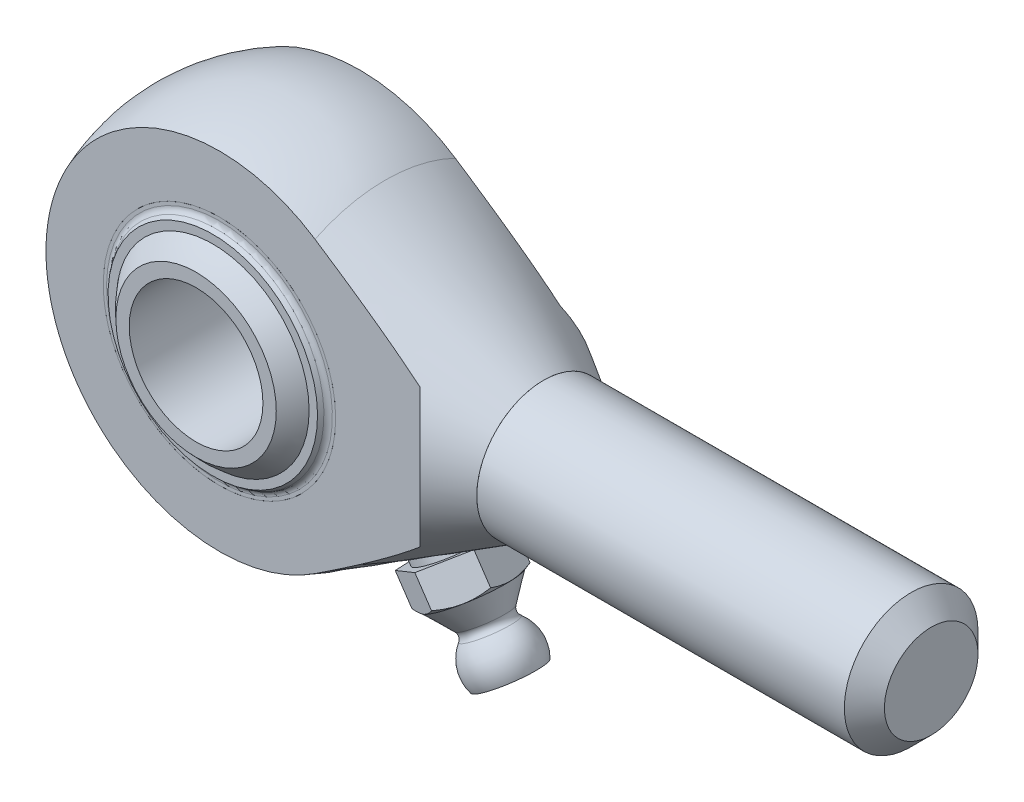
ISO-10303-21;
HEADER;
FILE_DESCRIPTION(('STEP AP214'),'2;1');
FILE_NAME('part.step','',(''),(''),'','','');
FILE_SCHEMA(('AUTOMOTIVE_DESIGN { 1 0 10303 214 1 1 1 1 }'));
ENDSEC;
DATA;
#1=APPLICATION_CONTEXT('core data for automotive mechanical design processes');
#2=APPLICATION_PROTOCOL_DEFINITION('international standard','automotive_design',2000,#1);
#3=PRODUCT_CONTEXT('',#1,'mechanical');
#4=PRODUCT('Part','Part','',(#3));
#5=PRODUCT_RELATED_PRODUCT_CATEGORY('part','',(#4));
#6=PRODUCT_DEFINITION_FORMATION('','',#4);
#7=PRODUCT_DEFINITION_CONTEXT('part definition',#1,'design');
#8=PRODUCT_DEFINITION('design','',#6,#7);
#9=PRODUCT_DEFINITION_SHAPE('','',#8);
#10=(LENGTH_UNIT() NAMED_UNIT(*) SI_UNIT(.MILLI.,.METRE.));
#11=(NAMED_UNIT(*) PLANE_ANGLE_UNIT() SI_UNIT($,.RADIAN.));
#12=(NAMED_UNIT(*) SI_UNIT($,.STERADIAN.) SOLID_ANGLE_UNIT());
#13=UNCERTAINTY_MEASURE_WITH_UNIT(LENGTH_MEASURE(1.E-05),#10,'distance_accuracy_value','');
#14=(GEOMETRIC_REPRESENTATION_CONTEXT(3) GLOBAL_UNCERTAINTY_ASSIGNED_CONTEXT((#13)) GLOBAL_UNIT_ASSIGNED_CONTEXT((#10,
#11,#12)) REPRESENTATION_CONTEXT('',''));
#15=CARTESIAN_POINT('',(0.,0.,0.));
#16=DIRECTION('',(0.,0.,1.));
#17=DIRECTION('',(1.,0.,0.));
#18=AXIS2_PLACEMENT_3D('',#15,#16,#17);
#19=CARTESIAN_POINT('',(-3.01252572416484,-9.27160082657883,1.37009577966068));
#20=DIRECTION('',(0.306009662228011,0.941800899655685,-0.139173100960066));
#21=DIRECTION('',(0.0430068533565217,0.132361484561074,0.99026806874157));
#22=AXIS2_PLACEMENT_3D('',#19,#20,#21);
#23=SPHERICAL_SURFACE('',#22,1.25);
#24=CARTESIAN_POINT('',(-2.63001364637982,-8.09434970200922,1.1961294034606));
#25=VERTEX_POINT('',#24);
#26=VERTEX_LOOP('',#25);
#27=FACE_BOUND('',#26,.T.);
#28=ADVANCED_FACE('P0_F12',(#27),#23,.T.);
#29=CLOSED_SHELL('',(#28));
#30=MANIFOLD_SOLID_BREP('P0_B1',#29);
#31=CARTESIAN_POINT('',(0.,9.74873802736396,1.37009577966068));
#32=DIRECTION('',(0.,-0.99026806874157,-0.139173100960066));
#33=DIRECTION('',(0.,-0.139173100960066,0.99026806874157));
#34=AXIS2_PLACEMENT_3D('',#31,#32,#33);
#35=SPHERICAL_SURFACE('',#34,1.25);
#36=CARTESIAN_POINT('',(0.,8.510902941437,1.1961294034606));
#37=VERTEX_POINT('',#36);
#38=VERTEX_LOOP('',#37);
#39=FACE_BOUND('',#38,.T.);
#40=ADVANCED_FACE('P1_F12',(#39),#35,.T.);
#41=CLOSED_SHELL('',(#40));
#42=MANIFOLD_SOLID_BREP('P1_B1',#41);
#43=CARTESIAN_POINT('',(3.0125257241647,-9.27160082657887,-1.37009577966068));
#44=DIRECTION('',(-0.306009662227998,0.94180089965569,0.139173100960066));
#45=DIRECTION('',(-0.0430068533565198,0.132361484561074,-0.99026806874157));
#46=AXIS2_PLACEMENT_3D('',#43,#44,#45);
#47=SPHERICAL_SURFACE('',#46,1.25);
#48=CARTESIAN_POINT('',(2.63001364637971,-8.09434970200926,-1.1961294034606));
#49=VERTEX_POINT('',#48);
#50=VERTEX_LOOP('',#49);
#51=FACE_BOUND('',#50,.T.);
#52=ADVANCED_FACE('P2_F12',(#51),#47,.T.);
#53=CLOSED_SHELL('',(#52));
#54=MANIFOLD_SOLID_BREP('P2_B1',#53);
#55=CARTESIAN_POINT('',(0.,0.,0.));
#56=DIRECTION('',(0.,0.,1.));
#57=DIRECTION('',(0.999027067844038,0.044101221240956,0.));
#58=AXIS2_PLACEMENT_3D('',#55,#56,#57);
#59=CYLINDRICAL_SURFACE('',#58,8.7);
#60=CARTESIAN_POINT('',(0.,0.,-5.25));
#61=DIRECTION('',(0.,0.,1.));
#62=DIRECTION('',(0.999027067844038,0.044101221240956,0.));
#63=AXIS2_PLACEMENT_3D('',#60,#61,#62);
#64=CIRCLE('',#63,8.7);
#65=CARTESIAN_POINT('',(8.69153549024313,0.383680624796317,-5.25));
#66=VERTEX_POINT('',#65);
#67=EDGE_CURVE('P3_E34',#66,#66,#64,.T.);
#68=ORIENTED_EDGE('',*,*,#67,.T.);
#69=EDGE_LOOP('',(#68));
#70=FACE_BOUND('',#69,.T.);
#71=CARTESIAN_POINT('',(0.,0.,-4.75));
#72=DIRECTION('',(0.,0.,1.));
#73=DIRECTION('',(0.999027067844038,0.044101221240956,0.));
#74=AXIS2_PLACEMENT_3D('',#71,#72,#73);
#75=CIRCLE('',#74,8.7);
#76=CARTESIAN_POINT('',(8.69153549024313,0.383680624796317,-4.75));
#77=VERTEX_POINT('',#76);
#78=EDGE_CURVE('P3_E43',#77,#77,#75,.T.);
#79=ORIENTED_EDGE('',*,*,#78,.F.);
#80=EDGE_LOOP('',(#79));
#81=FACE_BOUND('',#80,.T.);
#82=ADVANCED_FACE('P3_F14',(#70,#81),#59,.T.);
#83=CARTESIAN_POINT('',(-0.383680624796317,8.69153549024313,-5.25));
#84=DIRECTION('',(0.,0.,-1.));
#85=DIRECTION('',(-0.999027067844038,-0.044101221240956,0.));
#86=AXIS2_PLACEMENT_3D('',#83,#84,#85);
#87=PLANE('',#86);
#88=CARTESIAN_POINT('',(0.,0.,-5.25));
#89=DIRECTION('',(0.,0.,-1.));
#90=DIRECTION('',(-0.999027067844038,-0.044101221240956,0.));
#91=AXIS2_PLACEMENT_3D('',#88,#89,#90);
#92=CIRCLE('',#91,8.44846666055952);
#93=CARTESIAN_POINT('',(-8.44024687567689,-0.372587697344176,-5.25));
#94=VERTEX_POINT('',#93);
#95=EDGE_CURVE('P3_E21',#94,#94,#92,.F.);
#96=ORIENTED_EDGE('',*,*,#95,.T.);
#97=EDGE_LOOP('',(#96));
#98=FACE_BOUND('',#97,.T.);
#99=ORIENTED_EDGE('',*,*,#67,.F.);
#100=EDGE_LOOP('',(#99));
#101=FACE_BOUND('',#100,.T.);
#102=ADVANCED_FACE('P3_F50',(#98,#101),#87,.T.);
#103=CARTESIAN_POINT('',(0.,0.,0.));
#104=DIRECTION('',(0.,0.,1.));
#105=DIRECTION('',(-0.044101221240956,0.999027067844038,0.));
#106=AXIS2_PLACEMENT_3D('',#103,#104,#105);
#107=SPHERICAL_SURFACE('',#106,9.71954445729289);
#108=CARTESIAN_POINT('',(0.,0.,-5.46867630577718));
#109=DIRECTION('',(0.,0.,1.));
#110=DIRECTION('',(0.999027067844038,0.044101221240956,0.));
#111=AXIS2_PLACEMENT_3D('',#108,#109,#110);
#112=CIRCLE('',#111,8.03511816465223);
#113=CARTESIAN_POINT('',(-0.354358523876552,8.02730053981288,-5.46867630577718));
#114=VERTEX_POINT('',#113);
#115=EDGE_CURVE('P3_E10',#114,#114,#112,.F.);
#116=CARTESIAN_POINT('',(0.,0.,-5.75));
#117=DIRECTION('',(0.,0.,1.));
#118=DIRECTION('',(0.999027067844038,0.044101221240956,0.));
#119=AXIS2_PLACEMENT_3D('',#116,#117,#118);
#120=CIRCLE('',#119,7.8362647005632);
#121=CARTESIAN_POINT('',(-0.345588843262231,7.82864054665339,-5.75));
#122=VERTEX_POINT('',#121);
#123=EDGE_CURVE('P3_E37',#122,#122,#120,.T.);
#124=CARTESIAN_POINT('',(-0.354358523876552,8.02730053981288,-5.46867630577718));
#125=CARTESIAN_POINT('',(-0.354269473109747,8.02528326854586,-5.47164316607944));
#126=CARTESIAN_POINT('',(-0.354180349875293,8.0232643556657,-5.47460890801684));
#127=CARTESIAN_POINT('',(-0.35400195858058,8.01922324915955,-5.48053815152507));
#128=CARTESIAN_POINT('',(-0.353912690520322,8.01720105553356,-5.48350165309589));
#129=CARTESIAN_POINT('',(-0.353734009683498,8.01315339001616,-5.4894264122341));
#130=CARTESIAN_POINT('',(-0.353644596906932,8.01112791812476,-5.49238766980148));
#131=CARTESIAN_POINT('',(-0.353465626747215,8.00707369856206,-5.49830793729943));
#132=CARTESIAN_POINT('',(-0.353376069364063,8.00504495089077,-5.50126694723));
#133=CARTESIAN_POINT('',(-0.35319681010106,8.00098418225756,-5.50718271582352));
#134=CARTESIAN_POINT('',(-0.353107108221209,7.99895216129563,-5.51013947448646));
#135=CARTESIAN_POINT('',(-0.352927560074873,7.9948848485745,-5.51605073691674));
#136=CARTESIAN_POINT('',(-0.352837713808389,7.9928495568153,-5.51900524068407));
#137=CARTESIAN_POINT('',(-0.35265787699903,7.98877570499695,-5.52491198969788));
#138=CARTESIAN_POINT('',(-0.352567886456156,7.98673714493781,-5.52786423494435));
#139=CARTESIAN_POINT('',(-0.352387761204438,7.98265675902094,-5.53376646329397));
#140=CARTESIAN_POINT('',(-0.352297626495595,7.98061493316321,-5.53671644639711));
#141=CARTESIAN_POINT('',(-0.352117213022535,7.97652801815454,-5.54261414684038));
#142=CARTESIAN_POINT('',(-0.352026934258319,7.9744829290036,-5.54556186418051));
#143=CARTESIAN_POINT('',(-0.351846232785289,7.97038948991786,-5.55145502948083));
#144=CARTESIAN_POINT('',(-0.351755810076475,7.96834113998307,-5.55440047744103));
#145=CARTESIAN_POINT('',(-0.351574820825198,7.964241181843,-5.56028910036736));
#146=CARTESIAN_POINT('',(-0.351484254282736,7.96218957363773,-5.56323227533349));
#147=CARTESIAN_POINT('',(-0.351302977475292,7.95808310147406,-5.56911634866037));
#148=CARTESIAN_POINT('',(-0.351212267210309,7.95602823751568,-5.57205724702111));
#149=CARTESIAN_POINT('',(-0.351030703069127,7.95191525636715,-5.57793676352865));
#150=CARTESIAN_POINT('',(-0.350939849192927,7.94985713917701,-5.58087538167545));
#151=CARTESIAN_POINT('',(-0.35075799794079,7.94573765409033,-5.58675033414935));
#152=CARTESIAN_POINT('',(-0.350667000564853,7.9436762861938,-5.58968666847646));
#153=CARTESIAN_POINT('',(-0.350484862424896,7.93955030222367,-5.59555704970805));
#154=CARTESIAN_POINT('',(-0.350393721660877,7.93748568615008,-5.59849109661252));
#155=CARTESIAN_POINT('',(-0.350211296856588,7.93335320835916,-5.6043568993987));
#156=CARTESIAN_POINT('',(-0.350120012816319,7.93128534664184,-5.6072886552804));
#157=CARTESIAN_POINT('',(-0.349937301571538,7.92714638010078,-5.6131498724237));
#158=CARTESIAN_POINT('',(-0.349845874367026,7.92507527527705,-5.6160793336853));
#159=CARTESIAN_POINT('',(-0.349662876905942,7.92092982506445,-5.62193595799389));
#160=CARTESIAN_POINT('',(-0.34957130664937,7.91885547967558,-5.62486312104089));
#161=CARTESIAN_POINT('',(-0.349388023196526,7.91470355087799,-5.63071514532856));
#162=CARTESIAN_POINT('',(-0.349296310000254,7.91262596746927,-5.63364000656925));
#163=CARTESIAN_POINT('',(-0.349112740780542,7.90846756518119,-5.63948742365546));
#164=CARTESIAN_POINT('',(-0.349020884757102,7.90638674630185,-5.64240997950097));
#165=CARTESIAN_POINT('',(-0.348837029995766,7.90222187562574,-5.6482527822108));
#166=CARTESIAN_POINT('',(-0.348745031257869,7.90013782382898,-5.65117302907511));
#167=CARTESIAN_POINT('',(-0.348560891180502,7.89596648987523,-5.65701121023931));
#168=CARTESIAN_POINT('',(-0.348468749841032,7.89387920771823,-5.65992914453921));
#169=CARTESIAN_POINT('',(-0.348284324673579,7.88970141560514,-5.66576269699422));
#170=CARTESIAN_POINT('',(-0.348192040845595,7.88761090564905,-5.66867831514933));
#171=CARTESIAN_POINT('',(-0.348007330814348,7.88342666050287,-5.67450723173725));
#172=CARTESIAN_POINT('',(-0.347914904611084,7.88133292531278,-5.67742053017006));
#173=CARTESIAN_POINT('',(-0.347729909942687,7.87714223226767,-5.68324480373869));
#174=CARTESIAN_POINT('',(-0.347637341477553,7.87504527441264,-5.6861557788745));
#175=CARTESIAN_POINT('',(-0.347452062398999,7.87084813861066,-5.69197540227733));
#176=CARTESIAN_POINT('',(-0.347359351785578,7.8687479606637,-5.69488405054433));
#177=CARTESIAN_POINT('',(-0.347173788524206,7.86454438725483,-5.70069901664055));
#178=CARTESIAN_POINT('',(-0.347080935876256,7.86244099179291,-5.70360533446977));
#179=CARTESIAN_POINT('',(-0.346895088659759,7.85823098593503,-5.7094156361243));
#180=CARTESIAN_POINT('',(-0.346802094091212,7.85612437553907,-5.71231961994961));
#181=CARTESIAN_POINT('',(-0.346615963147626,7.85190794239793,-5.71812525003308));
#182=CARTESIAN_POINT('',(-0.346522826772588,7.84979811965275,-5.72102689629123));
#183=CARTESIAN_POINT('',(-0.346336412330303,7.84557526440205,-5.72682784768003));
#184=CARTESIAN_POINT('',(-0.346243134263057,7.84346223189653,-5.72972715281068));
#185=CARTESIAN_POINT('',(-0.3460564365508,7.83923295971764,-5.73552341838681));
#186=CARTESIAN_POINT('',(-0.345963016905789,7.83711672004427,-5.73842037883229));
#187=CARTESIAN_POINT('',(-0.345776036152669,7.83288103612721,-5.74421195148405));
#188=CARTESIAN_POINT('',(-0.345682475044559,7.83076159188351,-5.74710656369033));
#189=CARTESIAN_POINT('',(-0.345588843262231,7.82864054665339,-5.75));
#190=B_SPLINE_CURVE_WITH_KNOTS('',3,(#124,#125,#126,#127,#128,#129,#130,#131,#132,#133,#134,
#135,#136,#137,#138,#139,#140,#141,#142,#143,#144,#145,#146,#147,#148,#149,#150,#151,#152,#153,
#154,#155,#156,#157,#158,#159,#160,#161,#162,#163,#164,#165,#166,#167,#168,#169,#170,#171,#172,
#173,#174,#175,#176,#177,#178,#179,#180,#181,#182,#183,#184,#185,#186,#187,#188,#189),
.UNSPECIFIED.,.F.,.F.,(4,2,2,2,2,2,2,2,2,2,2,2,2,2,2,2,2,2,2,2,2,2,2,2,2,2,2,2,2,2,2,2,4),(0.,
0.0107664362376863,0.0215328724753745,0.0322993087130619,0.0430657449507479,0.0538321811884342,
0.0645986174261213,0.0753650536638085,0.0861314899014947,0.096897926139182,0.107664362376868,
0.118430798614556,0.129197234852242,0.139963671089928,0.150730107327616,0.161496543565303,
0.17226297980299,0.183029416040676,0.193795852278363,0.204562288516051,0.215328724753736,
0.226095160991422,0.236861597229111,0.247628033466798,0.258394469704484,0.269160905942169,
0.279927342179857,0.290693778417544,0.30146021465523,0.312226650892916,0.322993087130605,
0.333759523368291,0.344525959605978),.UNSPECIFIED.);
#191=EDGE_CURVE('P3_BSEAM57',#114,#122,#190,.T.);
#192=ORIENTED_EDGE('',*,*,#115,.T.);
#193=ORIENTED_EDGE('',*,*,#123,.T.);
#194=ORIENTED_EDGE('',*,*,#191,.T.);
#195=ORIENTED_EDGE('',*,*,#191,.F.);
#196=EDGE_LOOP('',(#192,#194,#193,#195));
#197=FACE_BOUND('',#196,.T.);
#198=ADVANCED_FACE('P3_F57',(#197),#107,.T.);
#199=CARTESIAN_POINT('',(-0.317827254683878,7.19975595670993,-5.75));
#200=DIRECTION('',(0.,0.,-1.));
#201=DIRECTION('',(-0.999027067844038,-0.044101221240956,0.));
#202=AXIS2_PLACEMENT_3D('',#199,#200,#201);
#203=PLANE('',#202);
#204=CARTESIAN_POINT('',(0.,0.,-5.75));
#205=DIRECTION('',(0.,0.,1.));
#206=DIRECTION('',(0.999027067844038,0.044101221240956,0.));
#207=AXIS2_PLACEMENT_3D('',#204,#205,#206);
#208=CIRCLE('',#207,7.20676765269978);
#209=CARTESIAN_POINT('',(-0.317827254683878,7.19975595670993,-5.75));
#210=VERTEX_POINT('',#209);
#211=EDGE_CURVE('P3_E40',#210,#210,#208,.T.);
#212=ORIENTED_EDGE('',*,*,#211,.T.);
#213=EDGE_LOOP('',(#212));
#214=FACE_BOUND('',#213,.T.);
#215=ORIENTED_EDGE('',*,*,#123,.F.);
#216=EDGE_LOOP('',(#215));
#217=FACE_BOUND('',#216,.T.);
#218=ADVANCED_FACE('P3_F77',(#214,#217),#203,.T.);
#219=CARTESIAN_POINT('',(0.,0.,0.));
#220=DIRECTION('',(0.,0.,1.));
#221=DIRECTION('',(-0.044101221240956,0.999027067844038,0.));
#222=AXIS2_PLACEMENT_3D('',#219,#220,#221);
#223=SPHERICAL_SURFACE('',#222,9.21954445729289);
#224=CARTESIAN_POINT('',(0.,0.,-4.97992561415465));
#225=DIRECTION('',(0.,0.,1.));
#226=DIRECTION('',(0.999027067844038,0.044101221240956,0.));
#227=AXIS2_PLACEMENT_3D('',#224,#225,#226);
#228=CIRCLE('',#227,7.75888786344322);
#229=CARTESIAN_POINT('',(-0.342176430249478,7.75133899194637,-4.97992561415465));
#230=VERTEX_POINT('',#229);
#231=EDGE_CURVE('P3_E29',#230,#230,#228,.T.);
#232=CARTESIAN_POINT('',(-0.342176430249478,7.75133899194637,-4.97992561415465));
#233=CARTESIAN_POINT('',(-0.341941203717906,7.74601039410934,-4.98823583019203));
#234=CARTESIAN_POINT('',(-0.341705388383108,7.74066845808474,-4.9965374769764));
#235=CARTESIAN_POINT('',(-0.341232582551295,7.72995796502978,-5.01312354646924));
#236=CARTESIAN_POINT('',(-0.340995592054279,7.72458940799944,-5.02140796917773));
#237=CARTESIAN_POINT('',(-0.34052043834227,7.71382572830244,-5.03795950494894));
#238=CARTESIAN_POINT('',(-0.340282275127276,7.70843060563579,-5.04622661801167));
#239=CARTESIAN_POINT('',(-0.339804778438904,7.69761385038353,-5.06274344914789));
#240=CARTESIAN_POINT('',(-0.339565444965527,7.69219221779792,-5.07099316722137));
#241=CARTESIAN_POINT('',(-0.339085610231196,7.68132249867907,-5.08747512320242));
#242=CARTESIAN_POINT('',(-0.338845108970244,7.67587441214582,-5.09570736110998));
#243=CARTESIAN_POINT('',(-0.33836294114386,7.66495184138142,-5.1121542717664));
#244=CARTESIAN_POINT('',(-0.338121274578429,7.65947735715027,-5.12036894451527));
#245=CARTESIAN_POINT('',(-0.337636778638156,7.64850204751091,-5.13678064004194));
#246=CARTESIAN_POINT('',(-0.337393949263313,7.6430012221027,-5.14497766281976));
#247=CARTESIAN_POINT('',(-0.336907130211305,7.63197328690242,-5.16135397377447));
#248=CARTESIAN_POINT('',(-0.336663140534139,7.62644617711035,-5.16953326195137));
#249=CARTESIAN_POINT('',(-0.336174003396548,7.61536573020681,-5.18587401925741));
#250=CARTESIAN_POINT('',(-0.335928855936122,7.60981239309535,-5.19403548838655));
#251=CARTESIAN_POINT('',(-0.335437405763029,7.59867954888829,-5.21034052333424));
#252=CARTESIAN_POINT('',(-0.335191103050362,7.5931000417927,-5.21848408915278));
#253=CARTESIAN_POINT('',(-0.33469734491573,7.58191491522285,-5.23475323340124));
#254=CARTESIAN_POINT('',(-0.334449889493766,7.57630929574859,-5.24287881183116));
#255=CARTESIAN_POINT('',(-0.333953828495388,7.56507200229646,-5.2591118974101));
#256=CARTESIAN_POINT('',(-0.333705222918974,7.55944032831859,-5.26721940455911));
#257=CARTESIAN_POINT('',(-0.333206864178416,7.5481509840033,-5.2834162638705));
#258=CARTESIAN_POINT('',(-0.332957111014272,7.54249331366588,-5.29150561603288));
#259=CARTESIAN_POINT('',(-0.332456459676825,7.53115203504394,-5.30766608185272));
#260=CARTESIAN_POINT('',(-0.332205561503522,7.52546842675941,-5.31573719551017));
#261=CARTESIAN_POINT('',(-0.331702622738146,7.51407533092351,-5.3318611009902));
#262=CARTESIAN_POINT('',(-0.331450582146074,7.50836584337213,-5.33991389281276));
#263=CARTESIAN_POINT('',(-0.330945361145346,7.49692104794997,-5.35600107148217));
#264=CARTESIAN_POINT('',(-0.33069218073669,7.49118574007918,-5.36403545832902));
#265=CARTESIAN_POINT('',(-0.33018468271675,7.4796893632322,-5.38008574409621));
#266=CARTESIAN_POINT('',(-0.329930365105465,7.47392829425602,-5.38810164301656));
#267=CARTESIAN_POINT('',(-0.32942059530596,7.46238045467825,-5.40411487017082));
#268=CARTESIAN_POINT('',(-0.329165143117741,7.45659368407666,-5.41211219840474));
#269=CARTESIAN_POINT('',(-0.328653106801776,7.44499450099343,-5.42808820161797));
#270=CARTESIAN_POINT('',(-0.328396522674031,7.43918208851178,-5.43606687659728));
#271=CARTESIAN_POINT('',(-0.32788222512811,7.42753168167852,-5.4520054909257));
#272=CARTESIAN_POINT('',(-0.327624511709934,7.4216936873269,-5.45996543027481));
#273=CARTESIAN_POINT('',(-0.327107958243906,7.40999217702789,-5.47586649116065));
#274=CARTESIAN_POINT('',(-0.326849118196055,7.4041286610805,-5.48380761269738));
#275=CARTESIAN_POINT('',(-0.326330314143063,7.39237616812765,-5.49967095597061));
#276=CARTESIAN_POINT('',(-0.326070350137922,7.38648719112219,-5.5075931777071));
#277=CARTESIAN_POINT('',(-0.325549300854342,7.37468383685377,-5.52341863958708));
#278=CARTESIAN_POINT('',(-0.325288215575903,7.36876945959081,-5.53132187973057));
#279=CARTESIAN_POINT('',(-0.324764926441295,7.35691536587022,-5.54710929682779));
#280=CARTESIAN_POINT('',(-0.324502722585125,7.35097564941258,-5.55499347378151));
#281=CARTESIAN_POINT('',(-0.32397719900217,7.33907093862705,-5.57074268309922));
#282=CARTESIAN_POINT('',(-0.323713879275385,7.33310594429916,-5.57860771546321));
#283=CARTESIAN_POINT('',(-0.323186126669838,7.32115073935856,-5.59431855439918));
#284=CARTESIAN_POINT('',(-0.322921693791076,7.31516052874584,-5.60216436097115));
#285=CARTESIAN_POINT('',(-0.322391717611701,7.30315495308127,-5.61783666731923));
#286=CARTESIAN_POINT('',(-0.322126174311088,7.29713958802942,-5.62566316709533));
#287=CARTESIAN_POINT('',(-0.321593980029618,7.28508376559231,-5.64129677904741));
#288=CARTESIAN_POINT('',(-0.32132732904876,7.27904330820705,-5.64910389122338));
#289=CARTESIAN_POINT('',(-0.320792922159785,7.26693736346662,-5.66469864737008));
#290=CARTESIAN_POINT('',(-0.320525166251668,7.26087187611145,-5.6724862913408));
#291=CARTESIAN_POINT('',(-0.319988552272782,7.24871593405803,-5.68804203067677));
#292=CARTESIAN_POINT('',(-0.319719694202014,7.24262547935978,-5.69581012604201));
#293=CARTESIAN_POINT('',(-0.319180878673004,7.23041966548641,-5.71132668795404));
#294=CARTESIAN_POINT('',(-0.318910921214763,7.22430430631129,-5.71907515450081));
#295=CARTESIAN_POINT('',(-0.318369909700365,7.21204874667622,-5.73455237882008));
#296=CARTESIAN_POINT('',(-0.31809885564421,7.20590854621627,-5.74228113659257));
#297=CARTESIAN_POINT('',(-0.317827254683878,7.19975595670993,-5.75));
#298=B_SPLINE_CURVE_WITH_KNOTS('',3,(#232,#233,#234,#235,#236,#237,#238,#239,#240,#241,#242,
#243,#244,#245,#246,#247,#248,#249,#250,#251,#252,#253,#254,#255,#256,#257,#258,#259,#260,#261,
#262,#263,#264,#265,#266,#267,#268,#269,#270,#271,#272,#273,#274,#275,#276,#277,#278,#279,#280,
#281,#282,#283,#284,#285,#286,#287,#288,#289,#290,#291,#292,#293,#294,#295,#296,#297),
.UNSPECIFIED.,.F.,.F.,(4,2,2,2,2,2,2,2,2,2,2,2,2,2,2,2,2,2,2,2,2,2,2,2,2,2,2,2,2,2,2,2,4),(0.,
0.0296239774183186,0.0592479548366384,0.088871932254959,0.118495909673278,0.148119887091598,
0.177743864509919,0.207367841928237,0.236991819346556,0.266615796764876,0.296239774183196,
0.325863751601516,0.355487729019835,0.385111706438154,0.414735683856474,0.444359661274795,
0.473983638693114,0.503607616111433,0.533231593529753,0.562855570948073,0.592479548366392,
0.622103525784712,0.651727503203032,0.681351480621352,0.71097545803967,0.740599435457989,
0.77022341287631,0.799847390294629,0.829471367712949,0.859095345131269,0.888719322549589,
0.918343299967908,0.947967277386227),.UNSPECIFIED.);
#299=EDGE_CURVE('P3_BSEAM68',#230,#210,#298,.T.);
#300=ORIENTED_EDGE('',*,*,#231,.T.);
#301=ORIENTED_EDGE('',*,*,#211,.F.);
#302=ORIENTED_EDGE('',*,*,#299,.T.);
#303=ORIENTED_EDGE('',*,*,#299,.F.);
#304=EDGE_LOOP('',(#300,#302,#301,#303));
#305=FACE_BOUND('',#304,.T.);
#306=ADVANCED_FACE('P3_F68',(#305),#223,.F.);
#307=CARTESIAN_POINT('',(-0.383680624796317,8.69153549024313,-4.75));
#308=DIRECTION('',(0.,0.,1.));
#309=DIRECTION('',(0.999027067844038,0.044101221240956,0.));
#310=AXIS2_PLACEMENT_3D('',#307,#308,#309);
#311=PLANE('',#310);
#312=CARTESIAN_POINT('',(0.,0.,-4.75));
#313=DIRECTION('',(0.,0.,1.));
#314=DIRECTION('',(0.999027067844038,0.044101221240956,0.));
#315=AXIS2_PLACEMENT_3D('',#312,#313,#314);
#316=CIRCLE('',#315,8.17967263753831);
#317=CARTESIAN_POINT('',(8.171714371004,0.360733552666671,-4.75));
#318=VERTEX_POINT('',#317);
#319=EDGE_CURVE('P3_E25',#318,#318,#316,.F.);
#320=ORIENTED_EDGE('',*,*,#319,.T.);
#321=EDGE_LOOP('',(#320));
#322=FACE_BOUND('',#321,.T.);
#323=ORIENTED_EDGE('',*,*,#78,.T.);
#324=EDGE_LOOP('',(#323));
#325=FACE_BOUND('',#324,.T.);
#326=ADVANCED_FACE('P3_F47',(#322,#325),#311,.T.);
#327=CARTESIAN_POINT('',(0.,0.,-5.25));
#328=DIRECTION('',(0.,0.,1.));
#329=DIRECTION('',(0.999027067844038,0.044101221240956,0.));
#330=AXIS2_PLACEMENT_3D('',#327,#328,#329);
#331=TOROIDAL_SURFACE('',#330,8.17967263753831,0.5);
#332=ORIENTED_EDGE('',*,*,#319,.F.);
#333=EDGE_LOOP('',(#332));
#334=FACE_BOUND('',#333,.T.);
#335=ORIENTED_EDGE('',*,*,#231,.F.);
#336=EDGE_LOOP('',(#335));
#337=FACE_BOUND('',#336,.T.);
#338=ADVANCED_FACE('P3_F60',(#334,#337),#331,.T.);
#339=CARTESIAN_POINT('',(0.,0.,-5.75));
#340=DIRECTION('',(0.,0.,-1.));
#341=DIRECTION('',(-0.999027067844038,-0.044101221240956,0.));
#342=AXIS2_PLACEMENT_3D('',#339,#340,#341);
#343=TOROIDAL_SURFACE('',#342,8.44846666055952,0.5);
#344=ORIENTED_EDGE('',*,*,#115,.F.);
#345=EDGE_LOOP('',(#344));
#346=FACE_BOUND('',#345,.T.);
#347=ORIENTED_EDGE('',*,*,#95,.F.);
#348=EDGE_LOOP('',(#347));
#349=FACE_BOUND('',#348,.T.);
#350=ADVANCED_FACE('P3_F16',(#346,#349),#343,.F.);
#351=CLOSED_SHELL('',(#82,#102,#198,#218,#306,#326,#338,#350));
#352=MANIFOLD_SOLID_BREP('P3_B1',#351);
#353=CARTESIAN_POINT('',(-5.73016444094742,-7.88689473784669,1.37009577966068));
#354=DIRECTION('',(0.582064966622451,0.801143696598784,-0.139173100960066));
#355=DIRECTION('',(0.0818038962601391,0.112593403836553,0.99026806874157));
#356=AXIS2_PLACEMENT_3D('',#353,#354,#355);
#357=SPHERICAL_SURFACE('',#356,1.25);
#358=CARTESIAN_POINT('',(-5.00258323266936,-6.88546511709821,1.1961294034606));
#359=VERTEX_POINT('',#358);
#360=VERTEX_LOOP('',#359);
#361=FACE_BOUND('',#360,.T.);
#362=ADVANCED_FACE('P4_F12',(#361),#357,.T.);
#363=CLOSED_SHELL('',(#362));
#364=MANIFOLD_SOLID_BREP('P4_B1',#363);
#365=CARTESIAN_POINT('',(3.01252572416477,9.27160082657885,1.37009577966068));
#366=DIRECTION('',(-0.306009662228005,-0.941800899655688,-0.139173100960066));
#367=DIRECTION('',(-0.0430068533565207,-0.132361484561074,0.99026806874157));
#368=AXIS2_PLACEMENT_3D('',#365,#366,#367);
#369=SPHERICAL_SURFACE('',#368,1.25);
#370=CARTESIAN_POINT('',(2.63001364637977,8.09434970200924,1.1961294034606));
#371=VERTEX_POINT('',#370);
#372=VERTEX_LOOP('',#371);
#373=FACE_BOUND('',#372,.T.);
#374=ADVANCED_FACE('P5_F12',(#373),#369,.T.);
#375=CLOSED_SHELL('',(#374));
#376=MANIFOLD_SOLID_BREP('P5_B1',#375);
#377=CARTESIAN_POINT('',(0.,-9.74873802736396,-1.37009577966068));
#378=DIRECTION('',(0.,0.99026806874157,0.139173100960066));
#379=DIRECTION('',(0.,0.139173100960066,-0.99026806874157));
#380=AXIS2_PLACEMENT_3D('',#377,#378,#379);
#381=SPHERICAL_SURFACE('',#380,1.25);
#382=CARTESIAN_POINT('',(0.,-8.510902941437,-1.1961294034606));
#383=VERTEX_POINT('',#382);
#384=VERTEX_LOOP('',#383);
#385=FACE_BOUND('',#384,.T.);
#386=ADVANCED_FACE('P6_F12',(#385),#381,.T.);
#387=CLOSED_SHELL('',(#386));
#388=MANIFOLD_SOLID_BREP('P6_B1',#387);
#389=CARTESIAN_POINT('',(-7.8868947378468,-5.73016444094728,1.37009577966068));
#390=DIRECTION('',(0.801143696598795,0.582064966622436,-0.139173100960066));
#391=DIRECTION('',(0.112593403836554,0.081803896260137,0.99026806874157));
#392=AXIS2_PLACEMENT_3D('',#389,#390,#391);
#393=SPHERICAL_SURFACE('',#392,1.25);
#394=CARTESIAN_POINT('',(-6.88546511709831,-5.00258323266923,1.1961294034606));
#395=VERTEX_POINT('',#394);
#396=VERTEX_LOOP('',#395);
#397=FACE_BOUND('',#396,.T.);
#398=ADVANCED_FACE('P7_F12',(#397),#393,.T.);
#399=CLOSED_SHELL('',(#398));
#400=MANIFOLD_SOLID_BREP('P7_B1',#399);
#401=CARTESIAN_POINT('',(5.73016444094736,7.88689473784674,1.37009577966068));
#402=DIRECTION('',(-0.582064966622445,-0.801143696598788,-0.139173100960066));
#403=DIRECTION('',(-0.0818038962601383,-0.112593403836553,0.99026806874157));
#404=AXIS2_PLACEMENT_3D('',#401,#402,#403);
#405=SPHERICAL_SURFACE('',#404,1.25);
#406=CARTESIAN_POINT('',(5.00258323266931,6.88546511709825,1.1961294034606));
#407=VERTEX_POINT('',#406);
#408=VERTEX_LOOP('',#407);
#409=FACE_BOUND('',#408,.T.);
#410=ADVANCED_FACE('P8_F12',(#409),#405,.T.);
#411=CLOSED_SHELL('',(#410));
#412=MANIFOLD_SOLID_BREP('P8_B1',#411);
#413=CARTESIAN_POINT('',(-3.01252572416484,-9.27160082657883,-1.37009577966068));
#414=DIRECTION('',(0.306009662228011,0.941800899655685,0.139173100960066));
#415=DIRECTION('',(0.0430068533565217,0.132361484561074,-0.99026806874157));
#416=AXIS2_PLACEMENT_3D('',#413,#414,#415);
#417=SPHERICAL_SURFACE('',#416,1.25);
#418=CARTESIAN_POINT('',(-2.63001364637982,-8.09434970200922,-1.1961294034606));
#419=VERTEX_POINT('',#418);
#420=VERTEX_LOOP('',#419);
#421=FACE_BOUND('',#420,.T.);
#422=ADVANCED_FACE('P9_F12',(#421),#417,.T.);
#423=CLOSED_SHELL('',(#422));
#424=MANIFOLD_SOLID_BREP('P9_B1',#423);
#425=CARTESIAN_POINT('',(0.,0.,0.));
#426=DIRECTION('',(0.,1.,0.));
#427=DIRECTION('',(1.,0.,0.));
#428=AXIS2_PLACEMENT_3D('',#425,#426,#427);
#429=SPHERICAL_SURFACE('',#428,9.21954445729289);
#430=CARTESIAN_POINT('',(0.,0.,0.));
#431=DIRECTION('',(0.,0.,1.));
#432=DIRECTION('',(1.,0.,0.));
#433=AXIS2_PLACEMENT_3D('',#430,#431,#432);
#434=SPHERICAL_SURFACE('',#433,9.21954445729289);
#435=CARTESIAN_POINT('',(0.,0.,2.31056326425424));
#436=DIRECTION('',(0.,0.,1.));
#437=DIRECTION('',(1.,0.,0.));
#438=AXIS2_PLACEMENT_3D('',#435,#436,#437);
#439=CIRCLE('',#438,8.92531777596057);
#440=CARTESIAN_POINT('',(8.92531777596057,0.,2.31056326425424));
#441=VERTEX_POINT('',#440);
#442=EDGE_CURVE('P10_E18',#441,#441,#439,.F.);
#443=ORIENTED_EDGE('',*,*,#442,.F.);
#444=EDGE_LOOP('',(#443));
#445=FACE_BOUND('',#444,.T.);
#446=CARTESIAN_POINT('',(0.,0.,7.));
#447=DIRECTION('',(0.,0.,-1.));
#448=DIRECTION('',(-1.,0.,0.));
#449=AXIS2_PLACEMENT_3D('',#446,#447,#448);
#450=CIRCLE('',#449,6.);
#451=CARTESIAN_POINT('',(-6.,0.,7.));
#452=VERTEX_POINT('',#451);
#453=EDGE_CURVE('P10_E27',#452,#452,#450,.F.);
#454=ORIENTED_EDGE('',*,*,#453,.F.);
#455=EDGE_LOOP('',(#454));
#456=FACE_BOUND('',#455,.T.);
#457=ADVANCED_FACE('P10_F14',(#445,#456),#434,.T.);
#458=CARTESIAN_POINT('',(0.,0.,0.));
#459=DIRECTION('',(0.,0.,-1.));
#460=DIRECTION('',(-1.,0.,0.));
#461=AXIS2_PLACEMENT_3D('',#458,#459,#460);
#462=SPHERICAL_SURFACE('',#461,9.21954445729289);
#463=CARTESIAN_POINT('',(0.,0.,-2.31056326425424));
#464=DIRECTION('',(0.,0.,-1.));
#465=DIRECTION('',(-1.,0.,0.));
#466=AXIS2_PLACEMENT_3D('',#463,#464,#465);
#467=CIRCLE('',#466,8.92531777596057);
#468=CARTESIAN_POINT('',(-8.92531777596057,0.,-2.31056326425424));
#469=VERTEX_POINT('',#468);
#470=EDGE_CURVE('P10_E34',#469,#469,#467,.F.);
#471=ORIENTED_EDGE('',*,*,#470,.F.);
#472=EDGE_LOOP('',(#471));
#473=FACE_BOUND('',#472,.T.);
#474=CARTESIAN_POINT('',(0.,0.,-7.));
#475=DIRECTION('',(0.,0.,1.));
#476=DIRECTION('',(1.,0.,0.));
#477=AXIS2_PLACEMENT_3D('',#474,#475,#476);
#478=CIRCLE('',#477,6.);
#479=CARTESIAN_POINT('',(6.,0.,-7.));
#480=VERTEX_POINT('',#479);
#481=EDGE_CURVE('P10_E10',#480,#480,#478,.F.);
#482=ORIENTED_EDGE('',*,*,#481,.F.);
#483=EDGE_LOOP('',(#482));
#484=FACE_BOUND('',#483,.T.);
#485=ADVANCED_FACE('P10_F50',(#473,#484),#462,.T.);
#486=CARTESIAN_POINT('',(0.,0.,0.));
#487=DIRECTION('',(0.,0.,-1.));
#488=DIRECTION('',(-1.,0.,0.));
#489=AXIS2_PLACEMENT_3D('',#486,#487,#488);
#490=SPHERICAL_SURFACE('',#489,9.21954445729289);
#491=CARTESIAN_POINT('',(0.,0.,0.239095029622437));
#492=DIRECTION('',(0.,0.,-1.));
#493=DIRECTION('',(-1.,0.,0.));
#494=AXIS2_PLACEMENT_3D('',#491,#492,#493);
#495=CIRCLE('',#494,9.21644365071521);
#496=CARTESIAN_POINT('',(-9.21644365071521,0.,0.239095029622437));
#497=VERTEX_POINT('',#496);
#498=EDGE_CURVE('P10_E39',#497,#497,#495,.F.);
#499=ORIENTED_EDGE('',*,*,#498,.F.);
#500=EDGE_LOOP('',(#499));
#501=FACE_BOUND('',#500,.T.);
#502=CARTESIAN_POINT('',(0.,0.,-0.239095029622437));
#503=DIRECTION('',(0.,0.,1.));
#504=DIRECTION('',(1.,0.,0.));
#505=AXIS2_PLACEMENT_3D('',#502,#503,#504);
#506=CIRCLE('',#505,9.21644365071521);
#507=CARTESIAN_POINT('',(9.21644365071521,0.,-0.239095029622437));
#508=VERTEX_POINT('',#507);
#509=EDGE_CURVE('P10_E35',#508,#508,#506,.F.);
#510=ORIENTED_EDGE('',*,*,#509,.F.);
#511=EDGE_LOOP('',(#510));
#512=FACE_BOUND('',#511,.T.);
#513=ADVANCED_FACE('P10_F16',(#501,#512),#490,.T.);
#514=CARTESIAN_POINT('',(0.,0.,-9.21954445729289));
#515=DIRECTION('',(0.,0.,1.));
#516=DIRECTION('',(1.,0.,0.));
#517=AXIS2_PLACEMENT_3D('',#514,#515,#516);
#518=CYLINDRICAL_SURFACE('',#517,5.);
#519=CARTESIAN_POINT('',(0.,0.,7.));
#520=DIRECTION('',(0.,0.,-1.));
#521=DIRECTION('',(-1.,0.,0.));
#522=AXIS2_PLACEMENT_3D('',#519,#520,#521);
#523=CIRCLE('',#522,5.);
#524=CARTESIAN_POINT('',(-5.,0.,7.));
#525=VERTEX_POINT('',#524);
#526=EDGE_CURVE('P10_E31',#525,#525,#523,.F.);
#527=ORIENTED_EDGE('',*,*,#526,.T.);
#528=EDGE_LOOP('',(#527));
#529=FACE_BOUND('',#528,.T.);
#530=CARTESIAN_POINT('',(0.,0.,-7.));
#531=DIRECTION('',(0.,0.,1.));
#532=DIRECTION('',(1.,0.,0.));
#533=AXIS2_PLACEMENT_3D('',#530,#531,#532);
#534=CIRCLE('',#533,5.);
#535=CARTESIAN_POINT('',(5.,0.,-7.));
#536=VERTEX_POINT('',#535);
#537=EDGE_CURVE('P10_E22',#536,#536,#534,.F.);
#538=ORIENTED_EDGE('',*,*,#537,.T.);
#539=EDGE_LOOP('',(#538));
#540=FACE_BOUND('',#539,.T.);
#541=ADVANCED_FACE('P10_F62',(#529,#540),#518,.F.);
#542=CARTESIAN_POINT('',(-9.21954445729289,-9.21954445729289,-7.));
#543=DIRECTION('',(0.,0.,1.));
#544=DIRECTION('',(1.,0.,0.));
#545=AXIS2_PLACEMENT_3D('',#542,#543,#544);
#546=PLANE('',#545);
#547=ORIENTED_EDGE('',*,*,#481,.T.);
#548=EDGE_LOOP('',(#547));
#549=FACE_BOUND('',#548,.T.);
#550=ORIENTED_EDGE('',*,*,#537,.F.);
#551=EDGE_LOOP('',(#550));
#552=FACE_BOUND('',#551,.T.);
#553=ADVANCED_FACE('P10_F58',(#549,#552),#546,.F.);
#554=CARTESIAN_POINT('',(-9.21954445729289,-9.21954445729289,7.));
#555=DIRECTION('',(0.,0.,-1.));
#556=DIRECTION('',(-1.,0.,0.));
#557=AXIS2_PLACEMENT_3D('',#554,#555,#556);
#558=PLANE('',#557);
#559=ORIENTED_EDGE('',*,*,#453,.T.);
#560=EDGE_LOOP('',(#559));
#561=FACE_BOUND('',#560,.T.);
#562=ORIENTED_EDGE('',*,*,#526,.F.);
#563=EDGE_LOOP('',(#562));
#564=FACE_BOUND('',#563,.T.);
#565=ADVANCED_FACE('P10_F54',(#561,#564),#558,.F.);
#566=CARTESIAN_POINT('',(0.,0.,-1.37009577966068));
#567=DIRECTION('',(0.,0.,-1.));
#568=DIRECTION('',(-1.,0.,0.));
#569=AXIS2_PLACEMENT_3D('',#566,#567,#568);
#570=TOROIDAL_SURFACE('',#569,9.74873802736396,1.25);
#571=ORIENTED_EDGE('',*,*,#470,.T.);
#572=EDGE_LOOP('',(#571));
#573=FACE_BOUND('',#572,.T.);
#574=ORIENTED_EDGE('',*,*,#509,.T.);
#575=EDGE_LOOP('',(#574));
#576=FACE_BOUND('',#575,.T.);
#577=ADVANCED_FACE('P10_F57',(#573,#576),#570,.F.);
#578=CARTESIAN_POINT('',(0.,0.,1.37009577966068));
#579=DIRECTION('',(0.,0.,-1.));
#580=DIRECTION('',(-1.,0.,0.));
#581=AXIS2_PLACEMENT_3D('',#578,#579,#580);
#582=TOROIDAL_SURFACE('',#581,9.74873802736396,1.25);
#583=ORIENTED_EDGE('',*,*,#442,.T.);
#584=EDGE_LOOP('',(#583));
#585=FACE_BOUND('',#584,.T.);
#586=ORIENTED_EDGE('',*,*,#498,.T.);
#587=EDGE_LOOP('',(#586));
#588=FACE_BOUND('',#587,.T.);
#589=ADVANCED_FACE('P10_F46',(#585,#588),#582,.F.);
#590=CLOSED_SHELL('',(#457,#485,#513,#541,#553,#565,#577,#589));
#591=MANIFOLD_SOLID_BREP('P10_B1',#590);
#592=CARTESIAN_POINT('',(-9.27160082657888,-3.01252572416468,1.37009577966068));
#593=DIRECTION('',(0.94180089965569,0.306009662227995,-0.139173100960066));
#594=DIRECTION('',(0.132361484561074,0.0430068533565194,0.99026806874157));
#595=AXIS2_PLACEMENT_3D('',#592,#593,#594);
#596=SPHERICAL_SURFACE('',#595,1.25);
#597=CARTESIAN_POINT('',(-8.09434970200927,-2.63001364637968,1.1961294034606));
#598=VERTEX_POINT('',#597);
#599=VERTEX_LOOP('',#598);
#600=FACE_BOUND('',#599,.T.);
#601=ADVANCED_FACE('P11_F12',(#600),#596,.T.);
#602=CLOSED_SHELL('',(#601));
#603=MANIFOLD_SOLID_BREP('P11_B1',#602);
#604=CARTESIAN_POINT('',(7.88689473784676,5.73016444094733,1.37009577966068));
#605=DIRECTION('',(-0.80114369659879,-0.582064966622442,-0.139173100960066));
#606=DIRECTION('',(-0.112593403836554,-0.0818038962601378,0.99026806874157));
#607=AXIS2_PLACEMENT_3D('',#604,#605,#606);
#608=SPHERICAL_SURFACE('',#607,1.25);
#609=CARTESIAN_POINT('',(6.88546511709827,5.00258323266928,1.1961294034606));
#610=VERTEX_POINT('',#609);
#611=VERTEX_LOOP('',#610);
#612=FACE_BOUND('',#611,.T.);
#613=ADVANCED_FACE('P12_F12',(#612),#608,.T.);
#614=CLOSED_SHELL('',(#613));
#615=MANIFOLD_SOLID_BREP('P12_B1',#614);
#616=CARTESIAN_POINT('',(-5.73016444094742,-7.88689473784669,-1.37009577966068));
#617=DIRECTION('',(0.582064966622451,0.801143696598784,0.139173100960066));
#618=DIRECTION('',(0.0818038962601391,0.112593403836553,-0.99026806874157));
#619=AXIS2_PLACEMENT_3D('',#616,#617,#618);
#620=SPHERICAL_SURFACE('',#619,1.25);
#621=CARTESIAN_POINT('',(-5.00258323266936,-6.88546511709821,-1.1961294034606));
#622=VERTEX_POINT('',#621);
#623=VERTEX_LOOP('',#622);
#624=FACE_BOUND('',#623,.T.);
#625=ADVANCED_FACE('P13_F12',(#624),#620,.T.);
#626=CLOSED_SHELL('',(#625));
#627=MANIFOLD_SOLID_BREP('P13_B1',#626);
#628=CARTESIAN_POINT('',(0.,9.74873802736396,-1.37009577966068));
#629=DIRECTION('',(0.,-0.99026806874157,0.139173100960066));
#630=DIRECTION('',(0.,-0.139173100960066,-0.99026806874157));
#631=AXIS2_PLACEMENT_3D('',#628,#629,#630);
#632=SPHERICAL_SURFACE('',#631,1.25);
#633=CARTESIAN_POINT('',(0.,8.510902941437,-1.1961294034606));
#634=VERTEX_POINT('',#633);
#635=VERTEX_LOOP('',#634);
#636=FACE_BOUND('',#635,.T.);
#637=ADVANCED_FACE('P14_F12',(#636),#632,.T.);
#638=CLOSED_SHELL('',(#637));
#639=MANIFOLD_SOLID_BREP('P14_B1',#638);
#640=CARTESIAN_POINT('',(-9.74873802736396,1.02112669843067E-13,1.37009577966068));
#641=DIRECTION('',(0.99026806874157,0.,-0.139173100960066));
#642=DIRECTION('',(0.139173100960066,0.,0.99026806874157));
#643=AXIS2_PLACEMENT_3D('',#640,#641,#642);
#644=SPHERICAL_SURFACE('',#643,1.25);
#645=CARTESIAN_POINT('',(-8.510902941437,0.,1.1961294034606));
#646=VERTEX_POINT('',#645);
#647=VERTEX_LOOP('',#646);
#648=FACE_BOUND('',#647,.T.);
#649=ADVANCED_FACE('P15_F12',(#648),#644,.T.);
#650=CLOSED_SHELL('',(#649));
#651=MANIFOLD_SOLID_BREP('P15_B1',#650);
#652=CARTESIAN_POINT('',(9.27160082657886,3.01252572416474,1.37009577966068));
#653=DIRECTION('',(-0.941800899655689,-0.306009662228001,-0.139173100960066));
#654=DIRECTION('',(-0.132361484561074,-0.0430068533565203,0.99026806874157));
#655=AXIS2_PLACEMENT_3D('',#652,#653,#654);
#656=SPHERICAL_SURFACE('',#655,1.25);
#657=CARTESIAN_POINT('',(8.09434970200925,2.63001364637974,1.1961294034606));
#658=VERTEX_POINT('',#657);
#659=VERTEX_LOOP('',#658);
#660=FACE_BOUND('',#659,.T.);
#661=ADVANCED_FACE('P16_F12',(#660),#656,.T.);
#662=CLOSED_SHELL('',(#661));
#663=MANIFOLD_SOLID_BREP('P16_B1',#662);
#664=CARTESIAN_POINT('',(-7.8868947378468,-5.73016444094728,-1.37009577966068));
#665=DIRECTION('',(0.801143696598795,0.582064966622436,0.139173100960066));
#666=DIRECTION('',(0.112593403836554,0.081803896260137,-0.99026806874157));
#667=AXIS2_PLACEMENT_3D('',#664,#665,#666);
#668=SPHERICAL_SURFACE('',#667,1.25);
#669=CARTESIAN_POINT('',(-6.88546511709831,-5.00258323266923,-1.1961294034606));
#670=VERTEX_POINT('',#669);
#671=VERTEX_LOOP('',#670);
#672=FACE_BOUND('',#671,.T.);
#673=ADVANCED_FACE('P17_F12',(#672),#668,.T.);
#674=CLOSED_SHELL('',(#673));
#675=MANIFOLD_SOLID_BREP('P17_B1',#674);
#676=CARTESIAN_POINT('',(3.01252572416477,9.27160082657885,-1.37009577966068));
#677=DIRECTION('',(-0.306009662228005,-0.941800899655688,0.139173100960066));
#678=DIRECTION('',(-0.0430068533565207,-0.132361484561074,-0.99026806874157));
#679=AXIS2_PLACEMENT_3D('',#676,#677,#678);
#680=SPHERICAL_SURFACE('',#679,1.25);
#681=CARTESIAN_POINT('',(2.63001364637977,8.09434970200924,-1.1961294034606));
#682=VERTEX_POINT('',#681);
#683=VERTEX_LOOP('',#682);
#684=FACE_BOUND('',#683,.T.);
#685=ADVANCED_FACE('P18_F12',(#684),#680,.T.);
#686=CLOSED_SHELL('',(#685));
#687=MANIFOLD_SOLID_BREP('P18_B1',#686);
#688=CARTESIAN_POINT('',(-9.27160082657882,3.01252572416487,1.37009577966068));
#689=DIRECTION('',(0.941800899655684,-0.306009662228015,-0.139173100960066));
#690=DIRECTION('',(0.132361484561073,-0.0430068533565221,0.99026806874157));
#691=AXIS2_PLACEMENT_3D('',#688,#689,#690);
#692=SPHERICAL_SURFACE('',#691,1.25);
#693=CARTESIAN_POINT('',(-8.09434970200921,2.63001364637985,1.1961294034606));
#694=VERTEX_POINT('',#693);
#695=VERTEX_LOOP('',#694);
#696=FACE_BOUND('',#695,.T.);
#697=ADVANCED_FACE('P19_F12',(#696),#692,.T.);
#698=CLOSED_SHELL('',(#697));
#699=MANIFOLD_SOLID_BREP('P19_B1',#698);
#700=CARTESIAN_POINT('',(9.74873802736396,0.,1.37009577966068));
#701=DIRECTION('',(-0.99026806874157,0.,-0.139173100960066));
#702=DIRECTION('',(-0.139173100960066,0.,0.99026806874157));
#703=AXIS2_PLACEMENT_3D('',#700,#701,#702);
#704=SPHERICAL_SURFACE('',#703,1.25);
#705=CARTESIAN_POINT('',(8.510902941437,0.,1.1961294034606));
#706=VERTEX_POINT('',#705);
#707=VERTEX_LOOP('',#706);
#708=FACE_BOUND('',#707,.T.);
#709=ADVANCED_FACE('P20_F12',(#708),#704,.T.);
#710=CLOSED_SHELL('',(#709));
#711=MANIFOLD_SOLID_BREP('P20_B1',#710);
#712=CARTESIAN_POINT('',(-9.27160082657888,-3.01252572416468,-1.37009577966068));
#713=DIRECTION('',(0.94180089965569,0.306009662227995,0.139173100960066));
#714=DIRECTION('',(0.132361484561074,0.0430068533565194,-0.99026806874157));
#715=AXIS2_PLACEMENT_3D('',#712,#713,#714);
#716=SPHERICAL_SURFACE('',#715,1.25);
#717=CARTESIAN_POINT('',(-8.09434970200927,-2.63001364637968,-1.1961294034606));
#718=VERTEX_POINT('',#717);
#719=VERTEX_LOOP('',#718);
#720=FACE_BOUND('',#719,.T.);
#721=ADVANCED_FACE('P21_F12',(#720),#716,.T.);
#722=CLOSED_SHELL('',(#721));
#723=MANIFOLD_SOLID_BREP('P21_B1',#722);
#724=CARTESIAN_POINT('',(5.73016444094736,7.88689473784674,-1.37009577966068));
#725=DIRECTION('',(-0.582064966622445,-0.801143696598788,0.139173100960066));
#726=DIRECTION('',(-0.0818038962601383,-0.112593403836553,-0.99026806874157));
#727=AXIS2_PLACEMENT_3D('',#724,#725,#726);
#728=SPHERICAL_SURFACE('',#727,1.25);
#729=CARTESIAN_POINT('',(5.00258323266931,6.88546511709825,-1.1961294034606));
#730=VERTEX_POINT('',#729);
#731=VERTEX_LOOP('',#730);
#732=FACE_BOUND('',#731,.T.);
#733=ADVANCED_FACE('P22_F12',(#732),#728,.T.);
#734=CLOSED_SHELL('',(#733));
#735=MANIFOLD_SOLID_BREP('P22_B1',#734);
#736=CARTESIAN_POINT('',(-7.88689473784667,5.73016444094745,1.37009577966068));
#737=DIRECTION('',(0.801143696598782,-0.582064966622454,-0.139173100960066));
#738=DIRECTION('',(0.112593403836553,-0.0818038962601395,0.99026806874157));
#739=AXIS2_PLACEMENT_3D('',#736,#737,#738);
#740=SPHERICAL_SURFACE('',#739,1.25);
#741=CARTESIAN_POINT('',(-6.8854651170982,5.00258323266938,1.1961294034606));
#742=VERTEX_POINT('',#741);
#743=VERTEX_LOOP('',#742);
#744=FACE_BOUND('',#743,.T.);
#745=ADVANCED_FACE('P23_F12',(#744),#740,.T.);
#746=CLOSED_SHELL('',(#745));
#747=MANIFOLD_SOLID_BREP('P23_B1',#746);
#748=CARTESIAN_POINT('',(9.27160082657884,-3.01252572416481,1.37009577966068));
#749=DIRECTION('',(-0.941800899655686,0.306009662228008,-0.139173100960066));
#750=DIRECTION('',(-0.132361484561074,0.0430068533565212,0.99026806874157));
#751=AXIS2_PLACEMENT_3D('',#748,#749,#750);
#752=SPHERICAL_SURFACE('',#751,1.25);
#753=CARTESIAN_POINT('',(8.09434970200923,-2.6300136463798,1.1961294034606));
#754=VERTEX_POINT('',#753);
#755=VERTEX_LOOP('',#754);
#756=FACE_BOUND('',#755,.T.);
#757=ADVANCED_FACE('P24_F12',(#756),#752,.T.);
#758=CLOSED_SHELL('',(#757));
#759=MANIFOLD_SOLID_BREP('P24_B1',#758);
#760=CARTESIAN_POINT('',(-9.74873802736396,1.02112669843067E-13,-1.37009577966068));
#761=DIRECTION('',(0.99026806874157,0.,0.139173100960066));
#762=DIRECTION('',(0.139173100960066,0.,-0.99026806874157));
#763=AXIS2_PLACEMENT_3D('',#760,#761,#762);
#764=SPHERICAL_SURFACE('',#763,1.25);
#765=CARTESIAN_POINT('',(-8.510902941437,0.,-1.1961294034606));
#766=VERTEX_POINT('',#765);
#767=VERTEX_LOOP('',#766);
#768=FACE_BOUND('',#767,.T.);
#769=ADVANCED_FACE('P25_F12',(#768),#764,.T.);
#770=CLOSED_SHELL('',(#769));
#771=MANIFOLD_SOLID_BREP('P25_B1',#770);
#772=CARTESIAN_POINT('',(7.88689473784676,5.73016444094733,-1.37009577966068));
#773=DIRECTION('',(-0.80114369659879,-0.582064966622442,0.139173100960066));
#774=DIRECTION('',(-0.112593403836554,-0.0818038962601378,-0.99026806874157));
#775=AXIS2_PLACEMENT_3D('',#772,#773,#774);
#776=SPHERICAL_SURFACE('',#775,1.25);
#777=CARTESIAN_POINT('',(6.88546511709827,5.00258323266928,-1.1961294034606));
#778=VERTEX_POINT('',#777);
#779=VERTEX_LOOP('',#778);
#780=FACE_BOUND('',#779,.T.);
#781=ADVANCED_FACE('P26_F12',(#780),#776,.T.);
#782=CLOSED_SHELL('',(#781));
#783=MANIFOLD_SOLID_BREP('P26_B1',#782);
#784=CARTESIAN_POINT('',(12.3185828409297,-9.18117121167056,0.));
#785=DIRECTION('',(-0.559192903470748,0.829037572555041,0.));
#786=DIRECTION('',(0.291751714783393,0.196789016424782,-0.936031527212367));
#787=AXIS2_PLACEMENT_3D('',#784,#785,#786);
#788=CYLINDRICAL_SURFACE('',#787,2.5);
#789=CARTESIAN_POINT('',(10.3614076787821,-6.27953970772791,0.));
#790=DIRECTION('',(0.559192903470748,-0.829037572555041,0.));
#791=DIRECTION('',(-0.291751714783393,-0.196789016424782,0.936031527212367));
#792=AXIS2_PLACEMENT_3D('',#789,#790,#791);
#793=CIRCLE('',#792,2.5);
#794=CARTESIAN_POINT('',(9.63202839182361,-6.77151224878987,2.34007881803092));
#795=VERTEX_POINT('',#794);
#796=EDGE_CURVE('P27_E207',#795,#795,#793,.T.);
#797=ORIENTED_EDGE('',*,*,#796,.T.);
#798=EDGE_LOOP('',(#797));
#799=FACE_BOUND('',#798,.T.);
#800=CARTESIAN_POINT('',(12.3185828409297,-9.18117121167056,0.));
#801=DIRECTION('',(0.559192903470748,-0.829037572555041,0.));
#802=DIRECTION('',(-0.291751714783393,-0.196789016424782,0.936031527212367));
#803=AXIS2_PLACEMENT_3D('',#800,#801,#802);
#804=CIRCLE('',#803,2.5);
#805=CARTESIAN_POINT('',(11.5892035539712,-9.67314375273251,2.34007881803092));
#806=VERTEX_POINT('',#805);
#807=EDGE_CURVE('P27_E337',#806,#806,#804,.T.);
#808=ORIENTED_EDGE('',*,*,#807,.F.);
#809=EDGE_LOOP('',(#808));
#810=FACE_BOUND('',#809,.T.);
#811=ADVANCED_FACE('P27_F16',(#799,#810),#788,.T.);
#812=CARTESIAN_POINT('',(10.0818112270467,-5.86502092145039,0.));
#813=DIRECTION('',(0.559192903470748,-0.829037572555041,0.));
#814=DIRECTION('',(-0.291751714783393,-0.196789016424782,0.936031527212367));
#815=AXIS2_PLACEMENT_3D('',#812,#813,#814);
#816=PLANE('',#815);
#817=CARTESIAN_POINT('',(10.0818112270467,-5.86502092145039,0.));
#818=DIRECTION('',(0.559192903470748,-0.829037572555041,0.));
#819=DIRECTION('',(-0.291751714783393,-0.196789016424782,0.936031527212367));
#820=AXIS2_PLACEMENT_3D('',#817,#818,#819);
#821=CIRCLE('',#820,2.);
#822=CARTESIAN_POINT('',(9.49830779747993,-6.25859895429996,1.87206305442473));
#823=VERTEX_POINT('',#822);
#824=EDGE_CURVE('P27_E205',#823,#823,#821,.F.);
#825=ORIENTED_EDGE('',*,*,#824,.T.);
#826=EDGE_LOOP('',(#825));
#827=FACE_BOUND('',#826,.T.);
#828=CARTESIAN_POINT('',(10.0818112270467,-5.86502092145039,0.));
#829=DIRECTION('',(0.559192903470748,-0.829037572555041,0.));
#830=DIRECTION('',(-0.291751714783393,-0.196789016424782,0.936031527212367));
#831=AXIS2_PLACEMENT_3D('',#828,#829,#830);
#832=CIRCLE('',#831,1.);
#833=CARTESIAN_POINT('',(9.79005951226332,-6.06180993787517,0.936031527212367));
#834=VERTEX_POINT('',#833);
#835=EDGE_CURVE('P27_E280',#834,#834,#832,.T.);
#836=ORIENTED_EDGE('',*,*,#835,.T.);
#837=EDGE_LOOP('',(#836));
#838=FACE_BOUND('',#837,.T.);
#839=ADVANCED_FACE('P27_F180',(#827,#838),#816,.F.);
#840=CARTESIAN_POINT('',(10.0992470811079,-10.6781320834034,2.19855792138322));
#841=DIRECTION('',(0.559192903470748,-0.829037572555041,0.));
#842=DIRECTION('',(-0.291751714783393,-0.196789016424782,0.936031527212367));
#843=AXIS2_PLACEMENT_3D('',#840,#841,#842);
#844=PLANE('',#843);
#845=DIRECTION('',(-0.776005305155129,-0.523422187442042,-0.351916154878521));
#846=VECTOR('',#845,1.);
#847=CARTESIAN_POINT('',(12.7874083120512,-8.86494443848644,3.41763124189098));
#848=LINE('',#847,#846);
#849=CARTESIAN_POINT('',(12.7874083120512,-8.86494443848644,3.41763124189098));
#850=VERTEX_POINT('',#849);
#851=CARTESIAN_POINT('',(10.0992470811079,-10.6781320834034,2.19855792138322));
#852=VERTEX_POINT('',#851);
#853=EDGE_CURVE('P27_E314',#850,#852,#848,.T.);
#854=ORIENTED_EDGE('',*,*,#853,.F.);
#855=DIRECTION('',(-0.640667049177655,-0.432135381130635,0.634669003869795));
#856=VECTOR('',#855,1.);
#857=CARTESIAN_POINT('',(15.0067440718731,-7.36798356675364,1.21907332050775));
#858=LINE('',#857,#856);
#859=CARTESIAN_POINT('',(15.0067440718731,-7.36798356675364,1.21907332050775));
#860=VERTEX_POINT('',#859);
#861=EDGE_CURVE('P27_E347',#860,#850,#858,.T.);
#862=ORIENTED_EDGE('',*,*,#861,.F.);
#863=DIRECTION('',(0.135338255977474,0.091286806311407,0.986585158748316));
#864=VECTOR('',#863,1.);
#865=CARTESIAN_POINT('',(14.5379186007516,-7.68421033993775,-2.19855792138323));
#866=LINE('',#865,#864);
#867=CARTESIAN_POINT('',(14.5379186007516,-7.68421033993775,-2.19855792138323));
#868=VERTEX_POINT('',#867);
#869=EDGE_CURVE('P27_E349',#868,#860,#866,.T.);
#870=ORIENTED_EDGE('',*,*,#869,.F.);
#871=DIRECTION('',(0.776005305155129,0.523422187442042,0.351916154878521));
#872=VECTOR('',#871,1.);
#873=CARTESIAN_POINT('',(11.8497573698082,-9.49739798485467,-3.41763124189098));
#874=LINE('',#873,#872);
#875=CARTESIAN_POINT('',(11.8497573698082,-9.49739798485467,-3.41763124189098));
#876=VERTEX_POINT('',#875);
#877=EDGE_CURVE('P27_E352',#876,#868,#874,.T.);
#878=ORIENTED_EDGE('',*,*,#877,.F.);
#879=DIRECTION('',(0.640667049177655,0.432135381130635,-0.634669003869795));
#880=VECTOR('',#879,1.);
#881=CARTESIAN_POINT('',(9.63042160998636,-10.9943588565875,-1.21907332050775));
#882=LINE('',#881,#880);
#883=CARTESIAN_POINT('',(9.63042160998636,-10.9943588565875,-1.21907332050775));
#884=VERTEX_POINT('',#883);
#885=EDGE_CURVE('P27_E354',#884,#876,#882,.T.);
#886=ORIENTED_EDGE('',*,*,#885,.F.);
#887=DIRECTION('',(-0.135338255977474,-0.091286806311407,-0.986585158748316));
#888=VECTOR('',#887,1.);
#889=CARTESIAN_POINT('',(10.0992470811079,-10.6781320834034,2.19855792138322));
#890=LINE('',#889,#888);
#891=EDGE_CURVE('P27_E355',#852,#884,#890,.T.);
#892=ORIENTED_EDGE('',*,*,#891,.F.);
#893=EDGE_LOOP('',(#854,#862,#870,#878,#886,#892));
#894=FACE_BOUND('',#893,.T.);
#895=ORIENTED_EDGE('',*,*,#807,.T.);
#896=EDGE_LOOP('',(#895));
#897=FACE_BOUND('',#896,.T.);
#898=ADVANCED_FACE('P27_F147',(#894,#897),#844,.F.);
#899=CARTESIAN_POINT('',(14.1853905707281,-10.937538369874,3.41763124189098));
#900=DIRECTION('',(0.291751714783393,0.196789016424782,-0.936031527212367));
#901=DIRECTION('',(0.559192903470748,-0.829037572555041,0.));
#902=AXIS2_PLACEMENT_3D('',#899,#900,#901);
#903=PLANE('',#902);
#904=DIRECTION('',(-0.559192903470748,0.829037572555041,0.));
#905=VECTOR('',#904,1.);
#906=CARTESIAN_POINT('',(11.4972293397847,-12.750726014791,2.19855792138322));
#907=LINE('',#906,#905);
#908=CARTESIAN_POINT('',(11.3473940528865,-12.5285860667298,2.19855792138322));
#909=VERTEX_POINT('',#908);
#910=EDGE_CURVE('P27_E300',#909,#852,#907,.T.);
#911=ORIENTED_EDGE('',*,*,#910,.F.);
#912=CARTESIAN_POINT('',(15.6453954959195,-8.17232740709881,4.45405155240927));
#913=CARTESIAN_POINT('',(15.5791993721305,-8.29389754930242,4.40786026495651));
#914=CARTESIAN_POINT('',(15.512433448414,-8.41512294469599,4.36156385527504));
#915=CARTESIAN_POINT('',(15.3774489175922,-8.65668588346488,4.26870490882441));
#916=CARTESIAN_POINT('',(15.3092300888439,-8.77702328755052,4.22214233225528));
#917=CARTESIAN_POINT('',(15.1706772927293,-9.01721499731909,4.12845947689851));
#918=CARTESIAN_POINT('',(15.1003339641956,-9.13706327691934,4.08133754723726));
#919=CARTESIAN_POINT('',(14.9574717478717,-9.37530312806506,3.98672184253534));
#920=CARTESIAN_POINT('',(14.8849529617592,-9.49369476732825,3.93922808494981));
#921=CARTESIAN_POINT('',(14.734812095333,-9.73242564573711,3.84224046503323));
#922=CARTESIAN_POINT('',(14.6571007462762,-9.85270298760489,3.79273179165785));
#923=CARTESIAN_POINT('',(14.4980601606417,-10.0906335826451,3.69313846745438));
#924=CARTESIAN_POINT('',(14.4167305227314,-10.208286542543,3.64305375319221));
#925=CARTESIAN_POINT('',(14.249724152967,-10.4398338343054,3.54231958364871));
#926=CARTESIAN_POINT('',(14.1640565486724,-10.5537352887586,3.49167147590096));
#927=CARTESIAN_POINT('',(13.9871920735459,-10.7767960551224,3.3896488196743));
#928=CARTESIAN_POINT('',(13.895996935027,-10.8859568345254,3.33827450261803));
#929=CARTESIAN_POINT('',(13.7074640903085,-11.0974337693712,3.23505028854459));
#930=CARTESIAN_POINT('',(13.6101631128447,-11.1997844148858,3.18320458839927));
#931=CARTESIAN_POINT('',(13.4080696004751,-11.3964881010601,3.0788595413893));
#932=CARTESIAN_POINT('',(13.3032778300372,-11.4908419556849,3.0263602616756));
#933=CARTESIAN_POINT('',(13.0872830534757,-11.6686264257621,2.92165985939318));
#934=CARTESIAN_POINT('',(12.9761837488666,-11.7521855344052,2.86946404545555));
#935=CARTESIAN_POINT('',(12.7467599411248,-11.9087228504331,2.76504489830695));
#936=CARTESIAN_POINT('',(12.6284352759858,-11.9817008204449,2.71282156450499));
#937=CARTESIAN_POINT('',(12.4223234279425,-12.0965662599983,2.62442951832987));
#938=CARTESIAN_POINT('',(12.3360842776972,-12.1411939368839,2.58816721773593));
#939=CARTESIAN_POINT('',(12.1611108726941,-12.2255073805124,2.51590389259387));
#940=CARTESIAN_POINT('',(12.0723762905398,-12.2651924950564,2.47990290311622));
#941=CARTESIAN_POINT('',(11.8030331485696,-12.3774852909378,2.37234315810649));
#942=CARTESIAN_POINT('',(11.6193745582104,-12.4432819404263,2.30126567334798));
#943=CARTESIAN_POINT('',(11.3381545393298,-12.5320491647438,2.19494998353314));
#944=CARTESIAN_POINT('',(11.2423530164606,-12.5602410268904,2.15916261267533));
#945=CARTESIAN_POINT('',(11.0497408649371,-12.6134750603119,2.08793552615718));
#946=CARTESIAN_POINT('',(10.9529302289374,-12.6385172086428,2.0524958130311));
#947=CARTESIAN_POINT('',(10.7585762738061,-12.6859154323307,1.98195273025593));
#948=CARTESIAN_POINT('',(10.6610331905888,-12.7082723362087,1.94684925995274));
#949=CARTESIAN_POINT('',(10.465355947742,-12.7507203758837,1.87693443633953));
#950=CARTESIAN_POINT('',(10.3672217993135,-12.7708115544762,1.84212307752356));
#951=CARTESIAN_POINT('',(10.111847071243,-12.820491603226,1.75208070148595));
#952=CARTESIAN_POINT('',(9.95424911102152,-12.8486015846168,1.69704921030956));
#953=CARTESIAN_POINT('',(9.6382428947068,-12.9010856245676,1.58751909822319));
#954=CARTESIAN_POINT('',(9.47983456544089,-12.9254593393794,1.53302052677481));
#955=CARTESIAN_POINT('',(9.16240658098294,-12.9713082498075,1.42444221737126));
#956=CARTESIAN_POINT('',(9.00338675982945,-12.9927825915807,1.3703626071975));
#957=CARTESIAN_POINT('',(8.68493376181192,-13.0334417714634,1.26255588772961));
#958=CARTESIAN_POINT('',(8.52550057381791,-13.0526265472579,1.20882878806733));
#959=CARTESIAN_POINT('',(8.04630728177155,-13.1075241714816,1.04792746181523));
#960=CARTESIAN_POINT('',(7.7260928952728,-13.1405197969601,0.941182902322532));
#961=CARTESIAN_POINT('',(7.08502682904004,-13.2017826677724,0.728489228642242));
#962=CARTESIAN_POINT('',(6.76417527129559,-13.2300507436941,0.622539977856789));
#963=CARTESIAN_POINT('',(6.15371594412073,-13.2806936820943,0.421618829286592));
#964=CARTESIAN_POINT('',(5.86415022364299,-13.3033748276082,0.326595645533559));
#965=CARTESIAN_POINT('',(5.28475000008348,-13.3467826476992,0.136876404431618));
#966=CARTESIAN_POINT('',(4.99491548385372,-13.3675092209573,0.0421803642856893));
#967=CARTESIAN_POINT('',(4.41594253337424,-13.4074288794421,-0.146672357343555));
#968=CARTESIAN_POINT('',(4.1268046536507,-13.4266264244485,-0.240829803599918));
#969=CARTESIAN_POINT('',(3.54841008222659,-13.4638694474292,-0.428939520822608));
#970=CARTESIAN_POINT('',(3.25915340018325,-13.4819150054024,-0.522891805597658));
#971=CARTESIAN_POINT('',(2.96984881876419,-13.4995418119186,-0.616770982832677));
#972=B_SPLINE_CURVE_WITH_KNOTS('',3,(#912,#913,#914,#915,#916,#917,#918,#919,#920,#921,#922,
#923,#924,#925,#926,#927,#928,#929,#930,#931,#932,#933,#934,#935,#936,#937,#938,#939,#940,#941,
#942,#943,#944,#945,#946,#947,#948,#949,#950,#951,#952,#953,#954,#955,#956,#957,#958,#959,#960,
#961,#962,#963,#964,#965,#966,#967,#968,#969,#970,#971),.UNSPECIFIED.,.F.,.F.,(4,2,2,2,2,2,2,2,
2,2,2,2,2,2,2,2,2,2,2,2,2,2,2,2,2,2,2,2,2,4),(0.,0.437788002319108,0.875643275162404,
1.31584036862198,1.75601691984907,2.2105101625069,2.66505394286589,3.11867812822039,
3.5721608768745,4.02313767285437,4.47406851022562,4.91900709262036,5.36395565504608,
5.67476198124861,5.98560927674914,6.6076280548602,6.92584727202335,7.24406880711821,
7.56219190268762,7.88030898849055,8.38808558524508,8.89590887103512,9.40388138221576,
9.91186771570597,10.9292445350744,11.946442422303,12.8632373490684,13.7800797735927,
14.6941418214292,15.608140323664),.UNSPECIFIED.);
#973=CARTESIAN_POINT('',(12.8413099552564,-11.8441321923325,2.8080945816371));
#974=VERTEX_POINT('',#973);
#975=EDGE_CURVE('P27_E119',#909,#974,#972,.F.);
#976=ORIENTED_EDGE('',*,*,#975,.T.);
#977=CARTESIAN_POINT('',(14.0355552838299,-10.7153984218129,3.41763124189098));
#978=VERTEX_POINT('',#977);
#979=EDGE_CURVE('P27_E127',#974,#978,#972,.F.);
#980=ORIENTED_EDGE('',*,*,#979,.T.);
#981=DIRECTION('',(-0.559192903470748,0.829037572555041,0.));
#982=VECTOR('',#981,1.);
#983=CARTESIAN_POINT('',(14.1853905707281,-10.937538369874,3.41763124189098));
#984=LINE('',#983,#982);
#985=EDGE_CURVE('P27_E292',#978,#850,#984,.T.);
#986=ORIENTED_EDGE('',*,*,#985,.T.);
#987=ORIENTED_EDGE('',*,*,#853,.T.);
#988=EDGE_LOOP('',(#911,#976,#980,#986,#987));
#989=FACE_BOUND('',#988,.T.);
#990=ADVANCED_FACE('P27_F298',(#989),#903,.F.);
#991=CARTESIAN_POINT('',(11.4972293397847,-12.750726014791,2.19855792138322));
#992=DIRECTION('',(0.817916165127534,0.551691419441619,-0.163247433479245));
#993=DIRECTION('',(0.135338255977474,0.091286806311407,0.986585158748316));
#994=AXIS2_PLACEMENT_3D('',#991,#992,#993);
#995=PLANE('',#994);
#996=DIRECTION('',(-0.559192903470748,0.829037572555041,0.));
#997=VECTOR('',#996,1.);
#998=CARTESIAN_POINT('',(11.0284038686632,-13.0669527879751,-1.21907332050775));
#999=LINE('',#998,#997);
#1000=CARTESIAN_POINT('',(10.878568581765,-12.8448128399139,-1.21907332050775));
#1001=VERTEX_POINT('',#1000);
#1002=EDGE_CURVE('P27_E308',#1001,#884,#999,.T.);
#1003=ORIENTED_EDGE('',*,*,#1002,.F.);
#1004=CARTESIAN_POINT('',(10.8785000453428,-12.8447786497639,-1.21930116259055));
#1005=CARTESIAN_POINT('',(10.9236859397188,-12.867328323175,-1.06911312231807));
#1006=CARTESIAN_POINT('',(10.9668240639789,-12.8864584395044,-0.917628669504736));
#1007=CARTESIAN_POINT('',(11.0477705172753,-12.9160407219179,-0.612036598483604));
#1008=CARTESIAN_POINT('',(11.0855657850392,-12.9264719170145,-0.457923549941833));
#1009=CARTESIAN_POINT('',(11.1535108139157,-12.9365645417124,-0.151607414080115));
#1010=CARTESIAN_POINT('',(11.1838266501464,-12.9364861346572,0.000548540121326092));
#1011=CARTESIAN_POINT('',(11.236943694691,-12.9249765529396,0.305576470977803));
#1012=CARTESIAN_POINT('',(11.2597540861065,-12.9135593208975,0.458447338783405));
#1013=CARTESIAN_POINT('',(11.2951140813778,-12.8814569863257,0.744100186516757));
#1014=CARTESIAN_POINT('',(11.3086088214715,-12.8621604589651,0.876924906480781));
#1015=CARTESIAN_POINT('',(11.3299523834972,-12.8154530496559,1.14170898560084));
#1016=CARTESIAN_POINT('',(11.3377959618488,-12.7880346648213,1.27366742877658));
#1017=CARTESIAN_POINT('',(11.3485483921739,-12.7254636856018,1.53899753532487));
#1018=CARTESIAN_POINT('',(11.3513439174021,-12.6901530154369,1.67233561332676));
#1019=CARTESIAN_POINT('',(11.3524843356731,-12.6135218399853,1.93702295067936));
#1020=CARTESIAN_POINT('',(11.3508379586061,-12.5722132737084,2.06837560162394));
#1021=CARTESIAN_POINT('',(11.3473880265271,-12.52850971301,2.19878576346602));
#1022=B_SPLINE_CURVE_WITH_KNOTS('',3,(#1004,#1005,#1006,#1007,#1008,#1009,#1010,#1011,#1012,
#1013,#1014,#1015,#1016,#1017,#1018,#1019,#1020,#1021),.UNSPECIFIED.,.F.,.F.,(4,2,2,2,2,2,2,2,
4),(0.,0.47553983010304,0.952222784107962,1.41710776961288,1.88142182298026,2.28572436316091,
2.69040156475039,3.10405572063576,3.5168974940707),.UNSPECIFIED.);
#1023=CARTESIAN_POINT('',(11.262816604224,-12.908839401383,0.489742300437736));
#1024=VERTEX_POINT('',#1023);
#1025=EDGE_CURVE('P27_E105',#1001,#1024,#1022,.T.);
#1026=ORIENTED_EDGE('',*,*,#1025,.T.);
#1027=EDGE_CURVE('P27_E116',#1024,#909,#1022,.T.);
#1028=ORIENTED_EDGE('',*,*,#1027,.T.);
#1029=ORIENTED_EDGE('',*,*,#910,.T.);
#1030=ORIENTED_EDGE('',*,*,#891,.T.);
#1031=EDGE_LOOP('',(#1003,#1026,#1028,#1029,#1030));
#1032=FACE_BOUND('',#1031,.T.);
#1033=ADVANCED_FACE('P27_F305',(#1032),#995,.F.);
#1034=CARTESIAN_POINT('',(11.0284038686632,-13.0669527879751,-1.21907332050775));
#1035=DIRECTION('',(0.52616445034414,0.354902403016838,0.772784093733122));
#1036=DIRECTION('',(-0.640667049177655,-0.432135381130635,0.634669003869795));
#1037=AXIS2_PLACEMENT_3D('',#1034,#1035,#1036);
#1038=PLANE('',#1037);
#1039=DIRECTION('',(-0.559192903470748,0.829037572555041,0.));
#1040=VECTOR('',#1039,1.);
#1041=CARTESIAN_POINT('',(13.2477396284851,-11.5699919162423,-3.41763124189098));
#1042=LINE('',#1041,#1040);
#1043=CARTESIAN_POINT('',(13.0979043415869,-11.3478519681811,-3.41763124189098));
#1044=VERTEX_POINT('',#1043);
#1045=EDGE_CURVE('P27_E341',#1044,#876,#1042,.T.);
#1046=ORIENTED_EDGE('',*,*,#1045,.F.);
#1047=CARTESIAN_POINT('',(13.0980150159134,-11.3476968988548,-3.41777781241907));
#1048=CARTESIAN_POINT('',(13.0250694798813,-11.4499272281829,-3.32116203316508));
#1049=CARTESIAN_POINT('',(12.9490564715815,-11.5494257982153,-3.22371227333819));
#1050=CARTESIAN_POINT('',(12.7896373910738,-11.7411366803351,-3.0271252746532));
#1051=CARTESIAN_POINT('',(12.7062139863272,-11.8333309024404,-2.92798454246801));
#1052=CARTESIAN_POINT('',(12.5332239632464,-12.0059362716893,-2.73093175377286));
#1053=CARTESIAN_POINT('',(12.4438604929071,-12.0865825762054,-2.63305001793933));
#1054=CARTESIAN_POINT('',(12.257055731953,-12.2369022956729,-2.43682592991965));
#1055=CARTESIAN_POINT('',(12.1596244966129,-12.3065890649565,-2.33848429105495));
#1056=CARTESIAN_POINT('',(11.9703022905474,-12.4260367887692,-2.15472416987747));
#1057=CARTESIAN_POINT('',(11.8793228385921,-12.4772089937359,-2.06927819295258));
#1058=CARTESIAN_POINT('',(11.6923986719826,-12.5709799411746,-1.89894292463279));
#1059=CARTESIAN_POINT('',(11.5964494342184,-12.6135706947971,-1.81405422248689));
#1060=CARTESIAN_POINT('',(11.3985046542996,-12.6917677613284,-1.64336769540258));
#1061=CARTESIAN_POINT('',(11.2964222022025,-12.7271981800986,-1.5575914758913));
#1062=CARTESIAN_POINT('',(11.0893709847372,-12.7909940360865,-1.38731844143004));
#1063=CARTESIAN_POINT('',(10.9844082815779,-12.8193732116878,-1.30281944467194));
#1064=CARTESIAN_POINT('',(10.8783833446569,-12.8448573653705,-1.21892674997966));
#1065=B_SPLINE_CURVE_WITH_KNOTS('',3,(#1047,#1048,#1049,#1050,#1051,#1052,#1053,#1054,#1055,
#1056,#1057,#1058,#1059,#1060,#1061,#1062,#1063,#1064),.UNSPECIFIED.,.F.,.F.,(4,2,2,2,2,2,2,2,
4),(0.,0.475539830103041,0.952222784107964,1.41710776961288,1.88142182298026,2.28572436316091,
2.69040156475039,3.10405572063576,3.5168974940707),.UNSPECIFIED.);
#1066=CARTESIAN_POINT('',(12.1380717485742,-12.3184723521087,-2.31835228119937));
#1067=VERTEX_POINT('',#1066);
#1068=EDGE_CURVE('P27_E100',#1044,#1067,#1065,.T.);
#1069=ORIENTED_EDGE('',*,*,#1068,.T.);
#1070=EDGE_CURVE('P27_E104',#1067,#1001,#1065,.T.);
#1071=ORIENTED_EDGE('',*,*,#1070,.T.);
#1072=ORIENTED_EDGE('',*,*,#1002,.T.);
#1073=ORIENTED_EDGE('',*,*,#885,.T.);
#1074=EDGE_LOOP('',(#1046,#1069,#1071,#1072,#1073));
#1075=FACE_BOUND('',#1074,.T.);
#1076=ADVANCED_FACE('P27_F312',(#1075),#1038,.F.);
#1077=CARTESIAN_POINT('',(13.2477396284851,-11.5699919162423,-3.41763124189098));
#1078=DIRECTION('',(-0.291751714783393,-0.196789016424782,0.936031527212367));
#1079=DIRECTION('',(-0.776005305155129,-0.523422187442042,-0.351916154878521));
#1080=AXIS2_PLACEMENT_3D('',#1077,#1078,#1079);
#1081=PLANE('',#1080);
#1082=DIRECTION('',(-0.559192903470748,0.829037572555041,0.));
#1083=VECTOR('',#1082,1.);
#1084=CARTESIAN_POINT('',(15.9359008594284,-9.75680427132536,-2.19855792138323));
#1085=LINE('',#1084,#1083);
#1086=CARTESIAN_POINT('',(15.7860655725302,-9.53466432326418,-2.19855792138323));
#1087=VERTEX_POINT('',#1086);
#1088=EDGE_CURVE('P27_E115',#1087,#868,#1085,.T.);
#1089=ORIENTED_EDGE('',*,*,#1088,.F.);
#1090=CARTESIAN_POINT('',(17.395905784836,-6.99159330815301,-1.16213761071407));
#1091=CARTESIAN_POINT('',(17.3297096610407,-7.11316345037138,-1.2083288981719));
#1092=CARTESIAN_POINT('',(17.2629437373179,-7.23438884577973,-1.25462530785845));
#1093=CARTESIAN_POINT('',(17.1279592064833,-7.47595178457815,-1.34748425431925));
#1094=CARTESIAN_POINT('',(17.0597403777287,-7.59628918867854,-1.39404683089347));
#1095=CARTESIAN_POINT('',(16.9211875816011,-7.83648089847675,-1.48772968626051));
#1096=CARTESIAN_POINT('',(16.8508442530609,-7.95632917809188,-1.53485161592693));
#1097=CARTESIAN_POINT('',(16.7079820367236,-8.19456902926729,-1.62946732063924));
#1098=CARTESIAN_POINT('',(16.6354632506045,-8.31296066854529,-1.67696107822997));
#1099=CARTESIAN_POINT('',(16.4853223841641,-8.55169154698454,-1.77394869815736));
#1100=CARTESIAN_POINT('',(16.4076110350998,-8.67196888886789,-1.82345737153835));
#1101=CARTESIAN_POINT('',(16.24857044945,-8.90989948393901,-1.92305069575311));
#1102=CARTESIAN_POINT('',(16.1672408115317,-9.0275524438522,-1.97313541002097));
#1103=CARTESIAN_POINT('',(16.0002344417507,-9.25909973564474,-2.07386957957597));
#1104=CARTESIAN_POINT('',(15.9145668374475,-9.37300119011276,-2.12451768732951));
#1105=CARTESIAN_POINT('',(15.7377023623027,-9.59606195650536,-2.22654034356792));
#1106=CARTESIAN_POINT('',(15.6465072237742,-9.70522273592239,-2.27791466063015));
#1107=CARTESIAN_POINT('',(15.4579743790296,-9.91669967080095,-2.38113887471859));
#1108=CARTESIAN_POINT('',(15.3606734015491,-10.0190503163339,-2.43298457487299));
#1109=CARTESIAN_POINT('',(15.1585798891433,-10.2157540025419,-2.53732962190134));
#1110=CARTESIAN_POINT('',(15.053788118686,-10.3101078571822,-2.58982890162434));
#1111=CARTESIAN_POINT('',(14.8377933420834,-10.4878923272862,-2.6945293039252));
#1112=CARTESIAN_POINT('',(14.7266940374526,-10.5714514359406,-2.74672511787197));
#1113=CARTESIAN_POINT('',(14.4972702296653,-10.7279887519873,-2.85114426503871));
#1114=CARTESIAN_POINT('',(14.3789455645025,-10.8009667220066,-2.90336759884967));
#1115=CARTESIAN_POINT('',(14.1728337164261,-10.9158321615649,-2.99175964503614));
#1116=CARTESIAN_POINT('',(14.0865945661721,-10.9604598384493,-3.02802194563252));
#1117=CARTESIAN_POINT('',(13.9116211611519,-11.0447732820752,-3.10028527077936));
#1118=CARTESIAN_POINT('',(13.8228865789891,-11.0844583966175,-3.13628626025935));
#1119=CARTESIAN_POINT('',(13.5535434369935,-11.196751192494,-3.24384600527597));
#1120=CARTESIAN_POINT('',(13.3698848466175,-11.2625478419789,-3.31492349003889));
#1121=CARTESIAN_POINT('',(13.0886648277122,-11.351315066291,-3.42123917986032));
#1122=CARTESIAN_POINT('',(12.9928633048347,-11.3795069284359,-3.45702655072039));
#1123=CARTESIAN_POINT('',(12.8002511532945,-11.4327409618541,-3.528253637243));
#1124=CARTESIAN_POINT('',(12.7034405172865,-11.4577831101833,-3.5636933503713));
#1125=CARTESIAN_POINT('',(12.509086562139,-11.5051813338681,-3.63423643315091));
#1126=CARTESIAN_POINT('',(12.4115434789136,-11.5275382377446,-3.6693399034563));
#1127=CARTESIAN_POINT('',(12.2158662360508,-11.5699862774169,-3.73925472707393));
#1128=CARTESIAN_POINT('',(12.1177320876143,-11.590077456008,-3.7740660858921));
#1129=CARTESIAN_POINT('',(11.8623573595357,-11.6397575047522,-3.86410846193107));
#1130=CARTESIAN_POINT('',(11.7047593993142,-11.6678674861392,-3.91913995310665));
#1131=CARTESIAN_POINT('',(11.3887531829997,-11.7203515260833,-4.02867006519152));
#1132=CARTESIAN_POINT('',(11.2303448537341,-11.7447252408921,-4.0831686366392));
#1133=CARTESIAN_POINT('',(10.9129168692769,-11.7905741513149,-4.19174694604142));
#1134=CARTESIAN_POINT('',(10.7538970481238,-11.8120484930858,-4.24582655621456));
#1135=CARTESIAN_POINT('',(10.4354440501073,-11.8527076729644,-4.35363327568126));
#1136=CARTESIAN_POINT('',(10.2760108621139,-11.8718924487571,-4.40736037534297));
#1137=CARTESIAN_POINT('',(9.79681757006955,-11.9267900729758,-4.56826170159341));
#1138=CARTESIAN_POINT('',(9.47660318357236,-11.9597856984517,-4.67500626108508));
#1139=CARTESIAN_POINT('',(8.83553711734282,-12.0210485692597,-4.88769993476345));
#1140=CARTESIAN_POINT('',(8.51468555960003,-12.0493166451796,-4.99364918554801));
#1141=CARTESIAN_POINT('',(7.90422623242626,-12.0999595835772,-5.1945703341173));
#1142=CARTESIAN_POINT('',(7.61466051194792,-12.1226407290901,-5.28959351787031));
#1143=CARTESIAN_POINT('',(7.03526028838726,-12.1660485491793,-5.47931275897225));
#1144=CARTESIAN_POINT('',(6.74542577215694,-12.1867751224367,-5.5740087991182));
#1145=CARTESIAN_POINT('',(6.16645282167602,-12.2266947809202,-5.76286152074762));
#1146=CARTESIAN_POINT('',(5.87731494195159,-12.2458923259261,-5.85701896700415));
#1147=CARTESIAN_POINT('',(5.29892037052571,-12.2831353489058,-6.04512868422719));
#1148=CARTESIAN_POINT('',(5.00966368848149,-12.3011809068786,-6.13908096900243));
#1149=CARTESIAN_POINT('',(4.72035910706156,-12.3188077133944,-6.23296014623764));
#1150=B_SPLINE_CURVE_WITH_KNOTS('',3,(#1090,#1091,#1092,#1093,#1094,#1095,#1096,#1097,#1098,
#1099,#1100,#1101,#1102,#1103,#1104,#1105,#1106,#1107,#1108,#1109,#1110,#1111,#1112,#1113,#1114,
#1115,#1116,#1117,#1118,#1119,#1120,#1121,#1122,#1123,#1124,#1125,#1126,#1127,#1128,#1129,#1130,
#1131,#1132,#1133,#1134,#1135,#1136,#1137,#1138,#1139,#1140,#1141,#1142,#1143,#1144,#1145,#1146,
#1147,#1148,#1149),.UNSPECIFIED.,.F.,.F.,(4,2,2,2,2,2,2,2,2,2,2,2,2,2,2,2,2,2,2,2,2,2,2,2,2,2,2,
2,2,4),(0.,0.437788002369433,0.875643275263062,1.31584036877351,1.75601692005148,
2.21051016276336,2.66505394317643,3.11867812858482,3.57216087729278,4.02313767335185,
4.47406851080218,4.91900709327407,5.36395565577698,5.6747619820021,5.98560927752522,
6.60762805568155,6.9258472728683,7.24406880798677,7.56219190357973,7.88030898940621,
8.38808558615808,8.89590887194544,9.40388138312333,9.91186771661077,10.9292445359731,
11.9464424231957,12.8632373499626,13.7800797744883,14.6941418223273,15.6081403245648),.UNSPECIFIED.);
#1151=CARTESIAN_POINT('',(14.5918202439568,-10.6633980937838,-2.8080945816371));
#1152=VERTEX_POINT('',#1151);
#1153=EDGE_CURVE('P27_E107',#1087,#1152,#1150,.T.);
#1154=ORIENTED_EDGE('',*,*,#1153,.T.);
#1155=EDGE_CURVE('P27_E98',#1152,#1044,#1150,.T.);
#1156=ORIENTED_EDGE('',*,*,#1155,.T.);
#1157=ORIENTED_EDGE('',*,*,#1045,.T.);
#1158=ORIENTED_EDGE('',*,*,#877,.T.);
#1159=EDGE_LOOP('',(#1089,#1154,#1156,#1157,#1158));
#1160=FACE_BOUND('',#1159,.T.);
#1161=ADVANCED_FACE('P27_F113',(#1160),#1081,.F.);
#1162=CARTESIAN_POINT('',(15.9359008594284,-9.75680427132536,-2.19855792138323));
#1163=DIRECTION('',(-0.817916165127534,-0.551691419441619,0.163247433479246));
#1164=DIRECTION('',(-0.135338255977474,-0.091286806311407,-0.986585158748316));
#1165=AXIS2_PLACEMENT_3D('',#1162,#1163,#1164);
#1166=PLANE('',#1165);
#1167=DIRECTION('',(-0.559192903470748,0.829037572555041,0.));
#1168=VECTOR('',#1167,1.);
#1169=CARTESIAN_POINT('',(16.4047263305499,-9.44057749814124,1.21907332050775));
#1170=LINE('',#1169,#1168);
#1171=CARTESIAN_POINT('',(16.2548910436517,-9.21843755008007,1.21907332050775));
#1172=VERTEX_POINT('',#1171);
#1173=EDGE_CURVE('P27_E344',#1172,#860,#1170,.T.);
#1174=ORIENTED_EDGE('',*,*,#1173,.F.);
#1175=CARTESIAN_POINT('',(16.2548850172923,-9.21836119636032,1.21930116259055));
#1176=CARTESIAN_POINT('',(16.2588657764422,-9.26870408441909,1.06911312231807));
#1177=CARTESIAN_POINT('',(16.2604430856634,-9.31586732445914,0.917628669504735));
#1178=CARTESIAN_POINT('',(16.2575482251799,-9.40200128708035,0.612036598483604));
#1179=CARTESIAN_POINT('',(16.2530615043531,-9.44095204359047,0.457923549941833));
#1180=CARTESIAN_POINT('',(16.2369665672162,-9.50773034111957,0.151607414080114));
#1181=CARTESIAN_POINT('',(16.2255373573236,-9.53580932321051,-0.000548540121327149));
#1182=CARTESIAN_POINT('',(16.1949678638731,-9.58074702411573,-0.305576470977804));
#1183=CARTESIAN_POINT('',(16.1758370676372,-9.59761948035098,-0.458447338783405));
#1184=CARTESIAN_POINT('',(16.1328262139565,-9.61837895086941,-0.744100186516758));
#1185=CARTESIAN_POINT('',(16.109879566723,-9.62366244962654,-0.876924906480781));
#1186=CARTESIAN_POINT('',(16.058577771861,-9.62595495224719,-1.14170898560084));
#1187=CARTESIAN_POINT('',(16.0302176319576,-9.6229562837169,-1.27366742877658));
#1188=CARTESIAN_POINT('',(15.9681748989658,-9.60948626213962,-1.53899753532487));
#1189=CARTESIAN_POINT('',(15.9343881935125,-9.5988506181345,-1.67233561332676));
#1190=CARTESIAN_POINT('',(15.8629097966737,-9.57120145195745,-1.93702295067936));
#1191=CARTESIAN_POINT('',(15.825225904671,-9.55420049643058,-2.06837560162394));
#1192=CARTESIAN_POINT('',(15.785997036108,-9.53463013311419,-2.19878576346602));
#1193=B_SPLINE_CURVE_WITH_KNOTS('',3,(#1175,#1176,#1177,#1178,#1179,#1180,#1181,#1182,#1183,
#1184,#1185,#1186,#1187,#1188,#1189,#1190,#1191,#1192),.UNSPECIFIED.,.F.,.F.,(4,2,2,2,2,2,2,2,
4),(0.,0.475539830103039,0.952222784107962,1.41710776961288,1.88142182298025,2.28572436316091,
2.69040156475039,3.10405572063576,3.5168974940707),.UNSPECIFIED.);
#1194=CARTESIAN_POINT('',(16.1703135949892,-9.5986908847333,-0.489742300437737));
#1195=VERTEX_POINT('',#1194);
#1196=EDGE_CURVE('P27_E37',#1172,#1195,#1193,.T.);
#1197=ORIENTED_EDGE('',*,*,#1196,.T.);
#1198=EDGE_CURVE('P27_E111',#1195,#1087,#1193,.T.);
#1199=ORIENTED_EDGE('',*,*,#1198,.T.);
#1200=ORIENTED_EDGE('',*,*,#1088,.T.);
#1201=ORIENTED_EDGE('',*,*,#869,.T.);
#1202=EDGE_LOOP('',(#1174,#1197,#1199,#1200,#1201));
#1203=FACE_BOUND('',#1202,.T.);
#1204=ADVANCED_FACE('P27_F164',(#1203),#1166,.F.);
#1205=CARTESIAN_POINT('',(16.4047263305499,-9.44057749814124,1.21907332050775));
#1206=DIRECTION('',(-0.52616445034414,-0.354902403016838,-0.772784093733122));
#1207=DIRECTION('',(0.640667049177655,0.432135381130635,-0.634669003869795));
#1208=AXIS2_PLACEMENT_3D('',#1205,#1206,#1207);
#1209=PLANE('',#1208);
#1210=ORIENTED_EDGE('',*,*,#985,.F.);
#1211=CARTESIAN_POINT('',(14.0353700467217,-10.7154429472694,3.41777781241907));
#1212=CARTESIAN_POINT('',(14.1574822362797,-10.6861051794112,3.32116203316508));
#1213=CARTESIAN_POINT('',(14.2782106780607,-10.6528999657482,3.22371227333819));
#1214=CARTESIAN_POINT('',(14.5156813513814,-10.5769053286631,3.0271252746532));
#1215=CARTESIAN_POINT('',(14.6324133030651,-10.5340930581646,2.92798454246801));
#1216=CARTESIAN_POINT('',(14.8572534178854,-10.4383586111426,2.73093175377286));
#1217=CARTESIAN_POINT('',(14.9655035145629,-10.3857128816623,2.63305001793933));
#1218=CARTESIAN_POINT('',(15.1748558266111,-10.2688212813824,2.43682592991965));
#1219=CARTESIAN_POINT('',(15.2759666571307,-10.2045897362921,2.33848429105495));
#1220=CARTESIAN_POINT('',(15.4576380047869,-10.0737991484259,2.15472416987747));
#1221=CARTESIAN_POINT('',(15.5391655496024,-10.0086139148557,2.06927819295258));
#1222=CARTESIAN_POINT('',(15.6961314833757,-9.87042806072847,1.89894292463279));
#1223=CARTESIAN_POINT('',(15.7715641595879,-9.79742025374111,1.81405422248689));
#1224=CARTESIAN_POINT('',(15.9182186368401,-9.64318218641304,1.64336769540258));
#1225=CARTESIAN_POINT('',(15.989309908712,-9.56180545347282,1.5575914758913));
#1226=CARTESIAN_POINT('',(16.1260231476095,-9.39372925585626,1.38731844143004));
#1227=CARTESIAN_POINT('',(16.1916555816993,-9.30704055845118,1.30281944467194));
#1228=CARTESIAN_POINT('',(16.2550017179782,-9.21828248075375,1.21892674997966));
#1229=B_SPLINE_CURVE_WITH_KNOTS('',3,(#1211,#1212,#1213,#1214,#1215,#1216,#1217,#1218,#1219,
#1220,#1221,#1222,#1223,#1224,#1225,#1226,#1227,#1228),.UNSPECIFIED.,.F.,.F.,(4,2,2,2,2,2,2,2,
4),(0.,0.475539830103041,0.952222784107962,1.41710776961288,1.88142182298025,2.28572436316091,
2.69040156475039,3.10405572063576,3.5168974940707),.UNSPECIFIED.);
#1230=CARTESIAN_POINT('',(15.295058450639,-10.1890579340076,2.31835228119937));
#1231=VERTEX_POINT('',#1230);
#1232=EDGE_CURVE('P27_E163',#978,#1231,#1229,.T.);
#1233=ORIENTED_EDGE('',*,*,#1232,.T.);
#1234=EDGE_CURVE('P27_E152',#1231,#1172,#1229,.T.);
#1235=ORIENTED_EDGE('',*,*,#1234,.T.);
#1236=ORIENTED_EDGE('',*,*,#1173,.T.);
#1237=ORIENTED_EDGE('',*,*,#861,.T.);
#1238=EDGE_LOOP('',(#1210,#1233,#1235,#1236,#1237));
#1239=FACE_BOUND('',#1238,.T.);
#1240=ADVANCED_FACE('P27_F167',(#1239),#1209,.F.);
#1241=CARTESIAN_POINT('',(12.7480145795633,-9.81782994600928,0.));
#1242=DIRECTION('',(-0.559192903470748,0.829037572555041,0.));
#1243=DIRECTION('',(0.291751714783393,0.196789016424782,-0.936031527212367));
#1244=AXIS2_PLACEMENT_3D('',#1241,#1242,#1243);
#1245=CONICAL_SURFACE('',#1244,6.,1.0471975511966);
#1246=CARTESIAN_POINT('',(13.7165650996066,-11.2537651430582,0.));
#1247=DIRECTION('',(0.559192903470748,-0.829037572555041,0.));
#1248=DIRECTION('',(-0.291751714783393,-0.196789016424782,0.936031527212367));
#1249=AXIS2_PLACEMENT_3D('',#1246,#1247,#1248);
#1250=CIRCLE('',#1249,3.);
#1251=EDGE_CURVE('P27_E279',#974,#1024,#1250,.T.);
#1252=ORIENTED_EDGE('',*,*,#1251,.F.);
#1253=ORIENTED_EDGE('',*,*,#975,.F.);
#1254=ORIENTED_EDGE('',*,*,#1027,.F.);
#1255=EDGE_LOOP('',(#1252,#1253,#1254));
#1256=FACE_BOUND('',#1255,.T.);
#1257=ADVANCED_FACE('P27_F171',(#1256),#1245,.T.);
#1258=CARTESIAN_POINT('',(13.7165650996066,-11.2537651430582,0.));
#1259=DIRECTION('',(0.559192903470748,-0.829037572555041,0.));
#1260=DIRECTION('',(-0.291751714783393,-0.196789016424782,0.936031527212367));
#1261=AXIS2_PLACEMENT_3D('',#1258,#1259,#1260);
#1262=CIRCLE('',#1261,3.);
#1263=EDGE_CURVE('P27_E92',#1067,#1024,#1262,.F.);
#1264=ORIENTED_EDGE('',*,*,#1263,.T.);
#1265=ORIENTED_EDGE('',*,*,#1025,.F.);
#1266=ORIENTED_EDGE('',*,*,#1070,.F.);
#1267=EDGE_LOOP('',(#1264,#1265,#1266));
#1268=FACE_BOUND('',#1267,.T.);
#1269=ADVANCED_FACE('P27_F144',(#1268),#1245,.T.);
#1270=ORIENTED_EDGE('',*,*,#1155,.F.);
#1271=EDGE_CURVE('P27_E85',#1152,#1067,#1262,.F.);
#1272=ORIENTED_EDGE('',*,*,#1271,.T.);
#1273=ORIENTED_EDGE('',*,*,#1068,.F.);
#1274=EDGE_LOOP('',(#1270,#1272,#1273));
#1275=FACE_BOUND('',#1274,.T.);
#1276=ADVANCED_FACE('P27_F99',(#1275),#1245,.T.);
#1277=ORIENTED_EDGE('',*,*,#1198,.F.);
#1278=EDGE_CURVE('P27_E89',#1195,#1152,#1262,.F.);
#1279=ORIENTED_EDGE('',*,*,#1278,.T.);
#1280=ORIENTED_EDGE('',*,*,#1153,.F.);
#1281=EDGE_LOOP('',(#1277,#1279,#1280));
#1282=FACE_BOUND('',#1281,.T.);
#1283=ADVANCED_FACE('P27_F109',(#1282),#1245,.T.);
#1284=ORIENTED_EDGE('',*,*,#1234,.F.);
#1285=EDGE_CURVE('P27_E31',#1231,#1195,#1262,.F.);
#1286=ORIENTED_EDGE('',*,*,#1285,.T.);
#1287=ORIENTED_EDGE('',*,*,#1196,.F.);
#1288=EDGE_LOOP('',(#1284,#1286,#1287));
#1289=FACE_BOUND('',#1288,.T.);
#1290=ADVANCED_FACE('P27_F145',(#1289),#1245,.T.);
#1291=EDGE_CURVE('P27_E208',#974,#1231,#1262,.F.);
#1292=ORIENTED_EDGE('',*,*,#1291,.T.);
#1293=ORIENTED_EDGE('',*,*,#1232,.F.);
#1294=ORIENTED_EDGE('',*,*,#979,.F.);
#1295=EDGE_LOOP('',(#1292,#1293,#1294));
#1296=FACE_BOUND('',#1295,.T.);
#1297=ADVANCED_FACE('P27_F219',(#1296),#1245,.T.);
#1298=CARTESIAN_POINT('',(13.7165650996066,-11.2537651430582,0.));
#1299=DIRECTION('',(-0.559192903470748,0.829037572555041,0.));
#1300=DIRECTION('',(0.291751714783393,0.196789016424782,-0.936031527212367));
#1301=AXIS2_PLACEMENT_3D('',#1298,#1299,#1300);
#1302=CONICAL_SURFACE('',#1301,3.,0.643501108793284);
#1303=CARTESIAN_POINT('',(14.6300447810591,-12.6080544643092,0.));
#1304=DIRECTION('',(-0.559192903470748,0.829037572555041,0.));
#1305=DIRECTION('',(0.291751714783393,0.196789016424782,-0.936031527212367));
#1306=AXIS2_PLACEMENT_3D('',#1303,#1304,#1305);
#1307=CIRCLE('',#1306,1.77482393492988);
#1308=CARTESIAN_POINT('',(15.1478527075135,-12.2587886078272,-1.66129115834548));
#1309=VERTEX_POINT('',#1308);
#1310=EDGE_CURVE('P27_E24',#1309,#1309,#1307,.T.);
#1311=ORIENTED_EDGE('',*,*,#1310,.T.);
#1312=EDGE_LOOP('',(#1311));
#1313=FACE_BOUND('',#1312,.T.);
#1314=ORIENTED_EDGE('',*,*,#1271,.F.);
#1315=ORIENTED_EDGE('',*,*,#1278,.F.);
#1316=ORIENTED_EDGE('',*,*,#1285,.F.);
#1317=ORIENTED_EDGE('',*,*,#1291,.F.);
#1318=ORIENTED_EDGE('',*,*,#1251,.T.);
#1319=ORIENTED_EDGE('',*,*,#1263,.F.);
#1320=EDGE_LOOP('',(#1314,#1315,#1316,#1317,#1318,#1319));
#1321=FACE_BOUND('',#1320,.T.);
#1322=ADVANCED_FACE('P27_F87',(#1313,#1321),#1302,.T.);
#1323=CARTESIAN_POINT('',(15.9533367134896,-14.5699154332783,0.));
#1324=DIRECTION('',(-0.559192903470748,0.829037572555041,0.));
#1325=DIRECTION('',(0.291751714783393,0.196789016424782,-0.936031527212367));
#1326=AXIS2_PLACEMENT_3D('',#1323,#1324,#1325);
#1327=SPHERICAL_SURFACE('',#1326,2.5);
#1328=CARTESIAN_POINT('',(14.9903916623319,-13.1422906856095,0.));
#1329=DIRECTION('',(0.559192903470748,-0.829037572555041,0.));
#1330=DIRECTION('',(-0.291751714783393,-0.196789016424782,0.936031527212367));
#1331=AXIS2_PLACEMENT_3D('',#1328,#1329,#1330);
#1332=CIRCLE('',#1331,1.81235327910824);
#1333=CARTESIAN_POINT('',(15.519148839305,-12.7856394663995,-1.69641980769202));
#1334=VERTEX_POINT('',#1333);
#1335=EDGE_CURVE('P27_E11',#1334,#1334,#1332,.T.);
#1336=CARTESIAN_POINT('',(16.5125296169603,-15.3989530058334,0.));
#1337=DIRECTION('',(-0.559192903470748,0.829037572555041,0.));
#1338=DIRECTION('',(0.291751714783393,0.196789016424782,-0.936031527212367));
#1339=AXIS2_PLACEMENT_3D('',#1336,#1337,#1338);
#1340=CIRCLE('',#1339,2.29128784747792);
#1341=CARTESIAN_POINT('',(17.1810167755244,-14.9480527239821,-2.14471766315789));
#1342=VERTEX_POINT('',#1341);
#1343=EDGE_CURVE('P27_E277',#1342,#1342,#1340,.T.);
#1344=CARTESIAN_POINT('',(15.519148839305,-12.7856394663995,-1.69641980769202));
#1345=CARTESIAN_POINT('',(15.5376448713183,-12.7998375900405,-1.71608757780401));
#1346=CARTESIAN_POINT('',(15.5562379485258,-12.8144345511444,-1.73537613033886));
#1347=CARTESIAN_POINT('',(15.5935931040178,-12.8444057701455,-1.7731697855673));
#1348=CARTESIAN_POINT('',(15.6123551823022,-12.8597800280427,-1.7916748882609));
#1349=CARTESIAN_POINT('',(15.6500232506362,-12.8912854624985,-1.82787662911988));
#1350=CARTESIAN_POINT('',(15.6689292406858,-12.907416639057,-1.84557326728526));
#1351=CARTESIAN_POINT('',(15.7068597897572,-12.9404142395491,-1.88013442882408));
#1352=CARTESIAN_POINT('',(15.7258843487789,-12.9572806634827,-1.89699895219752));
#1353=CARTESIAN_POINT('',(15.764026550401,-12.9917261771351,-1.92987327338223));
#1354=CARTESIAN_POINT('',(15.7831441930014,-13.0093052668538,-1.94588307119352));
#1355=CARTESIAN_POINT('',(15.8214469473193,-13.0451525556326,-1.9770264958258));
#1356=CARTESIAN_POINT('',(15.8406320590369,-13.0634207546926,-1.99216012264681));
#1357=CARTESIAN_POINT('',(15.8790440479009,-13.1006217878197,-2.0215309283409));
#1358=CARTESIAN_POINT('',(15.8982709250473,-13.1195546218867,-2.03576810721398));
#1359=CARTESIAN_POINT('',(15.9367406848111,-13.1580595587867,-2.06332694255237));
#1360=CARTESIAN_POINT('',(15.9559835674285,-13.1776316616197,-2.07664859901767));
#1361=CARTESIAN_POINT('',(15.9944595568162,-13.2173889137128,-2.10235854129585));
#1362=CARTESIAN_POINT('',(16.0136926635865,-13.237574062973,-2.11474682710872));
#1363=CARTESIAN_POINT('',(16.0521233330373,-13.2785303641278,-2.13857343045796));
#1364=CARTESIAN_POINT('',(16.0713208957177,-13.2993015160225,-2.15001174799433));
#1365=CARTESIAN_POINT('',(16.1096547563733,-13.3414019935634,-2.17192308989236));
#1366=CARTESIAN_POINT('',(16.1287910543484,-13.3627313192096,-2.18239611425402));
#1367=CARTESIAN_POINT('',(16.1669767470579,-13.4059195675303,-2.20236283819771));
#1368=CARTESIAN_POINT('',(16.1860261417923,-13.4277784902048,-2.21185653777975));
#1369=CARTESIAN_POINT('',(16.224012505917,-13.471996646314,-2.22985189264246));
#1370=CARTESIAN_POINT('',(16.2429494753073,-13.4943558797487,-2.23835354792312));
#1371=CARTESIAN_POINT('',(16.2806856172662,-13.5395447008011,-2.25435342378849));
#1372=CARTESIAN_POINT('',(16.2994847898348,-13.5623742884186,-2.26185164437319));
#1373=CARTESIAN_POINT('',(16.336920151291,-13.6084732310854,-2.27583460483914));
#1374=CARTESIAN_POINT('',(16.3555563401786,-13.6317425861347,-2.28231934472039));
#1375=CARTESIAN_POINT('',(16.3926407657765,-13.6786898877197,-2.29426665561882));
#1376=CARTESIAN_POINT('',(16.4110890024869,-13.7023678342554,-2.29972922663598));
#1377=CARTESIAN_POINT('',(16.4477728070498,-13.7501005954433,-2.30962488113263));
#1378=CARTESIAN_POINT('',(16.4660083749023,-13.7741554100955,-2.3140579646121));
#1379=CARTESIAN_POINT('',(16.5022424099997,-13.8226096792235,-2.32188870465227));
#1380=CARTESIAN_POINT('',(16.5202408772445,-13.8470091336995,-2.32528636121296));
#1381=CARTESIAN_POINT('',(16.5559765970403,-13.8961199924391,-2.33104169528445));
#1382=CARTESIAN_POINT('',(16.5737138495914,-13.9208313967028,-2.33339937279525));
#1383=CARTESIAN_POINT('',(16.6089033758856,-13.9705330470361,-2.33707158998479));
#1384=CARTESIAN_POINT('',(16.6263556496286,-13.9955232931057,-2.33838612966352));
#1385=CARTESIAN_POINT('',(16.6609518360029,-14.0457491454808,-2.33997030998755));
#1386=CARTESIAN_POINT('',(16.6780957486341,-14.0709847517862,-2.34023995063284));
#1387=CARTESIAN_POINT('',(16.7120522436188,-14.1216675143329,-2.33973397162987));
#1388=CARTESIAN_POINT('',(16.7288648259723,-14.1471146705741,-2.33895835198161));
#1389=CARTESIAN_POINT('',(16.7621361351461,-14.1981864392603,-2.33636289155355));
#1390=CARTESIAN_POINT('',(16.7785948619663,-14.2238110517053,-2.33454305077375));
#1391=CARTESIAN_POINT('',(16.8111364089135,-14.2752034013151,-2.32986158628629));
#1392=CARTESIAN_POINT('',(16.8272192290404,-14.30097113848,-2.32699996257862));
#1393=CARTESIAN_POINT('',(16.8589874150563,-14.3526152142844,-2.32023876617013));
#1394=CARTESIAN_POINT('',(16.8746727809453,-14.3784915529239,-2.31633919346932));
#1395=CARTESIAN_POINT('',(16.9056250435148,-14.4303181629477,-2.30750732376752));
#1396=CARTESIAN_POINT('',(16.9208919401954,-14.456268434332,-2.30257502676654));
#1397=CARTESIAN_POINT('',(16.9509868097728,-14.5082081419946,-2.29168431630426));
#1398=CARTESIAN_POINT('',(16.9658147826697,-14.5341975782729,-2.28572590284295));
#1399=CARTESIAN_POINT('',(16.9950119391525,-14.5861807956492,-2.27279094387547));
#1400=CARTESIAN_POINT('',(17.0093811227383,-14.6121745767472,-2.26581439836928));
#1401=CARTESIAN_POINT('',(17.0376414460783,-14.6641316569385,-2.25085251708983));
#1402=CARTESIAN_POINT('',(17.0515325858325,-14.6900949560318,-2.24286718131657));
#1403=CARTESIAN_POINT('',(17.0788182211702,-14.7419562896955,-2.22589843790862));
#1404=CARTESIAN_POINT('',(17.0922127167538,-14.7678543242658,-2.21691503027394));
#1405=CARTESIAN_POINT('',(17.1184870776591,-14.8195504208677,-2.19796210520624));
#1406=CARTESIAN_POINT('',(17.1313669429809,-14.8453484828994,-2.18799258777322));
#1407=CARTESIAN_POINT('',(17.1565949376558,-14.8968101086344,-2.16708107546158));
#1408=CARTESIAN_POINT('',(17.1689430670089,-14.9224736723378,-2.15613908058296));
#1409=CARTESIAN_POINT('',(17.1810167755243,-14.9480527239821,-2.1447176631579));
#1410=B_SPLINE_CURVE_WITH_KNOTS('',3,(#1344,#1345,#1346,#1347,#1348,#1349,#1350,#1351,#1352,
#1353,#1354,#1355,#1356,#1357,#1358,#1359,#1360,#1361,#1362,#1363,#1364,#1365,#1366,#1367,#1368,
#1369,#1370,#1371,#1372,#1373,#1374,#1375,#1376,#1377,#1378,#1379,#1380,#1381,#1382,#1383,#1384,
#1385,#1386,#1387,#1388,#1389,#1390,#1391,#1392,#1393,#1394,#1395,#1396,#1397,#1398,#1399,#1400,
#1401,#1402,#1403,#1404,#1405,#1406,#1407,#1408,#1409),.UNSPECIFIED.,.F.,.F.,(4,2,2,2,2,2,2,2,2,
2,2,2,2,2,2,2,2,2,2,2,2,2,2,2,2,2,2,2,2,2,2,2,4),(0.,0.0915077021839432,0.183015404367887,
0.27452310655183,0.366030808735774,0.457538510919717,0.549046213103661,0.640553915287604,
0.732061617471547,0.823569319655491,0.915077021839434,1.00658472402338,1.09809242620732,
1.18960012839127,1.28110783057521,1.37261553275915,1.4641232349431,1.55563093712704,
1.64713863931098,1.73864634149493,1.83015404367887,1.92166174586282,2.01316944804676,
2.1046771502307,2.19618485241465,2.28769255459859,2.37920025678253,2.47070795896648,
2.56221566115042,2.65372336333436,2.74523106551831,2.83673876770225,2.92824646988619),.UNSPECIFIED.);
#1411=EDGE_CURVE('P27_BSEAM218',#1334,#1342,#1410,.T.);
#1412=ORIENTED_EDGE('',*,*,#1335,.T.);
#1413=ORIENTED_EDGE('',*,*,#1343,.T.);
#1414=ORIENTED_EDGE('',*,*,#1411,.T.);
#1415=ORIENTED_EDGE('',*,*,#1411,.F.);
#1416=EDGE_LOOP('',(#1412,#1414,#1413,#1415));
#1417=FACE_BOUND('',#1416,.T.);
#1418=ADVANCED_FACE('P27_F218',(#1417),#1327,.T.);
#1419=CARTESIAN_POINT('',(17.1810167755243,-14.9480527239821,-2.14471766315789));
#1420=DIRECTION('',(0.559192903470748,-0.829037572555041,0.));
#1421=DIRECTION('',(-0.291751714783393,-0.196789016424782,0.936031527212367));
#1422=AXIS2_PLACEMENT_3D('',#1419,#1420,#1421);
#1423=PLANE('',#1422);
#1424=CARTESIAN_POINT('',(16.5125296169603,-15.3989530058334,0.));
#1425=DIRECTION('',(0.559192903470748,-0.829037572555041,0.));
#1426=DIRECTION('',(-0.291751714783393,-0.196789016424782,0.936031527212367));
#1427=AXIS2_PLACEMENT_3D('',#1424,#1425,#1426);
#1428=CIRCLE('',#1427,1.);
#1429=CARTESIAN_POINT('',(16.2207779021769,-15.5957420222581,0.936031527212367));
#1430=VERTEX_POINT('',#1429);
#1431=EDGE_CURVE('P27_E274',#1430,#1430,#1428,.T.);
#1432=ORIENTED_EDGE('',*,*,#1431,.F.);
#1433=EDGE_LOOP('',(#1432));
#1434=FACE_BOUND('',#1433,.T.);
#1435=ORIENTED_EDGE('',*,*,#1343,.F.);
#1436=EDGE_LOOP('',(#1435));
#1437=FACE_BOUND('',#1436,.T.);
#1438=ADVANCED_FACE('P27_F199',(#1434,#1437),#1423,.T.);
#1439=CARTESIAN_POINT('',(10.0818112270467,-5.86502092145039,0.));
#1440=DIRECTION('',(0.559192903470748,-0.829037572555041,0.));
#1441=DIRECTION('',(-0.291751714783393,-0.196789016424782,0.936031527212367));
#1442=AXIS2_PLACEMENT_3D('',#1439,#1440,#1441);
#1443=CYLINDRICAL_SURFACE('',#1442,1.);
#1444=ORIENTED_EDGE('',*,*,#835,.F.);
#1445=EDGE_LOOP('',(#1444));
#1446=FACE_BOUND('',#1445,.T.);
#1447=ORIENTED_EDGE('',*,*,#1431,.T.);
#1448=EDGE_LOOP('',(#1447));
#1449=FACE_BOUND('',#1448,.T.);
#1450=ADVANCED_FACE('P27_F192',(#1446,#1449),#1443,.F.);
#1451=CARTESIAN_POINT('',(10.3614076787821,-6.27953970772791,0.));
#1452=DIRECTION('',(0.559192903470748,-0.829037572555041,0.));
#1453=DIRECTION('',(-0.291751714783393,-0.196789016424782,0.936031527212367));
#1454=AXIS2_PLACEMENT_3D('',#1451,#1452,#1453);
#1455=TOROIDAL_SURFACE('',#1454,2.,0.5);
#1456=ORIENTED_EDGE('',*,*,#824,.F.);
#1457=EDGE_LOOP('',(#1456));
#1458=FACE_BOUND('',#1457,.T.);
#1459=ORIENTED_EDGE('',*,*,#796,.F.);
#1460=EDGE_LOOP('',(#1459));
#1461=FACE_BOUND('',#1460,.T.);
#1462=ADVANCED_FACE('P27_F190',(#1458,#1461),#1455,.T.);
#1463=CARTESIAN_POINT('',(14.7978026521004,-12.8567657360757,0.));
#1464=DIRECTION('',(0.559192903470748,-0.829037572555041,0.));
#1465=DIRECTION('',(-0.291751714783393,-0.196789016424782,0.936031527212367));
#1466=AXIS2_PLACEMENT_3D('',#1463,#1464,#1465);
#1467=TOROIDAL_SURFACE('',#1466,2.17482393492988,0.5);
#1468=ORIENTED_EDGE('',*,*,#1335,.F.);
#1469=EDGE_LOOP('',(#1468));
#1470=FACE_BOUND('',#1469,.T.);
#1471=ORIENTED_EDGE('',*,*,#1310,.F.);
#1472=EDGE_LOOP('',(#1471));
#1473=FACE_BOUND('',#1472,.T.);
#1474=ADVANCED_FACE('P27_F18',(#1470,#1473),#1467,.F.);
#1475=CLOSED_SHELL('',(#811,#839,#898,#990,#1033,#1076,#1161,#1204,#1240,#1257,#1269,#1276,
#1283,#1290,#1297,#1322,#1418,#1438,#1450,#1462,#1474));
#1476=MANIFOLD_SOLID_BREP('P27_B1',#1475);
#1477=CARTESIAN_POINT('',(7.88689473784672,-5.73016444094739,1.37009577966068));
#1478=DIRECTION('',(-0.801143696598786,0.582064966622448,-0.139173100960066));
#1479=DIRECTION('',(-0.112593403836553,0.0818038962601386,0.99026806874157));
#1480=AXIS2_PLACEMENT_3D('',#1477,#1478,#1479);
#1481=SPHERICAL_SURFACE('',#1480,1.25);
#1482=CARTESIAN_POINT('',(6.88546511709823,-5.00258323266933,1.1961294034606));
#1483=VERTEX_POINT('',#1482);
#1484=VERTEX_LOOP('',#1483);
#1485=FACE_BOUND('',#1484,.T.);
#1486=ADVANCED_FACE('P28_F12',(#1485),#1481,.T.);
#1487=CLOSED_SHELL('',(#1486));
#1488=MANIFOLD_SOLID_BREP('P28_B1',#1487);
#1489=CARTESIAN_POINT('',(-9.27160082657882,3.01252572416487,-1.37009577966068));
#1490=DIRECTION('',(0.941800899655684,-0.306009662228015,0.139173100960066));
#1491=DIRECTION('',(0.132361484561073,-0.0430068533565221,-0.99026806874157));
#1492=AXIS2_PLACEMENT_3D('',#1489,#1490,#1491);
#1493=SPHERICAL_SURFACE('',#1492,1.25);
#1494=CARTESIAN_POINT('',(-8.09434970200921,2.63001364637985,-1.1961294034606));
#1495=VERTEX_POINT('',#1494);
#1496=VERTEX_LOOP('',#1495);
#1497=FACE_BOUND('',#1496,.T.);
#1498=ADVANCED_FACE('P29_F12',(#1497),#1493,.T.);
#1499=CLOSED_SHELL('',(#1498));
#1500=MANIFOLD_SOLID_BREP('P29_B1',#1499);
#1501=CARTESIAN_POINT('',(9.27160082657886,3.01252572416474,-1.37009577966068));
#1502=DIRECTION('',(-0.941800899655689,-0.306009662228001,0.139173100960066));
#1503=DIRECTION('',(-0.132361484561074,-0.0430068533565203,-0.99026806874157));
#1504=AXIS2_PLACEMENT_3D('',#1501,#1502,#1503);
#1505=SPHERICAL_SURFACE('',#1504,1.25);
#1506=CARTESIAN_POINT('',(8.09434970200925,2.63001364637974,-1.1961294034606));
#1507=VERTEX_POINT('',#1506);
#1508=VERTEX_LOOP('',#1507);
#1509=FACE_BOUND('',#1508,.T.);
#1510=ADVANCED_FACE('P30_F12',(#1509),#1505,.T.);
#1511=CLOSED_SHELL('',(#1510));
#1512=MANIFOLD_SOLID_BREP('P30_B1',#1511);
#1513=CARTESIAN_POINT('',(-7.88689473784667,5.73016444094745,-1.37009577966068));
#1514=DIRECTION('',(0.801143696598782,-0.582064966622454,0.139173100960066));
#1515=DIRECTION('',(0.112593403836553,-0.0818038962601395,-0.99026806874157));
#1516=AXIS2_PLACEMENT_3D('',#1513,#1514,#1515);
#1517=SPHERICAL_SURFACE('',#1516,1.25);
#1518=CARTESIAN_POINT('',(-6.8854651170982,5.00258323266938,-1.1961294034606));
#1519=VERTEX_POINT('',#1518);
#1520=VERTEX_LOOP('',#1519);
#1521=FACE_BOUND('',#1520,.T.);
#1522=ADVANCED_FACE('P31_F12',(#1521),#1517,.T.);
#1523=CLOSED_SHELL('',(#1522));
#1524=MANIFOLD_SOLID_BREP('P31_B1',#1523);
#1525=CARTESIAN_POINT('',(9.74873802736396,0.,-1.37009577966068));
#1526=DIRECTION('',(-0.99026806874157,0.,0.139173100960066));
#1527=DIRECTION('',(-0.139173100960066,0.,-0.99026806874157));
#1528=AXIS2_PLACEMENT_3D('',#1525,#1526,#1527);
#1529=SPHERICAL_SURFACE('',#1528,1.25);
#1530=CARTESIAN_POINT('',(8.510902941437,0.,-1.1961294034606));
#1531=VERTEX_POINT('',#1530);
#1532=VERTEX_LOOP('',#1531);
#1533=FACE_BOUND('',#1532,.T.);
#1534=ADVANCED_FACE('P32_F12',(#1533),#1529,.T.);
#1535=CLOSED_SHELL('',(#1534));
#1536=MANIFOLD_SOLID_BREP('P32_B1',#1535);
#1537=CARTESIAN_POINT('',(9.27160082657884,-3.01252572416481,-1.37009577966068));
#1538=DIRECTION('',(-0.941800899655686,0.306009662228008,0.139173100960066));
#1539=DIRECTION('',(-0.132361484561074,0.0430068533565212,-0.99026806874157));
#1540=AXIS2_PLACEMENT_3D('',#1537,#1538,#1539);
#1541=SPHERICAL_SURFACE('',#1540,1.25);
#1542=CARTESIAN_POINT('',(8.09434970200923,-2.6300136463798,-1.1961294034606));
#1543=VERTEX_POINT('',#1542);
#1544=VERTEX_LOOP('',#1543);
#1545=FACE_BOUND('',#1544,.T.);
#1546=ADVANCED_FACE('P33_F12',(#1545),#1541,.T.);
#1547=CLOSED_SHELL('',(#1546));
#1548=MANIFOLD_SOLID_BREP('P33_B1',#1547);
#1549=CARTESIAN_POINT('',(7.88689473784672,-5.73016444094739,-1.37009577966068));
#1550=DIRECTION('',(-0.801143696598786,0.582064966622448,0.139173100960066));
#1551=DIRECTION('',(-0.112593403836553,0.0818038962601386,-0.99026806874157));
#1552=AXIS2_PLACEMENT_3D('',#1549,#1550,#1551);
#1553=SPHERICAL_SURFACE('',#1552,1.25);
#1554=CARTESIAN_POINT('',(6.88546511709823,-5.00258323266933,-1.1961294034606));
#1555=VERTEX_POINT('',#1554);
#1556=VERTEX_LOOP('',#1555);
#1557=FACE_BOUND('',#1556,.T.);
#1558=ADVANCED_FACE('P34_F12',(#1557),#1553,.T.);
#1559=CLOSED_SHELL('',(#1558));
#1560=MANIFOLD_SOLID_BREP('P34_B1',#1559);
#1561=CARTESIAN_POINT('',(0.,0.,0.));
#1562=DIRECTION('',(0.,0.,-1.));
#1563=DIRECTION('',(-0.999027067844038,-0.044101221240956,0.));
#1564=AXIS2_PLACEMENT_3D('',#1561,#1562,#1563);
#1565=CYLINDRICAL_SURFACE('',#1564,8.7);
#1566=CARTESIAN_POINT('',(0.,0.,5.25));
#1567=DIRECTION('',(0.,0.,-1.));
#1568=DIRECTION('',(-0.999027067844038,-0.044101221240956,0.));
#1569=AXIS2_PLACEMENT_3D('',#1566,#1567,#1568);
#1570=CIRCLE('',#1569,8.7);
#1571=CARTESIAN_POINT('',(-8.69153549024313,-0.383680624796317,5.25));
#1572=VERTEX_POINT('',#1571);
#1573=EDGE_CURVE('P35_E34',#1572,#1572,#1570,.T.);
#1574=CARTESIAN_POINT('',(0.,0.,4.75));
#1575=DIRECTION('',(0.,0.,-1.));
#1576=DIRECTION('',(-0.999027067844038,-0.044101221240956,0.));
#1577=AXIS2_PLACEMENT_3D('',#1574,#1575,#1576);
#1578=CIRCLE('',#1577,8.7);
#1579=CARTESIAN_POINT('',(-8.69153549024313,-0.383680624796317,4.75));
#1580=VERTEX_POINT('',#1579);
#1581=EDGE_CURVE('P35_E43',#1580,#1580,#1578,.T.);
#1582=CARTESIAN_POINT('',(-8.69153549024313,-0.383680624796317,5.25));
#1583=CARTESIAN_POINT('',(-8.69153549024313,-0.383680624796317,5.24479166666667));
#1584=CARTESIAN_POINT('',(-8.69153549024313,-0.383680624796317,5.23958333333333));
#1585=CARTESIAN_POINT('',(-8.69153549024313,-0.383680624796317,5.22916666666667));
#1586=CARTESIAN_POINT('',(-8.69153549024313,-0.383680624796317,5.22395833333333));
#1587=CARTESIAN_POINT('',(-8.69153549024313,-0.383680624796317,5.21354166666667));
#1588=CARTESIAN_POINT('',(-8.69153549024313,-0.383680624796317,5.20833333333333));
#1589=CARTESIAN_POINT('',(-8.69153549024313,-0.383680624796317,5.19791666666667));
#1590=CARTESIAN_POINT('',(-8.69153549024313,-0.383680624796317,5.19270833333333));
#1591=CARTESIAN_POINT('',(-8.69153549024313,-0.383680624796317,5.18229166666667));
#1592=CARTESIAN_POINT('',(-8.69153549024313,-0.383680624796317,5.17708333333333));
#1593=CARTESIAN_POINT('',(-8.69153549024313,-0.383680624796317,5.16666666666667));
#1594=CARTESIAN_POINT('',(-8.69153549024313,-0.383680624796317,5.16145833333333));
#1595=CARTESIAN_POINT('',(-8.69153549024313,-0.383680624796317,5.15104166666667));
#1596=CARTESIAN_POINT('',(-8.69153549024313,-0.383680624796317,5.14583333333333));
#1597=CARTESIAN_POINT('',(-8.69153549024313,-0.383680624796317,5.13541666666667));
#1598=CARTESIAN_POINT('',(-8.69153549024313,-0.383680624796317,5.13020833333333));
#1599=CARTESIAN_POINT('',(-8.69153549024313,-0.383680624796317,5.11979166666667));
#1600=CARTESIAN_POINT('',(-8.69153549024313,-0.383680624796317,5.11458333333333));
#1601=CARTESIAN_POINT('',(-8.69153549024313,-0.383680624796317,5.10416666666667));
#1602=CARTESIAN_POINT('',(-8.69153549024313,-0.383680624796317,5.09895833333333));
#1603=CARTESIAN_POINT('',(-8.69153549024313,-0.383680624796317,5.08854166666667));
#1604=CARTESIAN_POINT('',(-8.69153549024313,-0.383680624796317,5.08333333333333));
#1605=CARTESIAN_POINT('',(-8.69153549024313,-0.383680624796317,5.07291666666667));
#1606=CARTESIAN_POINT('',(-8.69153549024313,-0.383680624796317,5.06770833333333));
#1607=CARTESIAN_POINT('',(-8.69153549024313,-0.383680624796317,5.05729166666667));
#1608=CARTESIAN_POINT('',(-8.69153549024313,-0.383680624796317,5.05208333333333));
#1609=CARTESIAN_POINT('',(-8.69153549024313,-0.383680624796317,5.04166666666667));
#1610=CARTESIAN_POINT('',(-8.69153549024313,-0.383680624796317,5.03645833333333));
#1611=CARTESIAN_POINT('',(-8.69153549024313,-0.383680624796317,5.02604166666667));
#1612=CARTESIAN_POINT('',(-8.69153549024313,-0.383680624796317,5.02083333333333));
#1613=CARTESIAN_POINT('',(-8.69153549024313,-0.383680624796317,5.01041666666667));
#1614=CARTESIAN_POINT('',(-8.69153549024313,-0.383680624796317,5.00520833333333));
#1615=CARTESIAN_POINT('',(-8.69153549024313,-0.383680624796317,4.99479166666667));
#1616=CARTESIAN_POINT('',(-8.69153549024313,-0.383680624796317,4.98958333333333));
#1617=CARTESIAN_POINT('',(-8.69153549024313,-0.383680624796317,4.97916666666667));
#1618=CARTESIAN_POINT('',(-8.69153549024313,-0.383680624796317,4.97395833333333));
#1619=CARTESIAN_POINT('',(-8.69153549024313,-0.383680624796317,4.96354166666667));
#1620=CARTESIAN_POINT('',(-8.69153549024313,-0.383680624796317,4.95833333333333));
#1621=CARTESIAN_POINT('',(-8.69153549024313,-0.383680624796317,4.94791666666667));
#1622=CARTESIAN_POINT('',(-8.69153549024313,-0.383680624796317,4.94270833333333));
#1623=CARTESIAN_POINT('',(-8.69153549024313,-0.383680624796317,4.93229166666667));
#1624=CARTESIAN_POINT('',(-8.69153549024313,-0.383680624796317,4.92708333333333));
#1625=CARTESIAN_POINT('',(-8.69153549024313,-0.383680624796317,4.91666666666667));
#1626=CARTESIAN_POINT('',(-8.69153549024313,-0.383680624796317,4.91145833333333));
#1627=CARTESIAN_POINT('',(-8.69153549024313,-0.383680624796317,4.90104166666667));
#1628=CARTESIAN_POINT('',(-8.69153549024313,-0.383680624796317,4.89583333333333));
#1629=CARTESIAN_POINT('',(-8.69153549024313,-0.383680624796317,4.88541666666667));
#1630=CARTESIAN_POINT('',(-8.69153549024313,-0.383680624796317,4.88020833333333));
#1631=CARTESIAN_POINT('',(-8.69153549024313,-0.383680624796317,4.86979166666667));
#1632=CARTESIAN_POINT('',(-8.69153549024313,-0.383680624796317,4.86458333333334));
#1633=CARTESIAN_POINT('',(-8.69153549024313,-0.383680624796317,4.85416666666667));
#1634=CARTESIAN_POINT('',(-8.69153549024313,-0.383680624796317,4.84895833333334));
#1635=CARTESIAN_POINT('',(-8.69153549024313,-0.383680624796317,4.83854166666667));
#1636=CARTESIAN_POINT('',(-8.69153549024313,-0.383680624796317,4.83333333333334));
#1637=CARTESIAN_POINT('',(-8.69153549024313,-0.383680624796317,4.82291666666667));
#1638=CARTESIAN_POINT('',(-8.69153549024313,-0.383680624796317,4.81770833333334));
#1639=CARTESIAN_POINT('',(-8.69153549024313,-0.383680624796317,4.80729166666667));
#1640=CARTESIAN_POINT('',(-8.69153549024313,-0.383680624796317,4.80208333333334));
#1641=CARTESIAN_POINT('',(-8.69153549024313,-0.383680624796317,4.79166666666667));
#1642=CARTESIAN_POINT('',(-8.69153549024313,-0.383680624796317,4.78645833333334));
#1643=CARTESIAN_POINT('',(-8.69153549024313,-0.383680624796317,4.77604166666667));
#1644=CARTESIAN_POINT('',(-8.69153549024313,-0.383680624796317,4.77083333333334));
#1645=CARTESIAN_POINT('',(-8.69153549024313,-0.383680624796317,4.76041666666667));
#1646=CARTESIAN_POINT('',(-8.69153549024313,-0.383680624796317,4.75520833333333));
#1647=CARTESIAN_POINT('',(-8.69153549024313,-0.383680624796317,4.75));
#1648=B_SPLINE_CURVE_WITH_KNOTS('',3,(#1582,#1583,#1584,#1585,#1586,#1587,#1588,#1589,#1590,
#1591,#1592,#1593,#1594,#1595,#1596,#1597,#1598,#1599,#1600,#1601,#1602,#1603,#1604,#1605,#1606,
#1607,#1608,#1609,#1610,#1611,#1612,#1613,#1614,#1615,#1616,#1617,#1618,#1619,#1620,#1621,#1622,
#1623,#1624,#1625,#1626,#1627,#1628,#1629,#1630,#1631,#1632,#1633,#1634,#1635,#1636,#1637,#1638,
#1639,#1640,#1641,#1642,#1643,#1644,#1645,#1646,#1647),.UNSPECIFIED.,.F.,.F.,(4,2,2,2,2,2,2,2,2,
2,2,2,2,2,2,2,2,2,2,2,2,2,2,2,2,2,2,2,2,2,2,2,4),(0.,0.015625,0.03125,0.046875,
0.0625000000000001,0.0781250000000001,0.0937500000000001,0.109375,0.125,0.140624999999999,
0.156249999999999,0.171874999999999,0.187499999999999,0.203124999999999,0.218749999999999,
0.234374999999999,0.249999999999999,0.265624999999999,0.281249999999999,0.296874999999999,
0.312499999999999,0.328124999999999,0.343749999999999,0.359374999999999,0.374999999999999,
0.390624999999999,0.406249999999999,0.421874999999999,0.437499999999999,0.453124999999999,
0.468749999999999,0.484374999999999,0.499999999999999),.UNSPECIFIED.);
#1649=EDGE_CURVE('P35_BSEAM14',#1572,#1580,#1648,.T.);
#1650=ORIENTED_EDGE('',*,*,#1573,.T.);
#1651=ORIENTED_EDGE('',*,*,#1581,.F.);
#1652=ORIENTED_EDGE('',*,*,#1649,.T.);
#1653=ORIENTED_EDGE('',*,*,#1649,.F.);
#1654=EDGE_LOOP('',(#1650,#1652,#1651,#1653));
#1655=FACE_BOUND('',#1654,.T.);
#1656=ADVANCED_FACE('P35_F14',(#1655),#1565,.T.);
#1657=CARTESIAN_POINT('',(-0.383680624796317,8.69153549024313,5.25));
#1658=DIRECTION('',(0.,0.,1.));
#1659=DIRECTION('',(0.999027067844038,0.044101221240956,0.));
#1660=AXIS2_PLACEMENT_3D('',#1657,#1658,#1659);
#1661=PLANE('',#1660);
#1662=CARTESIAN_POINT('',(0.,0.,5.25));
#1663=DIRECTION('',(0.,0.,1.));
#1664=DIRECTION('',(0.999027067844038,0.044101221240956,0.));
#1665=AXIS2_PLACEMENT_3D('',#1662,#1663,#1664);
#1666=CIRCLE('',#1665,8.44846666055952);
#1667=CARTESIAN_POINT('',(8.44024687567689,0.372587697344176,5.25));
#1668=VERTEX_POINT('',#1667);
#1669=EDGE_CURVE('P35_E21',#1668,#1668,#1666,.F.);
#1670=ORIENTED_EDGE('',*,*,#1669,.T.);
#1671=EDGE_LOOP('',(#1670));
#1672=FACE_BOUND('',#1671,.T.);
#1673=ORIENTED_EDGE('',*,*,#1573,.F.);
#1674=EDGE_LOOP('',(#1673));
#1675=FACE_BOUND('',#1674,.T.);
#1676=ADVANCED_FACE('P35_F50',(#1672,#1675),#1661,.T.);
#1677=CARTESIAN_POINT('',(0.,0.,0.));
#1678=DIRECTION('',(0.,0.,-1.));
#1679=DIRECTION('',(-0.044101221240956,0.999027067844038,0.));
#1680=AXIS2_PLACEMENT_3D('',#1677,#1678,#1679);
#1681=SPHERICAL_SURFACE('',#1680,9.71954445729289);
#1682=CARTESIAN_POINT('',(0.,0.,5.46867630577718));
#1683=DIRECTION('',(0.,0.,-1.));
#1684=DIRECTION('',(-0.999027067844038,-0.044101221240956,0.));
#1685=AXIS2_PLACEMENT_3D('',#1682,#1683,#1684);
#1686=CIRCLE('',#1685,8.03511816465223);
#1687=CARTESIAN_POINT('',(-0.354358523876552,8.02730053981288,5.46867630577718));
#1688=VERTEX_POINT('',#1687);
#1689=EDGE_CURVE('P35_E10',#1688,#1688,#1686,.F.);
#1690=CARTESIAN_POINT('',(0.,0.,5.75));
#1691=DIRECTION('',(0.,0.,-1.));
#1692=DIRECTION('',(-0.999027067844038,-0.044101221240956,0.));
#1693=AXIS2_PLACEMENT_3D('',#1690,#1691,#1692);
#1694=CIRCLE('',#1693,7.8362647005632);
#1695=CARTESIAN_POINT('',(-0.345588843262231,7.82864054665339,5.75));
#1696=VERTEX_POINT('',#1695);
#1697=EDGE_CURVE('P35_E37',#1696,#1696,#1694,.T.);
#1698=CARTESIAN_POINT('',(-0.354358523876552,8.02730053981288,5.46867630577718));
#1699=CARTESIAN_POINT('',(-0.354269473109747,8.02528326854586,5.47164316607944));
#1700=CARTESIAN_POINT('',(-0.354180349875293,8.0232643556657,5.47460890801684));
#1701=CARTESIAN_POINT('',(-0.35400195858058,8.01922324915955,5.48053815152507));
#1702=CARTESIAN_POINT('',(-0.353912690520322,8.01720105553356,5.48350165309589));
#1703=CARTESIAN_POINT('',(-0.353734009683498,8.01315339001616,5.4894264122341));
#1704=CARTESIAN_POINT('',(-0.353644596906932,8.01112791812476,5.49238766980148));
#1705=CARTESIAN_POINT('',(-0.353465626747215,8.00707369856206,5.49830793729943));
#1706=CARTESIAN_POINT('',(-0.353376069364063,8.00504495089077,5.50126694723));
#1707=CARTESIAN_POINT('',(-0.35319681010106,8.00098418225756,5.50718271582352));
#1708=CARTESIAN_POINT('',(-0.353107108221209,7.99895216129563,5.51013947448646));
#1709=CARTESIAN_POINT('',(-0.352927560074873,7.9948848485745,5.51605073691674));
#1710=CARTESIAN_POINT('',(-0.352837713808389,7.9928495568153,5.51900524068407));
#1711=CARTESIAN_POINT('',(-0.35265787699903,7.98877570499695,5.52491198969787));
#1712=CARTESIAN_POINT('',(-0.352567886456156,7.98673714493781,5.52786423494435));
#1713=CARTESIAN_POINT('',(-0.352387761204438,7.98265675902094,5.53376646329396));
#1714=CARTESIAN_POINT('',(-0.352297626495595,7.98061493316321,5.53671644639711));
#1715=CARTESIAN_POINT('',(-0.352117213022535,7.97652801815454,5.54261414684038));
#1716=CARTESIAN_POINT('',(-0.352026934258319,7.9744829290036,5.54556186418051));
#1717=CARTESIAN_POINT('',(-0.351846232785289,7.97038948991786,5.55145502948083));
#1718=CARTESIAN_POINT('',(-0.351755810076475,7.96834113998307,5.55440047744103));
#1719=CARTESIAN_POINT('',(-0.351574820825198,7.964241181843,5.56028910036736));
#1720=CARTESIAN_POINT('',(-0.351484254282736,7.96218957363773,5.56323227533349));
#1721=CARTESIAN_POINT('',(-0.351302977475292,7.95808310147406,5.56911634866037));
#1722=CARTESIAN_POINT('',(-0.351212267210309,7.95602823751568,5.57205724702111));
#1723=CARTESIAN_POINT('',(-0.351030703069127,7.95191525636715,5.57793676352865));
#1724=CARTESIAN_POINT('',(-0.350939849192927,7.94985713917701,5.58087538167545));
#1725=CARTESIAN_POINT('',(-0.35075799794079,7.94573765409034,5.58675033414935));
#1726=CARTESIAN_POINT('',(-0.350667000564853,7.9436762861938,5.58968666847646));
#1727=CARTESIAN_POINT('',(-0.350484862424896,7.93955030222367,5.59555704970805));
#1728=CARTESIAN_POINT('',(-0.350393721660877,7.93748568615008,5.59849109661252));
#1729=CARTESIAN_POINT('',(-0.350211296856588,7.93335320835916,5.6043568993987));
#1730=CARTESIAN_POINT('',(-0.350120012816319,7.93128534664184,5.6072886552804));
#1731=CARTESIAN_POINT('',(-0.349937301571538,7.92714638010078,5.6131498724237));
#1732=CARTESIAN_POINT('',(-0.349845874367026,7.92507527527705,5.6160793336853));
#1733=CARTESIAN_POINT('',(-0.349662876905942,7.92092982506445,5.62193595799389));
#1734=CARTESIAN_POINT('',(-0.34957130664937,7.91885547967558,5.62486312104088));
#1735=CARTESIAN_POINT('',(-0.349388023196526,7.91470355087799,5.63071514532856));
#1736=CARTESIAN_POINT('',(-0.349296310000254,7.91262596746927,5.63364000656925));
#1737=CARTESIAN_POINT('',(-0.349112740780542,7.90846756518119,5.63948742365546));
#1738=CARTESIAN_POINT('',(-0.349020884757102,7.90638674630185,5.64240997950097));
#1739=CARTESIAN_POINT('',(-0.348837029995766,7.90222187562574,5.6482527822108));
#1740=CARTESIAN_POINT('',(-0.348745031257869,7.90013782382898,5.65117302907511));
#1741=CARTESIAN_POINT('',(-0.348560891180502,7.89596648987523,5.65701121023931));
#1742=CARTESIAN_POINT('',(-0.348468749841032,7.89387920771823,5.65992914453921));
#1743=CARTESIAN_POINT('',(-0.348284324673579,7.88970141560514,5.66576269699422));
#1744=CARTESIAN_POINT('',(-0.348192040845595,7.88761090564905,5.66867831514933));
#1745=CARTESIAN_POINT('',(-0.348007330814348,7.88342666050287,5.67450723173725));
#1746=CARTESIAN_POINT('',(-0.347914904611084,7.88133292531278,5.67742053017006));
#1747=CARTESIAN_POINT('',(-0.347729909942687,7.87714223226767,5.68324480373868));
#1748=CARTESIAN_POINT('',(-0.347637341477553,7.87504527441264,5.6861557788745));
#1749=CARTESIAN_POINT('',(-0.347452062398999,7.87084813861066,5.69197540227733));
#1750=CARTESIAN_POINT('',(-0.347359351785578,7.8687479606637,5.69488405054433));
#1751=CARTESIAN_POINT('',(-0.347173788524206,7.86454438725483,5.70069901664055));
#1752=CARTESIAN_POINT('',(-0.347080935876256,7.86244099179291,5.70360533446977));
#1753=CARTESIAN_POINT('',(-0.346895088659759,7.85823098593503,5.7094156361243));
#1754=CARTESIAN_POINT('',(-0.346802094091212,7.85612437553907,5.71231961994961));
#1755=CARTESIAN_POINT('',(-0.346615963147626,7.85190794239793,5.71812525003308));
#1756=CARTESIAN_POINT('',(-0.346522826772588,7.84979811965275,5.72102689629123));
#1757=CARTESIAN_POINT('',(-0.346336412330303,7.84557526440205,5.72682784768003));
#1758=CARTESIAN_POINT('',(-0.346243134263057,7.84346223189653,5.72972715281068));
#1759=CARTESIAN_POINT('',(-0.3460564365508,7.83923295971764,5.73552341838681));
#1760=CARTESIAN_POINT('',(-0.345963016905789,7.83711672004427,5.73842037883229));
#1761=CARTESIAN_POINT('',(-0.345776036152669,7.83288103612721,5.74421195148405));
#1762=CARTESIAN_POINT('',(-0.345682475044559,7.83076159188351,5.74710656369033));
#1763=CARTESIAN_POINT('',(-0.345588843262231,7.82864054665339,5.75));
#1764=B_SPLINE_CURVE_WITH_KNOTS('',3,(#1698,#1699,#1700,#1701,#1702,#1703,#1704,#1705,#1706,
#1707,#1708,#1709,#1710,#1711,#1712,#1713,#1714,#1715,#1716,#1717,#1718,#1719,#1720,#1721,#1722,
#1723,#1724,#1725,#1726,#1727,#1728,#1729,#1730,#1731,#1732,#1733,#1734,#1735,#1736,#1737,#1738,
#1739,#1740,#1741,#1742,#1743,#1744,#1745,#1746,#1747,#1748,#1749,#1750,#1751,#1752,#1753,#1754,
#1755,#1756,#1757,#1758,#1759,#1760,#1761,#1762,#1763),.UNSPECIFIED.,.F.,.F.,(4,2,2,2,2,2,2,2,2,
2,2,2,2,2,2,2,2,2,2,2,2,2,2,2,2,2,2,2,2,2,2,2,4),(0.,0.0107664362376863,0.0215328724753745,
0.0322993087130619,0.0430657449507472,0.0538321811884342,0.0645986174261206,0.0753650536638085,
0.0861314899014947,0.096897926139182,0.107664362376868,0.118430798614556,0.129197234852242,
0.139963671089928,0.150730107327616,0.161496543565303,0.17226297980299,0.183029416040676,
0.193795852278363,0.204562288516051,0.215328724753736,0.226095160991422,0.23686159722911,
0.247628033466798,0.258394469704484,0.269160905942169,0.279927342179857,0.290693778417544,
0.30146021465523,0.312226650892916,0.322993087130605,0.333759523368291,0.344525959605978),.UNSPECIFIED.);
#1765=EDGE_CURVE('P35_BSEAM57',#1688,#1696,#1764,.T.);
#1766=ORIENTED_EDGE('',*,*,#1689,.T.);
#1767=ORIENTED_EDGE('',*,*,#1697,.T.);
#1768=ORIENTED_EDGE('',*,*,#1765,.T.);
#1769=ORIENTED_EDGE('',*,*,#1765,.F.);
#1770=EDGE_LOOP('',(#1766,#1768,#1767,#1769));
#1771=FACE_BOUND('',#1770,.T.);
#1772=ADVANCED_FACE('P35_F57',(#1771),#1681,.T.);
#1773=CARTESIAN_POINT('',(-0.317827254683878,7.19975595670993,5.75));
#1774=DIRECTION('',(0.,0.,1.));
#1775=DIRECTION('',(0.999027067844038,0.044101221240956,0.));
#1776=AXIS2_PLACEMENT_3D('',#1773,#1774,#1775);
#1777=PLANE('',#1776);
#1778=CARTESIAN_POINT('',(0.,0.,5.75));
#1779=DIRECTION('',(0.,0.,-1.));
#1780=DIRECTION('',(-0.999027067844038,-0.044101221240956,0.));
#1781=AXIS2_PLACEMENT_3D('',#1778,#1779,#1780);
#1782=CIRCLE('',#1781,7.20676765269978);
#1783=CARTESIAN_POINT('',(-0.317827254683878,7.19975595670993,5.75));
#1784=VERTEX_POINT('',#1783);
#1785=EDGE_CURVE('P35_E40',#1784,#1784,#1782,.T.);
#1786=ORIENTED_EDGE('',*,*,#1785,.T.);
#1787=EDGE_LOOP('',(#1786));
#1788=FACE_BOUND('',#1787,.T.);
#1789=ORIENTED_EDGE('',*,*,#1697,.F.);
#1790=EDGE_LOOP('',(#1789));
#1791=FACE_BOUND('',#1790,.T.);
#1792=ADVANCED_FACE('P35_F77',(#1788,#1791),#1777,.T.);
#1793=CARTESIAN_POINT('',(0.,0.,0.));
#1794=DIRECTION('',(0.,0.,-1.));
#1795=DIRECTION('',(-0.044101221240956,0.999027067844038,0.));
#1796=AXIS2_PLACEMENT_3D('',#1793,#1794,#1795);
#1797=SPHERICAL_SURFACE('',#1796,9.21954445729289);
#1798=CARTESIAN_POINT('',(0.,0.,4.97992561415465));
#1799=DIRECTION('',(0.,0.,-1.));
#1800=DIRECTION('',(-0.999027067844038,-0.044101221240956,0.));
#1801=AXIS2_PLACEMENT_3D('',#1798,#1799,#1800);
#1802=CIRCLE('',#1801,7.75888786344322);
#1803=CARTESIAN_POINT('',(-0.342176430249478,7.75133899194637,4.97992561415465));
#1804=VERTEX_POINT('',#1803);
#1805=EDGE_CURVE('P35_E29',#1804,#1804,#1802,.T.);
#1806=CARTESIAN_POINT('',(-0.342176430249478,7.75133899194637,4.97992561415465));
#1807=CARTESIAN_POINT('',(-0.341941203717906,7.74601039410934,4.98823583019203));
#1808=CARTESIAN_POINT('',(-0.341705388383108,7.74066845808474,4.99653747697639));
#1809=CARTESIAN_POINT('',(-0.341232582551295,7.72995796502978,5.01312354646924));
#1810=CARTESIAN_POINT('',(-0.340995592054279,7.72458940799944,5.02140796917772));
#1811=CARTESIAN_POINT('',(-0.34052043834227,7.71382572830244,5.03795950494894));
#1812=CARTESIAN_POINT('',(-0.340282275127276,7.70843060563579,5.04622661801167));
#1813=CARTESIAN_POINT('',(-0.339804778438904,7.69761385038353,5.06274344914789));
#1814=CARTESIAN_POINT('',(-0.339565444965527,7.69219221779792,5.07099316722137));
#1815=CARTESIAN_POINT('',(-0.339085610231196,7.68132249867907,5.08747512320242));
#1816=CARTESIAN_POINT('',(-0.338845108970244,7.67587441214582,5.09570736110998));
#1817=CARTESIAN_POINT('',(-0.33836294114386,7.66495184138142,5.1121542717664));
#1818=CARTESIAN_POINT('',(-0.338121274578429,7.65947735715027,5.12036894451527));
#1819=CARTESIAN_POINT('',(-0.337636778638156,7.64850204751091,5.13678064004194));
#1820=CARTESIAN_POINT('',(-0.337393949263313,7.6430012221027,5.14497766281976));
#1821=CARTESIAN_POINT('',(-0.336907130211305,7.63197328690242,5.16135397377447));
#1822=CARTESIAN_POINT('',(-0.336663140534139,7.62644617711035,5.16953326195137));
#1823=CARTESIAN_POINT('',(-0.336174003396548,7.61536573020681,5.18587401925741));
#1824=CARTESIAN_POINT('',(-0.335928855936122,7.60981239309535,5.19403548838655));
#1825=CARTESIAN_POINT('',(-0.335437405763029,7.59867954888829,5.21034052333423));
#1826=CARTESIAN_POINT('',(-0.335191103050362,7.5931000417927,5.21848408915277));
#1827=CARTESIAN_POINT('',(-0.33469734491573,7.58191491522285,5.23475323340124));
#1828=CARTESIAN_POINT('',(-0.334449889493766,7.57630929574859,5.24287881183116));
#1829=CARTESIAN_POINT('',(-0.333953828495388,7.56507200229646,5.2591118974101));
#1830=CARTESIAN_POINT('',(-0.333705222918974,7.55944032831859,5.26721940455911));
#1831=CARTESIAN_POINT('',(-0.333206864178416,7.5481509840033,5.2834162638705));
#1832=CARTESIAN_POINT('',(-0.332957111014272,7.54249331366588,5.29150561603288));
#1833=CARTESIAN_POINT('',(-0.332456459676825,7.53115203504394,5.30766608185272));
#1834=CARTESIAN_POINT('',(-0.332205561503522,7.52546842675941,5.31573719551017));
#1835=CARTESIAN_POINT('',(-0.331702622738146,7.51407533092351,5.3318611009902));
#1836=CARTESIAN_POINT('',(-0.331450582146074,7.50836584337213,5.33991389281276));
#1837=CARTESIAN_POINT('',(-0.330945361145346,7.49692104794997,5.35600107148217));
#1838=CARTESIAN_POINT('',(-0.33069218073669,7.49118574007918,5.36403545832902));
#1839=CARTESIAN_POINT('',(-0.33018468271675,7.4796893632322,5.38008574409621));
#1840=CARTESIAN_POINT('',(-0.329930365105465,7.47392829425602,5.38810164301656));
#1841=CARTESIAN_POINT('',(-0.32942059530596,7.46238045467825,5.40411487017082));
#1842=CARTESIAN_POINT('',(-0.329165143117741,7.45659368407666,5.41211219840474));
#1843=CARTESIAN_POINT('',(-0.328653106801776,7.44499450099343,5.42808820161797));
#1844=CARTESIAN_POINT('',(-0.328396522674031,7.43918208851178,5.43606687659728));
#1845=CARTESIAN_POINT('',(-0.32788222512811,7.42753168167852,5.4520054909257));
#1846=CARTESIAN_POINT('',(-0.327624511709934,7.4216936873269,5.4599654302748));
#1847=CARTESIAN_POINT('',(-0.327107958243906,7.40999217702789,5.47586649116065));
#1848=CARTESIAN_POINT('',(-0.326849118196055,7.4041286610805,5.48380761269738));
#1849=CARTESIAN_POINT('',(-0.326330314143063,7.39237616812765,5.49967095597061));
#1850=CARTESIAN_POINT('',(-0.326070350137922,7.38648719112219,5.5075931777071));
#1851=CARTESIAN_POINT('',(-0.325549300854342,7.37468383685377,5.52341863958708));
#1852=CARTESIAN_POINT('',(-0.325288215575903,7.36876945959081,5.53132187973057));
#1853=CARTESIAN_POINT('',(-0.324764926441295,7.35691536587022,5.54710929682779));
#1854=CARTESIAN_POINT('',(-0.324502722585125,7.35097564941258,5.55499347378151));
#1855=CARTESIAN_POINT('',(-0.32397719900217,7.33907093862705,5.57074268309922));
#1856=CARTESIAN_POINT('',(-0.323713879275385,7.33310594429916,5.57860771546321));
#1857=CARTESIAN_POINT('',(-0.323186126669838,7.32115073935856,5.59431855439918));
#1858=CARTESIAN_POINT('',(-0.322921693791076,7.31516052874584,5.60216436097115));
#1859=CARTESIAN_POINT('',(-0.322391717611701,7.30315495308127,5.61783666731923));
#1860=CARTESIAN_POINT('',(-0.322126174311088,7.29713958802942,5.62566316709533));
#1861=CARTESIAN_POINT('',(-0.321593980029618,7.28508376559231,5.64129677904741));
#1862=CARTESIAN_POINT('',(-0.32132732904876,7.27904330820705,5.64910389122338));
#1863=CARTESIAN_POINT('',(-0.320792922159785,7.26693736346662,5.66469864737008));
#1864=CARTESIAN_POINT('',(-0.320525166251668,7.26087187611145,5.6724862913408));
#1865=CARTESIAN_POINT('',(-0.319988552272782,7.24871593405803,5.68804203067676));
#1866=CARTESIAN_POINT('',(-0.319719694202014,7.24262547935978,5.69581012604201));
#1867=CARTESIAN_POINT('',(-0.319180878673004,7.23041966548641,5.71132668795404));
#1868=CARTESIAN_POINT('',(-0.318910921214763,7.22430430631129,5.71907515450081));
#1869=CARTESIAN_POINT('',(-0.318369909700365,7.21204874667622,5.73455237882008));
#1870=CARTESIAN_POINT('',(-0.31809885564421,7.20590854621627,5.74228113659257));
#1871=CARTESIAN_POINT('',(-0.317827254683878,7.19975595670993,5.75));
#1872=B_SPLINE_CURVE_WITH_KNOTS('',3,(#1806,#1807,#1808,#1809,#1810,#1811,#1812,#1813,#1814,
#1815,#1816,#1817,#1818,#1819,#1820,#1821,#1822,#1823,#1824,#1825,#1826,#1827,#1828,#1829,#1830,
#1831,#1832,#1833,#1834,#1835,#1836,#1837,#1838,#1839,#1840,#1841,#1842,#1843,#1844,#1845,#1846,
#1847,#1848,#1849,#1850,#1851,#1852,#1853,#1854,#1855,#1856,#1857,#1858,#1859,#1860,#1861,#1862,
#1863,#1864,#1865,#1866,#1867,#1868,#1869,#1870,#1871),.UNSPECIFIED.,.F.,.F.,(4,2,2,2,2,2,2,2,2,
2,2,2,2,2,2,2,2,2,2,2,2,2,2,2,2,2,2,2,2,2,2,2,4),(0.,0.0296239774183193,0.0592479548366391,
0.0888719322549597,0.118495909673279,0.148119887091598,0.177743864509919,0.207367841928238,
0.236991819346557,0.266615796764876,0.296239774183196,0.325863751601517,0.355487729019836,
0.385111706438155,0.414735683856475,0.444359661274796,0.473983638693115,0.503607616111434,
0.533231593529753,0.562855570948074,0.592479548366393,0.622103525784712,0.651727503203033,
0.681351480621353,0.710975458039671,0.74059943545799,0.77022341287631,0.79984739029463,
0.82947136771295,0.859095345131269,0.888719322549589,0.918343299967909,0.947967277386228),.UNSPECIFIED.);
#1873=EDGE_CURVE('P35_BSEAM68',#1804,#1784,#1872,.T.);
#1874=ORIENTED_EDGE('',*,*,#1805,.T.);
#1875=ORIENTED_EDGE('',*,*,#1785,.F.);
#1876=ORIENTED_EDGE('',*,*,#1873,.T.);
#1877=ORIENTED_EDGE('',*,*,#1873,.F.);
#1878=EDGE_LOOP('',(#1874,#1876,#1875,#1877));
#1879=FACE_BOUND('',#1878,.T.);
#1880=ADVANCED_FACE('P35_F68',(#1879),#1797,.F.);
#1881=CARTESIAN_POINT('',(-0.383680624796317,8.69153549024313,4.75));
#1882=DIRECTION('',(0.,0.,-1.));
#1883=DIRECTION('',(-0.999027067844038,-0.044101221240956,0.));
#1884=AXIS2_PLACEMENT_3D('',#1881,#1882,#1883);
#1885=PLANE('',#1884);
#1886=CARTESIAN_POINT('',(0.,0.,4.75));
#1887=DIRECTION('',(0.,0.,-1.));
#1888=DIRECTION('',(-0.999027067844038,-0.044101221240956,0.));
#1889=AXIS2_PLACEMENT_3D('',#1886,#1887,#1888);
#1890=CIRCLE('',#1889,8.17967263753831);
#1891=CARTESIAN_POINT('',(-8.171714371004,-0.360733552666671,4.75));
#1892=VERTEX_POINT('',#1891);
#1893=EDGE_CURVE('P35_E25',#1892,#1892,#1890,.F.);
#1894=ORIENTED_EDGE('',*,*,#1893,.T.);
#1895=EDGE_LOOP('',(#1894));
#1896=FACE_BOUND('',#1895,.T.);
#1897=ORIENTED_EDGE('',*,*,#1581,.T.);
#1898=EDGE_LOOP('',(#1897));
#1899=FACE_BOUND('',#1898,.T.);
#1900=ADVANCED_FACE('P35_F47',(#1896,#1899),#1885,.T.);
#1901=CARTESIAN_POINT('',(0.,0.,5.25));
#1902=DIRECTION('',(0.,0.,-1.));
#1903=DIRECTION('',(-0.999027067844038,-0.044101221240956,0.));
#1904=AXIS2_PLACEMENT_3D('',#1901,#1902,#1903);
#1905=TOROIDAL_SURFACE('',#1904,8.17967263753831,0.5);
#1906=ORIENTED_EDGE('',*,*,#1893,.F.);
#1907=EDGE_LOOP('',(#1906));
#1908=FACE_BOUND('',#1907,.T.);
#1909=ORIENTED_EDGE('',*,*,#1805,.F.);
#1910=EDGE_LOOP('',(#1909));
#1911=FACE_BOUND('',#1910,.T.);
#1912=ADVANCED_FACE('P35_F60',(#1908,#1911),#1905,.T.);
#1913=CARTESIAN_POINT('',(0.,0.,5.75));
#1914=DIRECTION('',(0.,0.,1.));
#1915=DIRECTION('',(0.999027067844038,0.044101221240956,0.));
#1916=AXIS2_PLACEMENT_3D('',#1913,#1914,#1915);
#1917=TOROIDAL_SURFACE('',#1916,8.44846666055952,0.5);
#1918=ORIENTED_EDGE('',*,*,#1689,.F.);
#1919=EDGE_LOOP('',(#1918));
#1920=FACE_BOUND('',#1919,.T.);
#1921=ORIENTED_EDGE('',*,*,#1669,.F.);
#1922=EDGE_LOOP('',(#1921));
#1923=FACE_BOUND('',#1922,.T.);
#1924=ADVANCED_FACE('P35_F16',(#1920,#1923),#1917,.F.);
#1925=CLOSED_SHELL('',(#1656,#1676,#1772,#1792,#1880,#1900,#1912,#1924));
#1926=MANIFOLD_SOLID_BREP('P35_B1',#1925);
#1927=CARTESIAN_POINT('',(-5.73016444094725,7.88689473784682,1.37009577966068));
#1928=DIRECTION('',(0.582064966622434,-0.801143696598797,-0.139173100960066));
#1929=DIRECTION('',(0.0818038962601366,-0.112593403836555,0.99026806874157));
#1930=AXIS2_PLACEMENT_3D('',#1927,#1928,#1929);
#1931=SPHERICAL_SURFACE('',#1930,1.25);
#1932=CARTESIAN_POINT('',(-5.0025832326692,6.88546511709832,1.1961294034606));
#1933=VERTEX_POINT('',#1932);
#1934=VERTEX_LOOP('',#1933);
#1935=FACE_BOUND('',#1934,.T.);
#1936=ADVANCED_FACE('P36_F12',(#1935),#1931,.T.);
#1937=CLOSED_SHELL('',(#1936));
#1938=MANIFOLD_SOLID_BREP('P36_B1',#1937);
#1939=CARTESIAN_POINT('',(-3.01252572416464,9.27160082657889,1.37009577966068));
#1940=DIRECTION('',(0.306009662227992,-0.941800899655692,-0.139173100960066));
#1941=DIRECTION('',(0.0430068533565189,-0.132361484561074,0.99026806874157));
#1942=AXIS2_PLACEMENT_3D('',#1939,#1940,#1941);
#1943=SPHERICAL_SURFACE('',#1942,1.25);
#1944=CARTESIAN_POINT('',(-2.63001364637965,8.09434970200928,1.1961294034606));
#1945=VERTEX_POINT('',#1944);
#1946=VERTEX_LOOP('',#1945);
#1947=FACE_BOUND('',#1946,.T.);
#1948=ADVANCED_FACE('P37_F12',(#1947),#1943,.T.);
#1949=CLOSED_SHELL('',(#1948));
#1950=MANIFOLD_SOLID_BREP('P37_B1',#1949);
#1951=CARTESIAN_POINT('',(5.73016444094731,-7.88689473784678,1.37009577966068));
#1952=DIRECTION('',(-0.58206496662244,0.801143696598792,-0.139173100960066));
#1953=DIRECTION('',(-0.0818038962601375,0.112593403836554,0.99026806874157));
#1954=AXIS2_PLACEMENT_3D('',#1951,#1952,#1953);
#1955=SPHERICAL_SURFACE('',#1954,1.25);
#1956=CARTESIAN_POINT('',(5.00258323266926,-6.88546511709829,1.1961294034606));
#1957=VERTEX_POINT('',#1956);
#1958=VERTEX_LOOP('',#1957);
#1959=FACE_BOUND('',#1958,.T.);
#1960=ADVANCED_FACE('P38_F12',(#1959),#1955,.T.);
#1961=CLOSED_SHELL('',(#1960));
#1962=MANIFOLD_SOLID_BREP('P38_B1',#1961);
#1963=CARTESIAN_POINT('',(19.,0.,0.));
#1964=DIRECTION('',(1.,0.,0.));
#1965=DIRECTION('',(0.,0.,-1.));
#1966=AXIS2_PLACEMENT_3D('',#1963,#1964,#1965);
#1967=CYLINDRICAL_SURFACE('',#1966,5.);
#1968=CARTESIAN_POINT('',(46.5,0.,0.));
#1969=DIRECTION('',(1.,0.,0.));
#1970=DIRECTION('',(0.,0.,-1.));
#1971=AXIS2_PLACEMENT_3D('',#1968,#1969,#1970);
#1972=CIRCLE('',#1971,5.);
#1973=CARTESIAN_POINT('',(46.5,0.,-5.));
#1974=VERTEX_POINT('',#1973);
#1975=EDGE_CURVE('P39_E10',#1974,#1974,#1972,.F.);
#1976=CARTESIAN_POINT('',(19.,0.,0.));
#1977=DIRECTION('',(1.,0.,0.));
#1978=DIRECTION('',(0.,0.,-1.));
#1979=AXIS2_PLACEMENT_3D('',#1976,#1977,#1978);
#1980=CIRCLE('',#1979,5.);
#1981=CARTESIAN_POINT('',(19.,0.,-5.));
#1982=VERTEX_POINT('',#1981);
#1983=EDGE_CURVE('P39_E25',#1982,#1982,#1980,.T.);
#1984=CARTESIAN_POINT('',(46.5,0.,-5.));
#1985=CARTESIAN_POINT('',(46.2135416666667,0.,-5.));
#1986=CARTESIAN_POINT('',(45.9270833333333,0.,-5.));
#1987=CARTESIAN_POINT('',(45.3541666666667,0.,-5.));
#1988=CARTESIAN_POINT('',(45.0677083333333,0.,-5.));
#1989=CARTESIAN_POINT('',(44.4947916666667,0.,-5.));
#1990=CARTESIAN_POINT('',(44.2083333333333,0.,-5.));
#1991=CARTESIAN_POINT('',(43.6354166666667,0.,-5.));
#1992=CARTESIAN_POINT('',(43.3489583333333,0.,-5.));
#1993=CARTESIAN_POINT('',(42.7760416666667,0.,-5.));
#1994=CARTESIAN_POINT('',(42.4895833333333,0.,-5.));
#1995=CARTESIAN_POINT('',(41.9166666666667,0.,-5.));
#1996=CARTESIAN_POINT('',(41.6302083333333,0.,-5.));
#1997=CARTESIAN_POINT('',(41.0572916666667,0.,-5.));
#1998=CARTESIAN_POINT('',(40.7708333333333,0.,-5.));
#1999=CARTESIAN_POINT('',(40.1979166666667,0.,-5.));
#2000=CARTESIAN_POINT('',(39.9114583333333,0.,-5.));
#2001=CARTESIAN_POINT('',(39.3385416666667,0.,-5.));
#2002=CARTESIAN_POINT('',(39.0520833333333,0.,-5.));
#2003=CARTESIAN_POINT('',(38.4791666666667,0.,-5.));
#2004=CARTESIAN_POINT('',(38.1927083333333,0.,-5.));
#2005=CARTESIAN_POINT('',(37.6197916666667,0.,-5.));
#2006=CARTESIAN_POINT('',(37.3333333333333,0.,-5.));
#2007=CARTESIAN_POINT('',(36.7604166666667,0.,-5.));
#2008=CARTESIAN_POINT('',(36.4739583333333,0.,-5.));
#2009=CARTESIAN_POINT('',(35.9010416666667,0.,-5.));
#2010=CARTESIAN_POINT('',(35.6145833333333,0.,-5.));
#2011=CARTESIAN_POINT('',(35.0416666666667,0.,-5.));
#2012=CARTESIAN_POINT('',(34.7552083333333,0.,-5.));
#2013=CARTESIAN_POINT('',(34.1822916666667,0.,-5.));
#2014=CARTESIAN_POINT('',(33.8958333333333,0.,-5.));
#2015=CARTESIAN_POINT('',(33.3229166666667,0.,-5.));
#2016=CARTESIAN_POINT('',(33.0364583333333,0.,-5.));
#2017=CARTESIAN_POINT('',(32.4635416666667,0.,-5.));
#2018=CARTESIAN_POINT('',(32.1770833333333,0.,-5.));
#2019=CARTESIAN_POINT('',(31.6041666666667,0.,-5.));
#2020=CARTESIAN_POINT('',(31.3177083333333,0.,-5.));
#2021=CARTESIAN_POINT('',(30.7447916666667,0.,-5.));
#2022=CARTESIAN_POINT('',(30.4583333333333,0.,-5.));
#2023=CARTESIAN_POINT('',(29.8854166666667,0.,-5.));
#2024=CARTESIAN_POINT('',(29.5989583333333,0.,-5.));
#2025=CARTESIAN_POINT('',(29.0260416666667,0.,-5.));
#2026=CARTESIAN_POINT('',(28.7395833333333,0.,-5.));
#2027=CARTESIAN_POINT('',(28.1666666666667,0.,-5.));
#2028=CARTESIAN_POINT('',(27.8802083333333,0.,-5.));
#2029=CARTESIAN_POINT('',(27.3072916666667,0.,-5.));
#2030=CARTESIAN_POINT('',(27.0208333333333,0.,-5.));
#2031=CARTESIAN_POINT('',(26.4479166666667,0.,-5.));
#2032=CARTESIAN_POINT('',(26.1614583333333,0.,-5.));
#2033=CARTESIAN_POINT('',(25.5885416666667,0.,-5.));
#2034=CARTESIAN_POINT('',(25.3020833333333,0.,-5.));
#2035=CARTESIAN_POINT('',(24.7291666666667,0.,-5.));
#2036=CARTESIAN_POINT('',(24.4427083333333,0.,-5.));
#2037=CARTESIAN_POINT('',(23.8697916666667,0.,-5.));
#2038=CARTESIAN_POINT('',(23.5833333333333,0.,-5.));
#2039=CARTESIAN_POINT('',(23.0104166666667,0.,-5.));
#2040=CARTESIAN_POINT('',(22.7239583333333,0.,-5.));
#2041=CARTESIAN_POINT('',(22.1510416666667,0.,-5.));
#2042=CARTESIAN_POINT('',(21.8645833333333,0.,-5.));
#2043=CARTESIAN_POINT('',(21.2916666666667,0.,-5.));
#2044=CARTESIAN_POINT('',(21.0052083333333,0.,-5.));
#2045=CARTESIAN_POINT('',(20.4322916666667,0.,-5.));
#2046=CARTESIAN_POINT('',(20.1458333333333,0.,-5.));
#2047=CARTESIAN_POINT('',(19.5729166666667,0.,-5.));
#2048=CARTESIAN_POINT('',(19.2864583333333,0.,-5.));
#2049=CARTESIAN_POINT('',(19.,0.,-5.));
#2050=B_SPLINE_CURVE_WITH_KNOTS('',3,(#1984,#1985,#1986,#1987,#1988,#1989,#1990,#1991,#1992,
#1993,#1994,#1995,#1996,#1997,#1998,#1999,#2000,#2001,#2002,#2003,#2004,#2005,#2006,#2007,#2008,
#2009,#2010,#2011,#2012,#2013,#2014,#2015,#2016,#2017,#2018,#2019,#2020,#2021,#2022,#2023,#2024,
#2025,#2026,#2027,#2028,#2029,#2030,#2031,#2032,#2033,#2034,#2035,#2036,#2037,#2038,#2039,#2040,
#2041,#2042,#2043,#2044,#2045,#2046,#2047,#2048,#2049),.UNSPECIFIED.,.F.,.F.,(4,2,2,2,2,2,2,2,2,
2,2,2,2,2,2,2,2,2,2,2,2,2,2,2,2,2,2,2,2,2,2,2,4),(0.,0.859375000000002,1.71875,2.578125,3.4375,
4.296875,5.15625,6.015625,6.875,7.73437500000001,8.59375,9.45312500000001,10.3125,11.171875,
12.03125,12.890625,13.75,14.609375,15.46875,16.328125,17.1875,18.046875,18.90625,19.765625,
20.625,21.484375,22.34375,23.203125,24.0625,24.921875,25.78125,26.640625,27.5),.UNSPECIFIED.);
#2051=EDGE_CURVE('P39_BSEAM14',#1974,#1982,#2050,.T.);
#2052=ORIENTED_EDGE('',*,*,#1975,.T.);
#2053=ORIENTED_EDGE('',*,*,#1983,.T.);
#2054=ORIENTED_EDGE('',*,*,#2051,.T.);
#2055=ORIENTED_EDGE('',*,*,#2051,.F.);
#2056=EDGE_LOOP('',(#2052,#2054,#2053,#2055));
#2057=FACE_BOUND('',#2056,.T.);
#2058=ADVANCED_FACE('P39_F14',(#2057),#1967,.T.);
#2059=CARTESIAN_POINT('',(19.,0.,0.));
#2060=DIRECTION('',(1.,0.,0.));
#2061=DIRECTION('',(0.,0.,-1.));
#2062=AXIS2_PLACEMENT_3D('',#2059,#2060,#2061);
#2063=PLANE('',#2062);
#2064=ORIENTED_EDGE('',*,*,#1983,.F.);
#2065=EDGE_LOOP('',(#2064));
#2066=FACE_BOUND('',#2065,.T.);
#2067=ADVANCED_FACE('P39_F33',(#2066),#2063,.F.);
#2068=CARTESIAN_POINT('',(48.,0.,0.));
#2069=DIRECTION('',(1.,0.,0.));
#2070=DIRECTION('',(0.,0.,-1.));
#2071=AXIS2_PLACEMENT_3D('',#2068,#2069,#2070);
#2072=PLANE('',#2071);
#2073=CARTESIAN_POINT('',(48.,0.,0.));
#2074=DIRECTION('',(1.,0.,0.));
#2075=DIRECTION('',(0.,0.,-1.));
#2076=AXIS2_PLACEMENT_3D('',#2073,#2074,#2075);
#2077=CIRCLE('',#2076,3.50000000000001);
#2078=CARTESIAN_POINT('',(48.,0.,-3.50000000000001));
#2079=VERTEX_POINT('',#2078);
#2080=EDGE_CURVE('P39_E21',#2079,#2079,#2077,.T.);
#2081=ORIENTED_EDGE('',*,*,#2080,.T.);
#2082=EDGE_LOOP('',(#2081));
#2083=FACE_BOUND('',#2082,.T.);
#2084=ADVANCED_FACE('P39_F35',(#2083),#2072,.T.);
#2085=CARTESIAN_POINT('',(48.,0.,0.));
#2086=DIRECTION('',(-1.,0.,0.));
#2087=DIRECTION('',(0.,0.,1.));
#2088=AXIS2_PLACEMENT_3D('',#2085,#2086,#2087);
#2089=CONICAL_SURFACE('',#2088,3.50000000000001,0.785398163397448);
#2090=ORIENTED_EDGE('',*,*,#1975,.F.);
#2091=EDGE_LOOP('',(#2090));
#2092=FACE_BOUND('',#2091,.T.);
#2093=ORIENTED_EDGE('',*,*,#2080,.F.);
#2094=EDGE_LOOP('',(#2093));
#2095=FACE_BOUND('',#2094,.T.);
#2096=ADVANCED_FACE('P39_F16',(#2092,#2095),#2089,.T.);
#2097=CLOSED_SHELL('',(#2058,#2067,#2084,#2096));
#2098=MANIFOLD_SOLID_BREP('P39_B1',#2097);
#2099=CARTESIAN_POINT('',(3.0125257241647,-9.27160082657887,1.37009577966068));
#2100=DIRECTION('',(-0.306009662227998,0.94180089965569,-0.139173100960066));
#2101=DIRECTION('',(-0.0430068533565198,0.132361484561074,0.99026806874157));
#2102=AXIS2_PLACEMENT_3D('',#2099,#2100,#2101);
#2103=SPHERICAL_SURFACE('',#2102,1.25);
#2104=CARTESIAN_POINT('',(2.63001364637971,-8.09434970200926,1.1961294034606));
#2105=VERTEX_POINT('',#2104);
#2106=VERTEX_LOOP('',#2105);
#2107=FACE_BOUND('',#2106,.T.);
#2108=ADVANCED_FACE('P40_F12',(#2107),#2103,.T.);
#2109=CLOSED_SHELL('',(#2108));
#2110=MANIFOLD_SOLID_BREP('P40_B1',#2109);
#2111=CARTESIAN_POINT('',(-5.73016444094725,7.88689473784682,-1.37009577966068));
#2112=DIRECTION('',(0.582064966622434,-0.801143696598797,0.139173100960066));
#2113=DIRECTION('',(0.0818038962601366,-0.112593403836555,-0.99026806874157));
#2114=AXIS2_PLACEMENT_3D('',#2111,#2112,#2113);
#2115=SPHERICAL_SURFACE('',#2114,1.25);
#2116=CARTESIAN_POINT('',(-5.0025832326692,6.88546511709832,-1.1961294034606));
#2117=VERTEX_POINT('',#2116);
#2118=VERTEX_LOOP('',#2117);
#2119=FACE_BOUND('',#2118,.T.);
#2120=ADVANCED_FACE('P41_F12',(#2119),#2115,.T.);
#2121=CLOSED_SHELL('',(#2120));
#2122=MANIFOLD_SOLID_BREP('P41_B1',#2121);
#2123=CARTESIAN_POINT('',(19.,0.,0.));
#2124=DIRECTION('',(-1.,0.,0.));
#2125=DIRECTION('',(0.,0.,1.));
#2126=AXIS2_PLACEMENT_3D('',#2123,#2124,#2125);
#2127=PLANE('',#2126);
#2128=CARTESIAN_POINT('',(19.,0.,0.));
#2129=DIRECTION('',(-1.,0.,0.));
#2130=DIRECTION('',(0.,0.,1.));
#2131=AXIS2_PLACEMENT_3D('',#2128,#2129,#2130);
#2132=CIRCLE('',#2131,5.);
#2133=CARTESIAN_POINT('',(19.,0.,5.));
#2134=VERTEX_POINT('',#2133);
#2135=EDGE_CURVE('P42_E115',#2134,#2134,#2132,.T.);
#2136=ORIENTED_EDGE('',*,*,#2135,.F.);
#2137=EDGE_LOOP('',(#2136));
#2138=FACE_BOUND('',#2137,.T.);
#2139=ADVANCED_FACE('P42_F16',(#2138),#2127,.F.);
#2140=CARTESIAN_POINT('',(19.,0.,0.));
#2141=DIRECTION('',(-1.,0.,0.));
#2142=DIRECTION('',(0.,0.,1.));
#2143=AXIS2_PLACEMENT_3D('',#2140,#2141,#2142);
#2144=CONICAL_SURFACE('',#2143,5.,0.535846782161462);
#2145=CARTESIAN_POINT('',(10.1689083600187,-10.2100433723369,-0.831984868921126));
#2146=CARTESIAN_POINT('',(10.134239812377,-10.2413789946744,-0.70088026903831));
#2147=CARTESIAN_POINT('',(10.1078637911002,-10.2654737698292,-0.565803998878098));
#2148=CARTESIAN_POINT('',(10.0722607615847,-10.2980700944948,-0.291522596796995));
#2149=CARTESIAN_POINT('',(10.063041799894,-10.3065643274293,-0.152315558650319));
#2150=CARTESIAN_POINT('',(10.0619610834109,-10.3075580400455,0.126211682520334));
#2151=CARTESIAN_POINT('',(10.0700972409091,-10.3000594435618,0.265531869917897));
#2152=CARTESIAN_POINT('',(10.1035532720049,-10.2694132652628,0.540317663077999));
#2153=CARTESIAN_POINT('',(10.1288718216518,-10.2462668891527,0.675783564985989));
#2154=CARTESIAN_POINT('',(10.1961732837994,-10.1853701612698,0.939069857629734));
#2155=CARTESIAN_POINT('',(10.2381561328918,-10.1476198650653,1.06689027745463));
#2156=CARTESIAN_POINT('',(10.3379643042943,-10.0591702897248,1.31138184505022));
#2157=CARTESIAN_POINT('',(10.3957908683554,-10.0084699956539,1.42805211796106));
#2158=CARTESIAN_POINT('',(10.5268341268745,-9.89572942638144,1.64816104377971));
#2159=CARTESIAN_POINT('',(10.6001961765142,-9.83358282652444,1.75145872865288));
#2160=CARTESIAN_POINT('',(10.7605671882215,-9.70091744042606,1.94062526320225));
#2161=CARTESIAN_POINT('',(10.8475768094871,-9.63039824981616,2.02649327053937));
#2162=CARTESIAN_POINT('',(11.0339369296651,-9.48360892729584,2.1787068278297));
#2163=CARTESIAN_POINT('',(11.133338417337,-9.40731557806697,2.2449676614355));
#2164=CARTESIAN_POINT('',(11.3420654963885,-9.25241179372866,2.35550695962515));
#2165=CARTESIAN_POINT('',(11.4513900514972,-9.17380160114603,2.39978771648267));
#2166=CARTESIAN_POINT('',(11.6758824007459,-9.01848755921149,2.46458563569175));
#2167=CARTESIAN_POINT('',(11.7909534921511,-8.9417722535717,2.48541011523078));
#2168=CARTESIAN_POINT('',(12.0252875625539,-8.79206673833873,2.50374595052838));
#2169=CARTESIAN_POINT('',(12.1445500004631,-8.71907605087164,2.50126030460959));
#2170=CARTESIAN_POINT('',(12.3820973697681,-8.58031713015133,2.47339816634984));
#2171=CARTESIAN_POINT('',(12.5003691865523,-8.51445519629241,2.44837379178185));
#2172=CARTESIAN_POINT('',(12.7343831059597,-8.3903659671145,2.37684140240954));
#2173=CARTESIAN_POINT('',(12.8501250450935,-8.33213916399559,2.33033200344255));
#2174=CARTESIAN_POINT('',(13.0769464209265,-8.223679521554,2.21668544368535));
#2175=CARTESIAN_POINT('',(13.1879590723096,-8.17354357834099,2.14932296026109));
#2176=CARTESIAN_POINT('',(13.4005427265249,-8.08234809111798,1.9960815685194));
#2177=CARTESIAN_POINT('',(13.5021115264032,-8.04129066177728,1.91019835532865));
#2178=CARTESIAN_POINT('',(13.695559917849,-7.96685457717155,1.71911037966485));
#2179=CARTESIAN_POINT('',(13.7870295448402,-7.93376107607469,1.61337878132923));
#2180=CARTESIAN_POINT('',(13.9529972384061,-7.87637263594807,1.3872005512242));
#2181=CARTESIAN_POINT('',(14.0274943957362,-7.85207816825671,1.26675313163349));
#2182=CARTESIAN_POINT('',(14.1564759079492,-7.81149821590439,1.01389818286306));
#2183=CARTESIAN_POINT('',(14.210907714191,-7.79523372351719,0.881460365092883));
#2184=CARTESIAN_POINT('',(14.2967179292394,-7.77015609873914,0.608656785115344));
#2185=CARTESIAN_POINT('',(14.3281053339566,-7.7613400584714,0.468294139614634));
#2186=CARTESIAN_POINT('',(14.3652402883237,-7.75096275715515,0.190240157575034));
#2187=CARTESIAN_POINT('',(14.3720526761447,-7.74910007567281,0.0527019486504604));
#2188=CARTESIAN_POINT('',(14.3626339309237,-7.75170604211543,-0.221509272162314));
#2189=CARTESIAN_POINT('',(14.3464058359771,-7.75617385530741,-0.358182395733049));
#2190=CARTESIAN_POINT('',(14.2925210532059,-7.77144000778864,-0.62306881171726));
#2191=CARTESIAN_POINT('',(14.255439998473,-7.78206851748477,-0.751410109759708));
#2192=CARTESIAN_POINT('',(14.1620436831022,-7.80994047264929,-1.00012016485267));
#2193=CARTESIAN_POINT('',(14.1057250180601,-7.82718508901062,-1.12048750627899));
#2194=CARTESIAN_POINT('',(13.9741167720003,-7.86952610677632,-1.35408598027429));
#2195=CARTESIAN_POINT('',(13.8982757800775,-7.89485699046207,-1.46696355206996));
#2196=CARTESIAN_POINT('',(13.7315167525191,-7.95382230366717,-1.6785354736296));
#2197=CARTESIAN_POINT('',(13.6405949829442,-7.98745879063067,-1.77722629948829));
#2198=CARTESIAN_POINT('',(13.4426960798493,-8.06514496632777,-1.9618676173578));
#2199=CARTESIAN_POINT('',(13.3352060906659,-8.10957169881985,-2.04711162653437));
#2200=CARTESIAN_POINT('',(13.1108734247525,-8.20816242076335,-2.19725104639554));
#2201=CARTESIAN_POINT('',(12.9940311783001,-8.26232596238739,-2.26214739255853));
#2202=CARTESIAN_POINT('',(12.7553838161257,-8.37960785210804,-2.36927023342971));
#2203=CARTESIAN_POINT('',(12.6336056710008,-8.44268125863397,-2.41160570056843));
#2204=CARTESIAN_POINT('',(12.3884316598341,-8.57665295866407,-2.47254645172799));
#2205=CARTESIAN_POINT('',(12.2650361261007,-8.64754966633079,-2.49115653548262));
#2206=CARTESIAN_POINT('',(12.0242525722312,-8.79268520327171,-2.50367930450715));
#2207=CARTESIAN_POINT('',(11.9067977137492,-8.86674858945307,-2.4983509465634));
#2208=CARTESIAN_POINT('',(11.6770552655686,-9.01763568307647,-2.46479386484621));
#2209=CARTESIAN_POINT('',(11.5647674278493,-9.09445925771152,-2.43656624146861));
#2210=CARTESIAN_POINT('',(11.3490160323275,-9.24731434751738,-2.35836995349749));
#2211=CARTESIAN_POINT('',(11.2454864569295,-9.32334710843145,-2.30858531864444));
#2212=CARTESIAN_POINT('',(11.0484204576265,-9.47234308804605,-2.18873456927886));
#2213=CARTESIAN_POINT('',(10.9548859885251,-9.54530570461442,-2.11866449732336));
#2214=CARTESIAN_POINT('',(10.7782065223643,-9.68644516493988,-1.9588592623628));
#2215=CARTESIAN_POINT('',(10.6952603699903,-9.75452213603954,-1.86881619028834));
#2216=CARTESIAN_POINT('',(10.5432277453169,-9.88169614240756,-1.67226915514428));
#2217=CARTESIAN_POINT('',(10.4741345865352,-9.94079750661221,-1.56577317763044));
#2218=CARTESIAN_POINT('',(10.3609266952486,-10.0390163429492,-1.35736950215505));
#2219=CARTESIAN_POINT('',(10.3145844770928,-10.0798181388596,-1.25745112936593));
#2220=CARTESIAN_POINT('',(10.2331712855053,-10.1521388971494,-1.04995534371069));
#2221=CARTESIAN_POINT('',(10.198100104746,-10.1836580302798,-0.942378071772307));
#2222=CARTESIAN_POINT('',(10.1689083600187,-10.2100433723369,-0.831984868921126));
#2223=B_SPLINE_CURVE_WITH_KNOTS('',3,(#2145,#2146,#2147,#2148,#2149,#2150,#2151,#2152,#2153,
#2154,#2155,#2156,#2157,#2158,#2159,#2160,#2161,#2162,#2163,#2164,#2165,#2166,#2167,#2168,#2169,
#2170,#2171,#2172,#2173,#2174,#2175,#2176,#2177,#2178,#2179,#2180,#2181,#2182,#2183,#2184,#2185,
#2186,#2187,#2188,#2189,#2190,#2191,#2192,#2193,#2194,#2195,#2196,#2197,#2198,#2199,#2200,#2201,
#2202,#2203,#2204,#2205,#2206,#2207,#2208,#2209,#2210,#2211,#2212,#2213,#2214,#2215,#2216,#2217,
#2218,#2219,#2220,#2221,#2222),.UNSPECIFIED.,.T.,.F.,(4,2,2,2,2,2,2,2,2,2,2,2,2,2,2,2,2,2,2,2,2,
2,2,2,2,2,2,2,2,2,2,2,2,2,2,2,2,2,4),(0.,0.417136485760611,0.834468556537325,1.25175042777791,
1.66900014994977,2.08624828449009,2.5035291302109,2.92490183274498,3.34629489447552,
3.76948293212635,4.19262682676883,4.61015987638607,5.0276392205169,5.43870739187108,
5.84980204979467,6.26550360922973,6.68130189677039,7.11030035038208,7.53932178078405,
7.96945891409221,8.39942804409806,8.81052643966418,9.22157063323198,9.6217889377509,
10.0220781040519,10.4352289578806,10.8484822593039,11.2790390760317,11.7095760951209,
12.1380142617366,12.5663657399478,12.9812340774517,13.3960824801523,13.807457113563,
14.2189120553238,14.6372155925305,15.0553167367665,15.4065620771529,15.7578009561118),.UNSPECIFIED.);
#2224=CARTESIAN_POINT('',(10.1689083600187,-10.2100433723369,-0.831984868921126));
#2225=VERTEX_POINT('',#2224);
#2226=EDGE_CURVE('P42_E125',#2225,#2225,#2223,.T.);
#2227=ORIENTED_EDGE('',*,*,#2226,.T.);
#2228=EDGE_LOOP('',(#2227));
#2229=FACE_BOUND('',#2228,.T.);
#2230=CARTESIAN_POINT('',(7.14797043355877,0.,0.));
#2231=DIRECTION('',(-1.,0.,0.));
#2232=DIRECTION('',(0.,0.,1.));
#2233=AXIS2_PLACEMENT_3D('',#2230,#2231,#2232);
#2234=CIRCLE('',#2233,12.0377123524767);
#2235=CARTESIAN_POINT('',(7.14797043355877,10.832544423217,5.25));
#2236=VERTEX_POINT('',#2235);
#2237=CARTESIAN_POINT('',(7.14797043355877,10.832544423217,-5.25));
#2238=VERTEX_POINT('',#2237);
#2239=EDGE_CURVE('P42_E79',#2236,#2238,#2234,.T.);
#2240=ORIENTED_EDGE('',*,*,#2239,.F.);
#2241=CARTESIAN_POINT('',(-8.04633893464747,20.3951905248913,5.25));
#2242=CARTESIAN_POINT('',(-7.59226836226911,20.116772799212,5.25));
#2243=CARTESIAN_POINT('',(-7.13835389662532,19.8381005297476,5.25));
#2244=CARTESIAN_POINT('',(-6.23088304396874,19.2801725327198,5.25));
#2245=CARTESIAN_POINT('',(-5.77732665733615,19.000916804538,5.25));
#2246=CARTESIAN_POINT('',(-4.41705974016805,18.1620372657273,5.25));
#2247=CARTESIAN_POINT('',(-3.51095693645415,17.601427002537,5.25));
#2248=CARTESIAN_POINT('',(-1.69476284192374,16.4729442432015,5.25));
#2249=CARTESIAN_POINT('',(-0.784686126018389,15.9050482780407,5.25));
#2250=CARTESIAN_POINT('',(1.03231330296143,14.7646510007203,5.25));
#2251=CARTESIAN_POINT('',(1.93923664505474,14.1921506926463,5.25));
#2252=CARTESIAN_POINT('',(3.37553443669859,13.2780693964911,5.25));
#2253=CARTESIAN_POINT('',(3.90629667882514,12.9386698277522,5.25));
#2254=CARTESIAN_POINT('',(4.96596696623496,12.2569900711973,5.25));
#2255=CARTESIAN_POINT('',(5.49487501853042,11.9147098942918,5.25));
#2256=CARTESIAN_POINT('',(6.55068923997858,11.2262536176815,5.25));
#2257=CARTESIAN_POINT('',(7.07759371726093,10.8800749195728,5.25));
#2258=CARTESIAN_POINT('',(8.12823309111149,10.182988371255,5.25));
#2259=CARTESIAN_POINT('',(8.65196813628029,9.83208074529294,5.25));
#2260=CARTESIAN_POINT('',(9.69304861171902,9.1254031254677,5.25));
#2261=CARTESIAN_POINT('',(10.2104113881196,8.76965879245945,5.25));
#2262=CARTESIAN_POINT('',(10.9819833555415,8.22953505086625,5.25));
#2263=CARTESIAN_POINT('',(11.2384560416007,8.04838939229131,5.25));
#2264=CARTESIAN_POINT('',(11.7495553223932,7.68351447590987,5.25));
#2265=CARTESIAN_POINT('',(12.004181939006,7.49978524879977,5.25));
#2266=CARTESIAN_POINT('',(12.5108651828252,7.12944099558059,5.25));
#2267=CARTESIAN_POINT('',(12.7629245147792,6.942829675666,5.25));
#2268=CARTESIAN_POINT('',(13.2642001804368,6.56583327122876,5.25));
#2269=CARTESIAN_POINT('',(13.5134166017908,6.37544830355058,5.25));
#2270=CARTESIAN_POINT('',(14.008130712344,5.99007000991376,5.25));
#2271=CARTESIAN_POINT('',(14.2536296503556,5.79507829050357,5.25));
#2272=CARTESIAN_POINT('',(14.7398495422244,5.39924097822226,5.25));
#2273=CARTESIAN_POINT('',(14.9805710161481,5.1983960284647,5.25));
#2274=CARTESIAN_POINT('',(15.3292672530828,4.89795943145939,5.25));
#2275=CARTESIAN_POINT('',(15.4397759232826,4.80130613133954,5.25));
#2276=CARTESIAN_POINT('',(15.659130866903,4.6061132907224,5.25));
#2277=CARTESIAN_POINT('',(15.7679770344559,4.50757363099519,5.25));
#2278=CARTESIAN_POINT('',(15.9837716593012,4.30829689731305,5.25));
#2279=CARTESIAN_POINT('',(16.0907188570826,4.20755845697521,5.25));
#2280=CARTESIAN_POINT('',(16.3022648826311,4.00364424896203,5.25));
#2281=CARTESIAN_POINT('',(16.4068637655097,3.90046853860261,5.25));
#2282=CARTESIAN_POINT('',(16.6122969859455,3.69227332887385,5.25));
#2283=CARTESIAN_POINT('',(16.7131569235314,3.58727916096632,5.25));
#2284=CARTESIAN_POINT('',(16.9114949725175,3.37414673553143,5.25));
#2285=CARTESIAN_POINT('',(17.0089733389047,3.26600871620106,5.25));
#2286=CARTESIAN_POINT('',(17.1996895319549,3.04620758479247,5.25));
#2287=CARTESIAN_POINT('',(17.2929310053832,2.93454764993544,5.25));
#2288=CARTESIAN_POINT('',(17.4742204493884,2.70710782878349,5.25));
#2289=CARTESIAN_POINT('',(17.5622698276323,2.59132907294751,5.25));
#2290=CARTESIAN_POINT('',(17.7133450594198,2.38082398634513,5.25));
#2291=CARTESIAN_POINT('',(17.777641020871,2.28701173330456,5.25));
#2292=CARTESIAN_POINT('',(17.9014091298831,2.09623808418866,5.25));
#2293=CARTESIAN_POINT('',(17.9608811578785,1.99927661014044,5.25));
#2294=CARTESIAN_POINT('',(18.0739579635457,1.8020193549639,5.25));
#2295=CARTESIAN_POINT('',(18.1275656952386,1.70172528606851,5.25));
#2296=CARTESIAN_POINT('',(18.2277194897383,1.49770795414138,5.25));
#2297=CARTESIAN_POINT('',(18.2742665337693,1.3939851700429,5.25));
#2298=CARTESIAN_POINT('',(18.3888305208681,1.10847500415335,5.25));
#2299=CARTESIAN_POINT('',(18.4488176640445,0.923252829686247,5.25));
#2300=CARTESIAN_POINT('',(18.5149122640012,0.640073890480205,5.25));
#2301=CARTESIAN_POINT('',(18.5329609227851,0.544819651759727,5.25));
#2302=CARTESIAN_POINT('',(18.5604697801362,0.353049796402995,5.25));
#2303=CARTESIAN_POINT('',(18.5699302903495,0.256534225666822,5.25));
#2304=CARTESIAN_POINT('',(18.5798713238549,0.0625163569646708,5.25));
#2305=CARTESIAN_POINT('',(18.5803029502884,-0.034988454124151,5.25));
#2306=CARTESIAN_POINT('',(18.5720464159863,-0.229606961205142,5.25));
#2307=CARTESIAN_POINT('',(18.5633582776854,-0.326720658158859,5.25));
#2308=CARTESIAN_POINT('',(18.5372277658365,-0.519823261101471,5.25));
#2309=CARTESIAN_POINT('',(18.519778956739,-0.615811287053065,5.25));
#2310=CARTESIAN_POINT('',(18.4768103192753,-0.805973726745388,5.25));
#2311=CARTESIAN_POINT('',(18.4512876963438,-0.900147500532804,5.25));
#2312=CARTESIAN_POINT('',(18.382949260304,-1.11845012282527,5.25));
#2313=CARTESIAN_POINT('',(18.3372055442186,-1.24166229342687,5.25));
#2314=CARTESIAN_POINT('',(18.2349022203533,-1.48349700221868,5.25));
#2315=CARTESIAN_POINT('',(18.1783374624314,-1.60211732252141,5.25));
#2316=CARTESIAN_POINT('',(18.0562944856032,-1.83507887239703,5.25));
#2317=CARTESIAN_POINT('',(17.9907906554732,-1.94940655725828,5.25));
#2318=CARTESIAN_POINT('',(17.8527522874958,-2.17366043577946,5.25));
#2319=CARTESIAN_POINT('',(17.7802191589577,-2.28358750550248,5.25));
#2320=CARTESIAN_POINT('',(17.5923262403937,-2.55274184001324,5.25));
#2321=CARTESIAN_POINT('',(17.4734916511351,-2.70953658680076,5.25));
#2322=CARTESIAN_POINT('',(17.2266150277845,-3.01575205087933,5.25));
#2323=CARTESIAN_POINT('',(17.0985673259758,-3.16516813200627,5.25));
#2324=CARTESIAN_POINT('',(16.8353466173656,-3.45813719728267,5.25));
#2325=CARTESIAN_POINT('',(16.7001586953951,-3.60167669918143,5.25));
#2326=CARTESIAN_POINT('',(16.4245781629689,-3.88357614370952,5.25));
#2327=CARTESIAN_POINT('',(16.2841867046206,-4.02193721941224,5.25));
#2328=CARTESIAN_POINT('',(15.9983552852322,-4.29530044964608,5.25));
#2329=CARTESIAN_POINT('',(15.8528875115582,-4.43027340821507,5.25));
#2330=CARTESIAN_POINT('',(15.5586620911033,-4.69658607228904,5.25));
#2331=CARTESIAN_POINT('',(15.4099042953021,-4.82792561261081,5.25));
#2332=CARTESIAN_POINT('',(15.1099447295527,-5.08734934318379,5.25));
#2333=CARTESIAN_POINT('',(14.958746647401,-5.21543780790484,5.25));
#2334=CARTESIAN_POINT('',(14.6541851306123,-5.46899667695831,5.25));
#2335=CARTESIAN_POINT('',(14.5008217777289,-5.59446717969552,5.25));
#2336=CARTESIAN_POINT('',(14.1667217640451,-5.86377710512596,5.25));
#2337=CARTESIAN_POINT('',(13.9856611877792,-6.00721426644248,5.25));
#2338=CARTESIAN_POINT('',(13.6215278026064,-6.29151403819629,5.25));
#2339=CARTESIAN_POINT('',(13.4384549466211,-6.4323765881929,5.25));
#2340=CARTESIAN_POINT('',(12.8867125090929,-6.85171414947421,5.25));
#2341=CARTESIAN_POINT('',(12.5155523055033,-7.12691253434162,5.25));
#2342=CARTESIAN_POINT('',(11.7683826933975,-7.67090924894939,5.25));
#2343=CARTESIAN_POINT('',(11.3923715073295,-7.93970512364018,5.25));
#2344=CARTESIAN_POINT('',(10.6368250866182,-8.4723068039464,5.25));
#2345=CARTESIAN_POINT('',(10.2572897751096,-8.73611250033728,5.25));
#2346=CARTESIAN_POINT('',(9.49492546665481,-9.26022153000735,5.25));
#2347=CARTESIAN_POINT('',(9.11209219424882,-9.52051863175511,5.25));
#2348=CARTESIAN_POINT('',(8.34430545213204,-10.0379723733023,5.25));
#2349=CARTESIAN_POINT('',(7.95935195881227,-10.2951289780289,5.25));
#2350=CARTESIAN_POINT('',(7.18784403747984,-10.80682809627,5.25));
#2351=CARTESIAN_POINT('',(6.80129000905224,-11.0613712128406,5.25));
#2352=CARTESIAN_POINT('',(6.0268028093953,-11.5683505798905,5.25));
#2353=CARTESIAN_POINT('',(5.63886963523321,-11.8207868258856,5.25));
#2354=CARTESIAN_POINT('',(4.47619065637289,-12.573653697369,5.25));
#2355=CARTESIAN_POINT('',(3.69976582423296,-13.0714911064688,5.25));
#2356=CARTESIAN_POINT('',(2.14371712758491,-14.0622267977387,5.25));
#2357=CARTESIAN_POINT('',(1.36409308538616,-14.5551248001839,5.25));
#2358=CARTESIAN_POINT('',(-0.196950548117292,-15.5368754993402,5.25));
#2359=CARTESIAN_POINT('',(-0.978368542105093,-16.0257307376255,5.25));
#2360=CARTESIAN_POINT('',(-2.54296883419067,-17.0006093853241,5.25));
#2361=CARTESIAN_POINT('',(-3.32615113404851,-17.4866327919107,5.25));
#2362=CARTESIAN_POINT('',(-4.43751974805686,-18.1741416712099,5.25));
#2363=CARTESIAN_POINT('',(-4.76513940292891,-18.3765439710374,5.25));
#2364=CARTESIAN_POINT('',(-5.42062799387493,-18.7810139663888,5.25));
#2365=CARTESIAN_POINT('',(-5.7484969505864,-18.9830816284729,5.25));
#2366=CARTESIAN_POINT('',(-6.4046061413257,-19.3870021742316,5.25));
#2367=CARTESIAN_POINT('',(-6.73284647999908,-19.5888548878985,5.25));
#2368=CARTESIAN_POINT('',(-7.3894768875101,-19.9922464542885,5.25));
#2369=CARTESIAN_POINT('',(-7.71786693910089,-20.1937853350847,5.25));
#2370=CARTESIAN_POINT('',(-8.04633893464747,-20.3951905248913,5.25));
#2371=B_SPLINE_CURVE_WITH_KNOTS('',3,(#2241,#2242,#2243,#2244,#2245,#2246,#2247,#2248,#2249,
#2250,#2251,#2252,#2253,#2254,#2255,#2256,#2257,#2258,#2259,#2260,#2261,#2262,#2263,#2264,#2265,
#2266,#2267,#2268,#2269,#2270,#2271,#2272,#2273,#2274,#2275,#2276,#2277,#2278,#2279,#2280,#2281,
#2282,#2283,#2284,#2285,#2286,#2287,#2288,#2289,#2290,#2291,#2292,#2293,#2294,#2295,#2296,#2297,
#2298,#2299,#2300,#2301,#2302,#2303,#2304,#2305,#2306,#2307,#2308,#2309,#2310,#2311,#2312,#2313,
#2314,#2315,#2316,#2317,#2318,#2319,#2320,#2321,#2322,#2323,#2324,#2325,#2326,#2327,#2328,#2329,
#2330,#2331,#2332,#2333,#2334,#2335,#2336,#2337,#2338,#2339,#2340,#2341,#2342,#2343,#2344,#2345,
#2346,#2347,#2348,#2349,#2350,#2351,#2352,#2353,#2354,#2355,#2356,#2357,#2358,#2359,#2360,#2361,
#2362,#2363,#2364,#2365,#2366,#2367,#2368,#2369,#2370),.UNSPECIFIED.,.F.,.F.,(4,2,2,2,2,2,2,2,2,
2,2,2,2,2,2,2,2,2,2,2,2,2,2,2,2,2,2,2,2,2,2,2,2,2,2,2,2,2,2,2,2,2,2,2,2,2,2,2,2,2,2,2,2,2,2,2,2,
2,2,2,2,2,2,2,4),(0.,1.5978948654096,3.19579142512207,6.39230750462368,9.61048238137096,
12.8279735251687,14.7179679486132,16.6079552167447,18.4992870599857,20.3905295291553,
22.2740603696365,23.2160288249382,24.1579860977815,25.0988190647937,26.0396229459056,
26.980103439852,27.920480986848,28.3609026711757,28.8013522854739,29.2420838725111,
29.6828051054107,30.1195147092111,30.5561913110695,30.9924846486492,31.4286591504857,
31.7697292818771,32.1108078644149,32.4517138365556,32.7925723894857,33.3739755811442,
33.6645010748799,33.9550160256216,34.2471038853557,34.5391910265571,34.8314930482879,
35.1238963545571,35.5175295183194,35.9113504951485,36.3063244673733,36.7012194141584,
37.2909301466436,37.8810068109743,38.4723689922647,39.0636010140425,39.658848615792,
40.2541232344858,40.8485697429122,41.4429938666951,42.1359399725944,42.8289023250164,
44.2149546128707,45.6015300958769,46.9881358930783,48.3769450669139,49.7657697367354,
51.1542663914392,52.5427660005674,55.3097010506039,58.0767919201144,60.8419858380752,
63.6071825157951,64.7624797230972,65.9178861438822,67.0739033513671,68.229810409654),.UNSPECIFIED.);
#2372=CARTESIAN_POINT('',(15.,5.17986114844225,5.25));
#2373=VERTEX_POINT('',#2372);
#2374=EDGE_CURVE('P42_E36',#2236,#2373,#2371,.T.);
#2375=ORIENTED_EDGE('',*,*,#2374,.T.);
#2376=CARTESIAN_POINT('',(0.126169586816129,0.,-9.62383041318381));
#2377=DIRECTION('',(0.707106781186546,0.,-0.707106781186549));
#2378=DIRECTION('',(-0.707106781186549,0.,-0.707106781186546));
#2379=AXIS2_PLACEMENT_3D('',#2376,#2377,#2378);
#2380=ELLIPSE('',#2379,22.9205045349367,13.0405771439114);
#2381=CARTESIAN_POINT('',(15.,-5.17986114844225,5.25));
#2382=VERTEX_POINT('',#2381);
#2383=EDGE_CURVE('P42_E11',#2373,#2382,#2380,.T.);
#2384=ORIENTED_EDGE('',*,*,#2383,.T.);
#2385=CARTESIAN_POINT('',(7.14797043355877,-10.832544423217,5.25));
#2386=VERTEX_POINT('',#2385);
#2387=EDGE_CURVE('P42_E63',#2382,#2386,#2371,.T.);
#2388=ORIENTED_EDGE('',*,*,#2387,.T.);
#2389=CARTESIAN_POINT('',(7.14797043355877,-10.832544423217,-5.25));
#2390=VERTEX_POINT('',#2389);
#2391=EDGE_CURVE('P42_E113',#2390,#2386,#2234,.T.);
#2392=ORIENTED_EDGE('',*,*,#2391,.F.);
#2393=CARTESIAN_POINT('',(-8.04633893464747,-20.3951905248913,-5.25));
#2394=CARTESIAN_POINT('',(-7.59226836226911,-20.116772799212,-5.25));
#2395=CARTESIAN_POINT('',(-7.13835389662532,-19.8381005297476,-5.25));
#2396=CARTESIAN_POINT('',(-6.23088304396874,-19.2801725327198,-5.25));
#2397=CARTESIAN_POINT('',(-5.77732665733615,-19.000916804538,-5.25));
#2398=CARTESIAN_POINT('',(-4.41705974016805,-18.1620372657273,-5.25));
#2399=CARTESIAN_POINT('',(-3.51095693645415,-17.601427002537,-5.25));
#2400=CARTESIAN_POINT('',(-1.69476284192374,-16.4729442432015,-5.25));
#2401=CARTESIAN_POINT('',(-0.784686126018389,-15.9050482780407,-5.25));
#2402=CARTESIAN_POINT('',(1.03231330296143,-14.7646510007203,-5.25));
#2403=CARTESIAN_POINT('',(1.93923664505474,-14.1921506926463,-5.25));
#2404=CARTESIAN_POINT('',(3.37553443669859,-13.2780693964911,-5.25));
#2405=CARTESIAN_POINT('',(3.90629667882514,-12.9386698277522,-5.25));
#2406=CARTESIAN_POINT('',(4.96596696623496,-12.2569900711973,-5.25));
#2407=CARTESIAN_POINT('',(5.49487501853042,-11.9147098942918,-5.25));
#2408=CARTESIAN_POINT('',(6.55068923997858,-11.2262536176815,-5.25));
#2409=CARTESIAN_POINT('',(7.07759371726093,-10.8800749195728,-5.25));
#2410=CARTESIAN_POINT('',(8.12823309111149,-10.182988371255,-5.25));
#2411=CARTESIAN_POINT('',(8.65196813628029,-9.83208074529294,-5.25));
#2412=CARTESIAN_POINT('',(9.69304861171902,-9.1254031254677,-5.25));
#2413=CARTESIAN_POINT('',(10.2104113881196,-8.76965879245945,-5.25));
#2414=CARTESIAN_POINT('',(10.9819833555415,-8.22953505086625,-5.25));
#2415=CARTESIAN_POINT('',(11.2384560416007,-8.04838939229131,-5.25));
#2416=CARTESIAN_POINT('',(11.7495553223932,-7.68351447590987,-5.25));
#2417=CARTESIAN_POINT('',(12.004181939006,-7.49978524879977,-5.25));
#2418=CARTESIAN_POINT('',(12.5108651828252,-7.12944099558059,-5.25));
#2419=CARTESIAN_POINT('',(12.7629245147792,-6.942829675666,-5.25));
#2420=CARTESIAN_POINT('',(13.2642001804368,-6.56583327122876,-5.25));
#2421=CARTESIAN_POINT('',(13.5134166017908,-6.37544830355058,-5.25));
#2422=CARTESIAN_POINT('',(14.008130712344,-5.99007000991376,-5.25));
#2423=CARTESIAN_POINT('',(14.2536296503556,-5.79507829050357,-5.25));
#2424=CARTESIAN_POINT('',(14.7398495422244,-5.39924097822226,-5.25));
#2425=CARTESIAN_POINT('',(14.9805710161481,-5.1983960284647,-5.25));
#2426=CARTESIAN_POINT('',(15.3292672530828,-4.89795943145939,-5.25));
#2427=CARTESIAN_POINT('',(15.4397759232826,-4.80130613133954,-5.25));
#2428=CARTESIAN_POINT('',(15.659130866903,-4.6061132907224,-5.25));
#2429=CARTESIAN_POINT('',(15.7679770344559,-4.50757363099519,-5.25));
#2430=CARTESIAN_POINT('',(15.9837716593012,-4.30829689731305,-5.25));
#2431=CARTESIAN_POINT('',(16.0907188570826,-4.20755845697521,-5.25));
#2432=CARTESIAN_POINT('',(16.3022648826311,-4.00364424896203,-5.25));
#2433=CARTESIAN_POINT('',(16.4068637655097,-3.90046853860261,-5.25));
#2434=CARTESIAN_POINT('',(16.6122969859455,-3.69227332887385,-5.25));
#2435=CARTESIAN_POINT('',(16.7131569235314,-3.58727916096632,-5.25));
#2436=CARTESIAN_POINT('',(16.9114949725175,-3.37414673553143,-5.25));
#2437=CARTESIAN_POINT('',(17.0089733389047,-3.26600871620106,-5.25));
#2438=CARTESIAN_POINT('',(17.1996895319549,-3.04620758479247,-5.25));
#2439=CARTESIAN_POINT('',(17.2929310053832,-2.93454764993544,-5.25));
#2440=CARTESIAN_POINT('',(17.4742204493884,-2.70710782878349,-5.25));
#2441=CARTESIAN_POINT('',(17.5622698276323,-2.59132907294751,-5.25));
#2442=CARTESIAN_POINT('',(17.7133450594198,-2.38082398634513,-5.25));
#2443=CARTESIAN_POINT('',(17.777641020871,-2.28701173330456,-5.25));
#2444=CARTESIAN_POINT('',(17.9014091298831,-2.09623808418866,-5.25));
#2445=CARTESIAN_POINT('',(17.9608811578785,-1.99927661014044,-5.25));
#2446=CARTESIAN_POINT('',(18.0739579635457,-1.8020193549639,-5.25));
#2447=CARTESIAN_POINT('',(18.1275656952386,-1.70172528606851,-5.25));
#2448=CARTESIAN_POINT('',(18.2277194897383,-1.49770795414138,-5.25));
#2449=CARTESIAN_POINT('',(18.2742665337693,-1.3939851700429,-5.25));
#2450=CARTESIAN_POINT('',(18.3888305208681,-1.10847500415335,-5.25));
#2451=CARTESIAN_POINT('',(18.4488176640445,-0.923252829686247,-5.25));
#2452=CARTESIAN_POINT('',(18.5149122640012,-0.640073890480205,-5.25));
#2453=CARTESIAN_POINT('',(18.5329609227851,-0.544819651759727,-5.25));
#2454=CARTESIAN_POINT('',(18.5604697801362,-0.353049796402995,-5.25));
#2455=CARTESIAN_POINT('',(18.5699302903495,-0.256534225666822,-5.25));
#2456=CARTESIAN_POINT('',(18.5798713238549,-0.0625163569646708,-5.25));
#2457=CARTESIAN_POINT('',(18.5803029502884,0.034988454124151,-5.25));
#2458=CARTESIAN_POINT('',(18.5720464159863,0.229606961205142,-5.25));
#2459=CARTESIAN_POINT('',(18.5633582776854,0.326720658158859,-5.25));
#2460=CARTESIAN_POINT('',(18.5372277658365,0.519823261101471,-5.25));
#2461=CARTESIAN_POINT('',(18.519778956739,0.615811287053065,-5.25));
#2462=CARTESIAN_POINT('',(18.4768103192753,0.805973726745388,-5.25));
#2463=CARTESIAN_POINT('',(18.4512876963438,0.900147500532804,-5.25));
#2464=CARTESIAN_POINT('',(18.382949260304,1.11845012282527,-5.25));
#2465=CARTESIAN_POINT('',(18.3372055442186,1.24166229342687,-5.25));
#2466=CARTESIAN_POINT('',(18.2349022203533,1.48349700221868,-5.25));
#2467=CARTESIAN_POINT('',(18.1783374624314,1.60211732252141,-5.25));
#2468=CARTESIAN_POINT('',(18.0562944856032,1.83507887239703,-5.25));
#2469=CARTESIAN_POINT('',(17.9907906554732,1.94940655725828,-5.25));
#2470=CARTESIAN_POINT('',(17.8527522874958,2.17366043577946,-5.25));
#2471=CARTESIAN_POINT('',(17.7802191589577,2.28358750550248,-5.25));
#2472=CARTESIAN_POINT('',(17.5923262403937,2.55274184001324,-5.25));
#2473=CARTESIAN_POINT('',(17.4734916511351,2.70953658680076,-5.25));
#2474=CARTESIAN_POINT('',(17.2266150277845,3.01575205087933,-5.25));
#2475=CARTESIAN_POINT('',(17.0985673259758,3.16516813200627,-5.25));
#2476=CARTESIAN_POINT('',(16.8353466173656,3.45813719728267,-5.25));
#2477=CARTESIAN_POINT('',(16.7001586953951,3.60167669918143,-5.25));
#2478=CARTESIAN_POINT('',(16.4245781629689,3.88357614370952,-5.25));
#2479=CARTESIAN_POINT('',(16.2841867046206,4.02193721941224,-5.25));
#2480=CARTESIAN_POINT('',(15.9983552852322,4.29530044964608,-5.25));
#2481=CARTESIAN_POINT('',(15.8528875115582,4.43027340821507,-5.25));
#2482=CARTESIAN_POINT('',(15.5586620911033,4.69658607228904,-5.25));
#2483=CARTESIAN_POINT('',(15.4099042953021,4.82792561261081,-5.25));
#2484=CARTESIAN_POINT('',(15.1099447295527,5.08734934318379,-5.25));
#2485=CARTESIAN_POINT('',(14.958746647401,5.21543780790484,-5.25));
#2486=CARTESIAN_POINT('',(14.6541851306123,5.46899667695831,-5.25));
#2487=CARTESIAN_POINT('',(14.5008217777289,5.59446717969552,-5.25));
#2488=CARTESIAN_POINT('',(14.1667217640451,5.86377710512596,-5.25));
#2489=CARTESIAN_POINT('',(13.9856611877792,6.00721426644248,-5.25));
#2490=CARTESIAN_POINT('',(13.6215278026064,6.29151403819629,-5.25));
#2491=CARTESIAN_POINT('',(13.4384549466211,6.4323765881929,-5.25));
#2492=CARTESIAN_POINT('',(12.8867125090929,6.85171414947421,-5.25));
#2493=CARTESIAN_POINT('',(12.5155523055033,7.12691253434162,-5.25));
#2494=CARTESIAN_POINT('',(11.7683826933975,7.67090924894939,-5.25));
#2495=CARTESIAN_POINT('',(11.3923715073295,7.93970512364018,-5.25));
#2496=CARTESIAN_POINT('',(10.6368250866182,8.4723068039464,-5.25));
#2497=CARTESIAN_POINT('',(10.2572897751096,8.73611250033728,-5.25));
#2498=CARTESIAN_POINT('',(9.49492546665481,9.26022153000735,-5.25));
#2499=CARTESIAN_POINT('',(9.11209219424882,9.52051863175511,-5.25));
#2500=CARTESIAN_POINT('',(8.34430545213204,10.0379723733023,-5.25));
#2501=CARTESIAN_POINT('',(7.95935195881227,10.2951289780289,-5.25));
#2502=CARTESIAN_POINT('',(7.18784403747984,10.80682809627,-5.25));
#2503=CARTESIAN_POINT('',(6.80129000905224,11.0613712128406,-5.25));
#2504=CARTESIAN_POINT('',(6.0268028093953,11.5683505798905,-5.25));
#2505=CARTESIAN_POINT('',(5.63886963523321,11.8207868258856,-5.25));
#2506=CARTESIAN_POINT('',(4.47619065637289,12.573653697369,-5.25));
#2507=CARTESIAN_POINT('',(3.69976582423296,13.0714911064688,-5.25));
#2508=CARTESIAN_POINT('',(2.14371712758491,14.0622267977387,-5.25));
#2509=CARTESIAN_POINT('',(1.36409308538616,14.5551248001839,-5.25));
#2510=CARTESIAN_POINT('',(-0.196950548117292,15.5368754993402,-5.25));
#2511=CARTESIAN_POINT('',(-0.978368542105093,16.0257307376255,-5.25));
#2512=CARTESIAN_POINT('',(-2.54296883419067,17.0006093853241,-5.25));
#2513=CARTESIAN_POINT('',(-3.32615113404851,17.4866327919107,-5.25));
#2514=CARTESIAN_POINT('',(-4.43751974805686,18.1741416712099,-5.25));
#2515=CARTESIAN_POINT('',(-4.76513940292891,18.3765439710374,-5.25));
#2516=CARTESIAN_POINT('',(-5.42062799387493,18.7810139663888,-5.25));
#2517=CARTESIAN_POINT('',(-5.7484969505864,18.9830816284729,-5.25));
#2518=CARTESIAN_POINT('',(-6.4046061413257,19.3870021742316,-5.25));
#2519=CARTESIAN_POINT('',(-6.73284647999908,19.5888548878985,-5.25));
#2520=CARTESIAN_POINT('',(-7.3894768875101,19.9922464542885,-5.25));
#2521=CARTESIAN_POINT('',(-7.71786693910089,20.1937853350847,-5.25));
#2522=CARTESIAN_POINT('',(-8.04633893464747,20.3951905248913,-5.25));
#2523=B_SPLINE_CURVE_WITH_KNOTS('',3,(#2393,#2394,#2395,#2396,#2397,#2398,#2399,#2400,#2401,
#2402,#2403,#2404,#2405,#2406,#2407,#2408,#2409,#2410,#2411,#2412,#2413,#2414,#2415,#2416,#2417,
#2418,#2419,#2420,#2421,#2422,#2423,#2424,#2425,#2426,#2427,#2428,#2429,#2430,#2431,#2432,#2433,
#2434,#2435,#2436,#2437,#2438,#2439,#2440,#2441,#2442,#2443,#2444,#2445,#2446,#2447,#2448,#2449,
#2450,#2451,#2452,#2453,#2454,#2455,#2456,#2457,#2458,#2459,#2460,#2461,#2462,#2463,#2464,#2465,
#2466,#2467,#2468,#2469,#2470,#2471,#2472,#2473,#2474,#2475,#2476,#2477,#2478,#2479,#2480,#2481,
#2482,#2483,#2484,#2485,#2486,#2487,#2488,#2489,#2490,#2491,#2492,#2493,#2494,#2495,#2496,#2497,
#2498,#2499,#2500,#2501,#2502,#2503,#2504,#2505,#2506,#2507,#2508,#2509,#2510,#2511,#2512,#2513,
#2514,#2515,#2516,#2517,#2518,#2519,#2520,#2521,#2522),.UNSPECIFIED.,.F.,.F.,(4,2,2,2,2,2,2,2,2,
2,2,2,2,2,2,2,2,2,2,2,2,2,2,2,2,2,2,2,2,2,2,2,2,2,2,2,2,2,2,2,2,2,2,2,2,2,2,2,2,2,2,2,2,2,2,2,2,
2,2,2,2,2,2,2,4),(0.,1.5978948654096,3.19579142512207,6.39230750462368,9.61048238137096,
12.8279735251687,14.7179679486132,16.6079552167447,18.4992870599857,20.3905295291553,
22.2740603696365,23.2160288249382,24.1579860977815,25.0988190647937,26.0396229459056,
26.980103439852,27.920480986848,28.3609026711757,28.8013522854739,29.2420838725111,
29.6828051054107,30.1195147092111,30.5561913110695,30.9924846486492,31.4286591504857,
31.7697292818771,32.1108078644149,32.4517138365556,32.7925723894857,33.3739755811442,
33.6645010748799,33.9550160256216,34.2471038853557,34.5391910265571,34.8314930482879,
35.1238963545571,35.5175295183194,35.9113504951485,36.3063244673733,36.7012194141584,
37.2909301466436,37.8810068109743,38.4723689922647,39.0636010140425,39.658848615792,
40.2541232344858,40.8485697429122,41.4429938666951,42.1359399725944,42.8289023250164,
44.2149546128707,45.6015300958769,46.9881358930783,48.3769450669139,49.7657697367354,
51.1542663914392,52.5427660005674,55.3097010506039,58.0767919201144,60.8419858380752,
63.6071825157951,64.7624797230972,65.9178861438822,67.0739033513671,68.229810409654),.UNSPECIFIED.);
#2524=CARTESIAN_POINT('',(15.,-5.17986114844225,-5.25));
#2525=VERTEX_POINT('',#2524);
#2526=EDGE_CURVE('P42_E44',#2390,#2525,#2523,.T.);
#2527=ORIENTED_EDGE('',*,*,#2526,.T.);
#2528=CARTESIAN_POINT('',(0.126169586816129,0.,9.62383041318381));
#2529=DIRECTION('',(0.707106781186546,0.,0.707106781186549));
#2530=DIRECTION('',(-0.707106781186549,0.,0.707106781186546));
#2531=AXIS2_PLACEMENT_3D('',#2528,#2529,#2530);
#2532=ELLIPSE('',#2531,22.9205045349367,13.0405771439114);
#2533=CARTESIAN_POINT('',(15.,5.17986114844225,-5.25));
#2534=VERTEX_POINT('',#2533);
#2535=EDGE_CURVE('P42_E120',#2525,#2534,#2532,.T.);
#2536=ORIENTED_EDGE('',*,*,#2535,.T.);
#2537=EDGE_CURVE('P42_E82',#2534,#2238,#2523,.T.);
#2538=ORIENTED_EDGE('',*,*,#2537,.T.);
#2539=EDGE_LOOP('',(#2240,#2375,#2384,#2388,#2392,#2527,#2536,#2538));
#2540=FACE_BOUND('',#2539,.T.);
#2541=ORIENTED_EDGE('',*,*,#2135,.T.);
#2542=EDGE_LOOP('',(#2541));
#2543=FACE_BOUND('',#2542,.T.);
#2544=ADVANCED_FACE('P42_F76',(#2229,#2540,#2543),#2144,.T.);
#2545=CARTESIAN_POINT('',(0.,0.,0.));
#2546=DIRECTION('',(-1.,0.,0.));
#2547=DIRECTION('',(0.,1.,0.));
#2548=AXIS2_PLACEMENT_3D('',#2545,#2546,#2547);
#2549=SPHERICAL_SURFACE('',#2548,14.);
#2550=ORIENTED_EDGE('',*,*,#2391,.T.);
#2551=CARTESIAN_POINT('',(0.,0.,5.25));
#2552=DIRECTION('',(0.,0.,-1.));
#2553=DIRECTION('',(-1.,0.,0.));
#2554=AXIS2_PLACEMENT_3D('',#2551,#2552,#2553);
#2555=CIRCLE('',#2554,12.9783473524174);
#2556=EDGE_CURVE('P42_E28',#2386,#2236,#2555,.T.);
#2557=ORIENTED_EDGE('',*,*,#2556,.T.);
#2558=ORIENTED_EDGE('',*,*,#2239,.T.);
#2559=CARTESIAN_POINT('',(0.,0.,-5.25));
#2560=DIRECTION('',(0.,0.,1.));
#2561=DIRECTION('',(1.,0.,0.));
#2562=AXIS2_PLACEMENT_3D('',#2559,#2560,#2561);
#2563=CIRCLE('',#2562,12.9783473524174);
#2564=EDGE_CURVE('P42_E118',#2238,#2390,#2563,.T.);
#2565=ORIENTED_EDGE('',*,*,#2564,.T.);
#2566=EDGE_LOOP('',(#2550,#2557,#2558,#2565));
#2567=FACE_BOUND('',#2566,.T.);
#2568=ADVANCED_FACE('P42_F104',(#2567),#2549,.T.);
#2569=CARTESIAN_POINT('',(15.,-14.,-5.25));
#2570=DIRECTION('',(0.707106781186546,0.,0.707106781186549));
#2571=DIRECTION('',(0.707106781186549,0.,-0.707106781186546));
#2572=AXIS2_PLACEMENT_3D('',#2569,#2570,#2571);
#2573=PLANE('',#2572);
#2574=DIRECTION('',(0.,1.,0.));
#2575=VECTOR('',#2574,1.);
#2576=CARTESIAN_POINT('',(15.,-14.,-5.25));
#2577=LINE('',#2576,#2575);
#2578=EDGE_CURVE('P42_E80',#2525,#2534,#2577,.T.);
#2579=ORIENTED_EDGE('',*,*,#2578,.T.);
#2580=ORIENTED_EDGE('',*,*,#2535,.F.);
#2581=EDGE_LOOP('',(#2579,#2580));
#2582=FACE_BOUND('',#2581,.T.);
#2583=ADVANCED_FACE('P42_F101',(#2582),#2573,.F.);
#2584=CARTESIAN_POINT('',(-15.,-14.,-5.25));
#2585=DIRECTION('',(0.,0.,1.));
#2586=DIRECTION('',(1.,0.,0.));
#2587=AXIS2_PLACEMENT_3D('',#2584,#2585,#2586);
#2588=PLANE('',#2587);
#2589=CARTESIAN_POINT('',(0.,0.,-5.25));
#2590=DIRECTION('',(0.,0.,1.));
#2591=DIRECTION('',(1.,0.,0.));
#2592=AXIS2_PLACEMENT_3D('',#2589,#2590,#2591);
#2593=CIRCLE('',#2592,8.69500155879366);
#2594=CARTESIAN_POINT('',(8.69500155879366,0.,-5.25));
#2595=VERTEX_POINT('',#2594);
#2596=EDGE_CURVE('P42_E73',#2595,#2595,#2593,.T.);
#2597=ORIENTED_EDGE('',*,*,#2596,.T.);
#2598=EDGE_LOOP('',(#2597));
#2599=FACE_BOUND('',#2598,.T.);
#2600=ORIENTED_EDGE('',*,*,#2564,.F.);
#2601=ORIENTED_EDGE('',*,*,#2537,.F.);
#2602=ORIENTED_EDGE('',*,*,#2578,.F.);
#2603=ORIENTED_EDGE('',*,*,#2526,.F.);
#2604=EDGE_LOOP('',(#2600,#2601,#2602,#2603));
#2605=FACE_BOUND('',#2604,.T.);
#2606=ADVANCED_FACE('P42_F100',(#2599,#2605),#2588,.F.);
#2607=CARTESIAN_POINT('',(15.,-14.,5.25));
#2608=DIRECTION('',(0.707106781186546,0.,-0.707106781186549));
#2609=DIRECTION('',(-0.707106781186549,0.,-0.707106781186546));
#2610=AXIS2_PLACEMENT_3D('',#2607,#2608,#2609);
#2611=PLANE('',#2610);
#2612=DIRECTION('',(0.,1.,0.));
#2613=VECTOR('',#2612,1.);
#2614=CARTESIAN_POINT('',(15.,-14.,5.25));
#2615=LINE('',#2614,#2613);
#2616=EDGE_CURVE('P42_E66',#2382,#2373,#2615,.T.);
#2617=ORIENTED_EDGE('',*,*,#2616,.F.);
#2618=ORIENTED_EDGE('',*,*,#2383,.F.);
#2619=EDGE_LOOP('',(#2617,#2618));
#2620=FACE_BOUND('',#2619,.T.);
#2621=ADVANCED_FACE('P42_F72',(#2620),#2611,.F.);
#2622=CARTESIAN_POINT('',(-15.,-14.,5.25));
#2623=DIRECTION('',(0.,0.,-1.));
#2624=DIRECTION('',(-1.,0.,0.));
#2625=AXIS2_PLACEMENT_3D('',#2622,#2623,#2624);
#2626=PLANE('',#2625);
#2627=CARTESIAN_POINT('',(0.,0.,5.25));
#2628=DIRECTION('',(0.,0.,-1.));
#2629=DIRECTION('',(-1.,0.,0.));
#2630=AXIS2_PLACEMENT_3D('',#2627,#2628,#2629);
#2631=CIRCLE('',#2630,8.69500155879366);
#2632=CARTESIAN_POINT('',(-8.69500155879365,0.,5.25));
#2633=VERTEX_POINT('',#2632);
#2634=EDGE_CURVE('P42_E123',#2633,#2633,#2631,.T.);
#2635=ORIENTED_EDGE('',*,*,#2634,.T.);
#2636=EDGE_LOOP('',(#2635));
#2637=FACE_BOUND('',#2636,.T.);
#2638=ORIENTED_EDGE('',*,*,#2556,.F.);
#2639=ORIENTED_EDGE('',*,*,#2387,.F.);
#2640=ORIENTED_EDGE('',*,*,#2616,.T.);
#2641=ORIENTED_EDGE('',*,*,#2374,.F.);
#2642=EDGE_LOOP('',(#2638,#2639,#2640,#2641));
#2643=FACE_BOUND('',#2642,.T.);
#2644=ADVANCED_FACE('P42_F65',(#2637,#2643),#2626,.F.);
#2645=CARTESIAN_POINT('',(0.,0.,0.));
#2646=DIRECTION('',(0.,1.,0.));
#2647=DIRECTION('',(1.,0.,0.));
#2648=AXIS2_PLACEMENT_3D('',#2645,#2646,#2647);
#2649=SPHERICAL_SURFACE('',#2648,10.1570444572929);
#2650=CARTESIAN_POINT('',(7.70452813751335,-6.56852119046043,-0.812604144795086));
#2651=CARTESIAN_POINT('',(7.72858264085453,-6.52421039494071,-0.942691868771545));
#2652=CARTESIAN_POINT('',(7.75824214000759,-6.46942450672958,-1.06828431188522));
#2653=CARTESIAN_POINT('',(7.82716639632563,-6.34134905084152,-1.30686414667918));
#2654=CARTESIAN_POINT('',(7.86644659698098,-6.26802972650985,-1.41983084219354));
#2655=CARTESIAN_POINT('',(7.95251199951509,-6.10617786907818,-1.63004525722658));
#2656=CARTESIAN_POINT('',(7.99926163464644,-6.01771729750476,-1.72736329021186));
#2657=CARTESIAN_POINT('',(8.09848995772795,-5.82829539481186,-1.90534718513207));
#2658=CARTESIAN_POINT('',(8.15096783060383,-5.72733584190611,-1.98601541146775));
#2659=CARTESIAN_POINT('',(8.26443815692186,-5.50681883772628,-2.13594484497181));
#2660=CARTESIAN_POINT('',(8.32577570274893,-5.38641247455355,-2.20369251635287));
#2661=CARTESIAN_POINT('',(8.45108098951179,-5.13736660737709,-2.31840454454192));
#2662=CARTESIAN_POINT('',(8.51505003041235,-5.00872301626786,-2.36535849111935));
#2663=CARTESIAN_POINT('',(8.65181687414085,-4.72986541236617,-2.44308476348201));
#2664=CARTESIAN_POINT('',(8.72472925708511,-4.57894970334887,-2.47114210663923));
#2665=CARTESIAN_POINT('',(8.86952773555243,-4.27407670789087,-2.50160891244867));
#2666=CARTESIAN_POINT('',(8.94141336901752,-4.12011812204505,-2.50400716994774));
#2667=CARTESIAN_POINT('',(9.08942190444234,-3.79718456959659,-2.48275403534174));
#2668=CARTESIAN_POINT('',(9.1652521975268,-3.62824363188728,-2.4564803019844));
#2669=CARTESIAN_POINT('',(9.31154380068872,-3.29511035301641,-2.3743982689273));
#2670=CARTESIAN_POINT('',(9.38200065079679,-3.13092202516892,-2.3185657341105));
#2671=CARTESIAN_POINT('',(9.51783930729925,-2.80704595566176,-2.17574517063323));
#2672=CARTESIAN_POINT('',(9.58298568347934,-2.64767174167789,-2.08781480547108));
#2673=CARTESIAN_POINT('',(9.70357344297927,-2.34559247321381,-1.88183988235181));
#2674=CARTESIAN_POINT('',(9.75903034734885,-2.20286088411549,-1.76384424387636));
#2675=CARTESIAN_POINT('',(9.84432914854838,-1.97849335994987,-1.5360954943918));
#2676=CARTESIAN_POINT('',(9.87700185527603,-1.89091847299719,-1.43321631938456));
#2677=CARTESIAN_POINT('',(9.93535737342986,-1.7323047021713,-1.21345784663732));
#2678=CARTESIAN_POINT('',(9.96104465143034,-1.66125525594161,-1.0965875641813));
#2679=CARTESIAN_POINT('',(9.99368019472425,-1.57002432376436,-0.912056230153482));
#2680=CARTESIAN_POINT('',(10.0036104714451,-1.54207143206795,-0.8486705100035));
#2681=CARTESIAN_POINT('',(10.0213248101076,-1.49197342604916,-0.71936877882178));
#2682=CARTESIAN_POINT('',(10.0291100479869,-1.46982512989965,-0.653454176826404));
#2683=CARTESIAN_POINT('',(10.0424246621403,-1.43181673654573,-0.519651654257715));
#2684=CARTESIAN_POINT('',(10.0479554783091,-1.41595262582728,-0.451765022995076));
#2685=CARTESIAN_POINT('',(10.0566864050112,-1.39085741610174,-0.314655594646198));
#2686=CARTESIAN_POINT('',(10.0598869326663,-1.38162513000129,-0.245433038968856));
#2687=CARTESIAN_POINT('',(10.0653269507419,-1.36593212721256,-0.0567968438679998));
#2688=CARTESIAN_POINT('',(10.065265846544,-1.36610727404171,0.0633147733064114));
#2689=CARTESIAN_POINT('',(10.0581361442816,-1.38667714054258,0.301484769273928));
#2690=CARTESIAN_POINT('',(10.0510686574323,-1.40706865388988,0.419543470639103));
#2691=CARTESIAN_POINT('',(10.0308083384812,-1.46501828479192,0.644213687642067));
#2692=CARTESIAN_POINT('',(10.0179501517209,-1.50163698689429,0.75110156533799));
#2693=CARTESIAN_POINT('',(9.98670284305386,-1.5896532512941,0.957696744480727));
#2694=CARTESIAN_POINT('',(9.96831240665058,-1.64105432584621,1.057402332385));
#2695=CARTESIAN_POINT('',(9.92441341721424,-1.76215561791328,1.25775632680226));
#2696=CARTESIAN_POINT('',(9.89837375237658,-1.83317920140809,1.35748408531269));
#2697=CARTESIAN_POINT('',(9.84091437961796,-1.98739641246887,1.54525849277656));
#2698=CARTESIAN_POINT('',(9.80949168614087,-2.07059678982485,1.63329861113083));
#2699=CARTESIAN_POINT('',(9.73583592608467,-2.26235489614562,1.81175590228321));
#2700=CARTESIAN_POINT('',(9.69267463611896,-2.37278557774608,1.89977642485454));
#2701=CARTESIAN_POINT('',(9.60067967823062,-2.60344903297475,2.05822520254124));
#2702=CARTESIAN_POINT('',(9.55184241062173,-2.72368801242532,2.12864220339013));
#2703=CARTESIAN_POINT('',(9.44036222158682,-2.99279915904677,2.26234902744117));
#2704=CARTESIAN_POINT('',(9.3768001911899,-3.14299475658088,2.32222315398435));
#2705=CARTESIAN_POINT('',(9.24444797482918,-3.44895157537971,2.41671858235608));
#2706=CARTESIAN_POINT('',(9.17565484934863,-3.60471589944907,2.45132556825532));
#2707=CARTESIAN_POINT('',(9.02726864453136,-3.93397064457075,2.49683435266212));
#2708=CARTESIAN_POINT('',(8.94728467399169,-4.10767073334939,2.50500752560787));
#2709=CARTESIAN_POINT('',(8.7852149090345,-4.45268728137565,2.48908274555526));
#2710=CARTESIAN_POINT('',(8.70312866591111,-4.62400321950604,2.4649778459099));
#2711=CARTESIAN_POINT('',(8.54036589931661,-4.95783450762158,2.38399026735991));
#2712=CARTESIAN_POINT('',(8.45968339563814,-5.12040714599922,2.32735969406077));
#2713=CARTESIAN_POINT('',(8.30257274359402,-5.43237736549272,2.18126721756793));
#2714=CARTESIAN_POINT('',(8.22614218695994,-5.58178243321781,2.09182412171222));
#2715=CARTESIAN_POINT('',(8.08868105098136,-5.84732122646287,1.8912267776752));
#2716=CARTESIAN_POINT('',(8.02687532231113,-5.96528056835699,1.78305835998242));
#2717=CARTESIAN_POINT('',(7.94189970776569,-6.12611355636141,1.60306580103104));
#2718=CARTESIAN_POINT('',(7.91486068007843,-6.17704512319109,1.54010340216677));
#2719=CARTESIAN_POINT('',(7.86376370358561,-6.27293272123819,1.40867137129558));
#2720=CARTESIAN_POINT('',(7.83970524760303,-6.31788976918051,1.34020267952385));
#2721=CARTESIAN_POINT('',(7.77869681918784,-6.43153741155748,1.14649306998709));
#2722=CARTESIAN_POINT('',(7.74511378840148,-6.49367693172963,1.01621193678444));
#2723=CARTESIAN_POINT('',(7.69019805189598,-6.59496927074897,0.744667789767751));
#2724=CARTESIAN_POINT('',(7.66885707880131,-6.63413760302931,0.603412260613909));
#2725=CARTESIAN_POINT('',(7.64137238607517,-6.68452327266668,0.330723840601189));
#2726=CARTESIAN_POINT('',(7.63382187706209,-6.69832898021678,0.199906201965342));
#2727=CARTESIAN_POINT('',(7.6299359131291,-6.70543857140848,-0.0623486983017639));
#2728=CARTESIAN_POINT('',(7.633586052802,-6.69876878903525,-0.193784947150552));
#2729=CARTESIAN_POINT('',(7.64859515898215,-6.6712819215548,-0.407072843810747));
#2730=CARTESIAN_POINT('',(7.65675866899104,-6.65632551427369,-0.489967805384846));
#2731=CARTESIAN_POINT('',(7.67743857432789,-6.61836776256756,-0.653326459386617));
#2732=CARTESIAN_POINT('',(7.68995468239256,-6.59536694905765,-0.733790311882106));
#2733=CARTESIAN_POINT('',(7.70452813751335,-6.56852119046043,-0.812604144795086));
#2734=B_SPLINE_CURVE_WITH_KNOTS('',3,(#2650,#2651,#2652,#2653,#2654,#2655,#2656,#2657,#2658,
#2659,#2660,#2661,#2662,#2663,#2664,#2665,#2666,#2667,#2668,#2669,#2670,#2671,#2672,#2673,#2674,
#2675,#2676,#2677,#2678,#2679,#2680,#2681,#2682,#2683,#2684,#2685,#2686,#2687,#2688,#2689,#2690,
#2691,#2692,#2693,#2694,#2695,#2696,#2697,#2698,#2699,#2700,#2701,#2702,#2703,#2704,#2705,#2706,
#2707,#2708,#2709,#2710,#2711,#2712,#2713,#2714,#2715,#2716,#2717,#2718,#2719,#2720,#2721,#2722,
#2723,#2724,#2725,#2726,#2727,#2728,#2729,#2730,#2731,#2732,#2733),.UNSPECIFIED.,.T.,.F.,(4,2,2,
2,2,2,2,2,2,2,2,2,2,2,2,2,2,2,2,2,2,2,2,2,2,2,2,2,2,2,2,2,2,2,2,2,2,2,2,2,2,4),(0.,
0.4182062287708,0.837088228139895,1.25403205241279,1.67091662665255,2.12258777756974,
2.57448479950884,3.0821975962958,3.59013209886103,4.14873356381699,4.70779373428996,
5.28479518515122,5.86086372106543,6.27632216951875,6.69151434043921,6.90120037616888,
7.11077122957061,7.32020801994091,7.52960731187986,7.88786530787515,8.24606649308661,
8.58579704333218,8.92560837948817,9.29971898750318,9.67403776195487,10.11537564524,
10.5569949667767,11.0760632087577,11.5954253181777,12.1669276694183,12.7385530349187,
13.3058064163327,13.8727351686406,14.3841175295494,14.6398672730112,14.8955734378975,
15.3374495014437,15.7790268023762,16.1723112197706,16.5650900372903,16.818477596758,
17.0718484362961),.UNSPECIFIED.);
#2735=CARTESIAN_POINT('',(7.70452813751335,-6.56852119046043,-0.812604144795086));
#2736=VERTEX_POINT('',#2735);
#2737=EDGE_CURVE('P42_E19',#2736,#2736,#2734,.T.);
#2738=ORIENTED_EDGE('',*,*,#2737,.T.);
#2739=EDGE_LOOP('',(#2738));
#2740=FACE_BOUND('',#2739,.T.);
#2741=ORIENTED_EDGE('',*,*,#2634,.F.);
#2742=EDGE_LOOP('',(#2741));
#2743=FACE_BOUND('',#2742,.T.);
#2744=ORIENTED_EDGE('',*,*,#2596,.F.);
#2745=EDGE_LOOP('',(#2744));
#2746=FACE_BOUND('',#2745,.T.);
#2747=ADVANCED_FACE('P42_F95',(#2740,#2743,#2746),#2649,.F.);
#2748=CARTESIAN_POINT('',(25.7100144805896,-29.0347850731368,0.));
#2749=DIRECTION('',(-0.559192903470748,0.829037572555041,0.));
#2750=DIRECTION('',(-0.829037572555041,-0.559192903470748,0.));
#2751=AXIS2_PLACEMENT_3D('',#2748,#2749,#2750);
#2752=CYLINDRICAL_SURFACE('',#2751,2.5);
#2753=ORIENTED_EDGE('',*,*,#2737,.F.);
#2754=EDGE_LOOP('',(#2753));
#2755=FACE_BOUND('',#2754,.T.);
#2756=ORIENTED_EDGE('',*,*,#2226,.F.);
#2757=EDGE_LOOP('',(#2756));
#2758=FACE_BOUND('',#2757,.T.);
#2759=ADVANCED_FACE('P42_F135',(#2755,#2758),#2752,.F.);
#2760=CLOSED_SHELL('',(#2139,#2544,#2568,#2583,#2606,#2621,#2644,#2747,#2759));
#2761=MANIFOLD_SOLID_BREP('P42_B1',#2760);
#2762=CARTESIAN_POINT('',(0.,-9.74873802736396,1.37009577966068));
#2763=DIRECTION('',(0.,0.99026806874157,-0.139173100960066));
#2764=DIRECTION('',(0.,0.139173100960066,0.99026806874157));
#2765=AXIS2_PLACEMENT_3D('',#2762,#2763,#2764);
#2766=SPHERICAL_SURFACE('',#2765,1.25);
#2767=CARTESIAN_POINT('',(0.,-8.510902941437,1.1961294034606));
#2768=VERTEX_POINT('',#2767);
#2769=VERTEX_LOOP('',#2768);
#2770=FACE_BOUND('',#2769,.T.);
#2771=ADVANCED_FACE('P43_F12',(#2770),#2766,.T.);
#2772=CLOSED_SHELL('',(#2771));
#2773=MANIFOLD_SOLID_BREP('P43_B1',#2772);
#2774=CARTESIAN_POINT('',(-3.01252572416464,9.27160082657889,-1.37009577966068));
#2775=DIRECTION('',(0.306009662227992,-0.941800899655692,0.139173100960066));
#2776=DIRECTION('',(0.0430068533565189,-0.132361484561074,-0.99026806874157));
#2777=AXIS2_PLACEMENT_3D('',#2774,#2775,#2776);
#2778=SPHERICAL_SURFACE('',#2777,1.25);
#2779=CARTESIAN_POINT('',(-2.63001364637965,8.09434970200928,-1.1961294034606));
#2780=VERTEX_POINT('',#2779);
#2781=VERTEX_LOOP('',#2780);
#2782=FACE_BOUND('',#2781,.T.);
#2783=ADVANCED_FACE('P44_F12',(#2782),#2778,.T.);
#2784=CLOSED_SHELL('',(#2783));
#2785=MANIFOLD_SOLID_BREP('P44_B1',#2784);
#2786=CARTESIAN_POINT('',(5.73016444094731,-7.88689473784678,-1.37009577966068));
#2787=DIRECTION('',(-0.58206496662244,0.801143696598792,0.139173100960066));
#2788=DIRECTION('',(-0.0818038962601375,0.112593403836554,-0.99026806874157));
#2789=AXIS2_PLACEMENT_3D('',#2786,#2787,#2788);
#2790=SPHERICAL_SURFACE('',#2789,1.25);
#2791=CARTESIAN_POINT('',(5.00258323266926,-6.88546511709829,-1.1961294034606));
#2792=VERTEX_POINT('',#2791);
#2793=VERTEX_LOOP('',#2792);
#2794=FACE_BOUND('',#2793,.T.);
#2795=ADVANCED_FACE('P45_F11',(#2794),#2790,.T.);
#2796=CLOSED_SHELL('',(#2795));
#2797=MANIFOLD_SOLID_BREP('P45_B1',#2796);
#2798=ADVANCED_BREP_SHAPE_REPRESENTATION('',(#18,#30,#42,#54,#352,#364,#376,#388,#400,#412,#424,
#591,#603,#615,#627,#639,#651,#663,#675,#687,#699,#711,#723,#735,#747,#759,#771,#783,#1476,
#1488,#1500,#1512,#1524,#1536,#1548,#1560,#1926,#1938,#1950,#1962,#2098,#2110,#2122,#2761,#2773,
#2785,#2797),#14);
#2799=SHAPE_DEFINITION_REPRESENTATION(#9,#2798);
ENDSEC;
END-ISO-10303-21;
